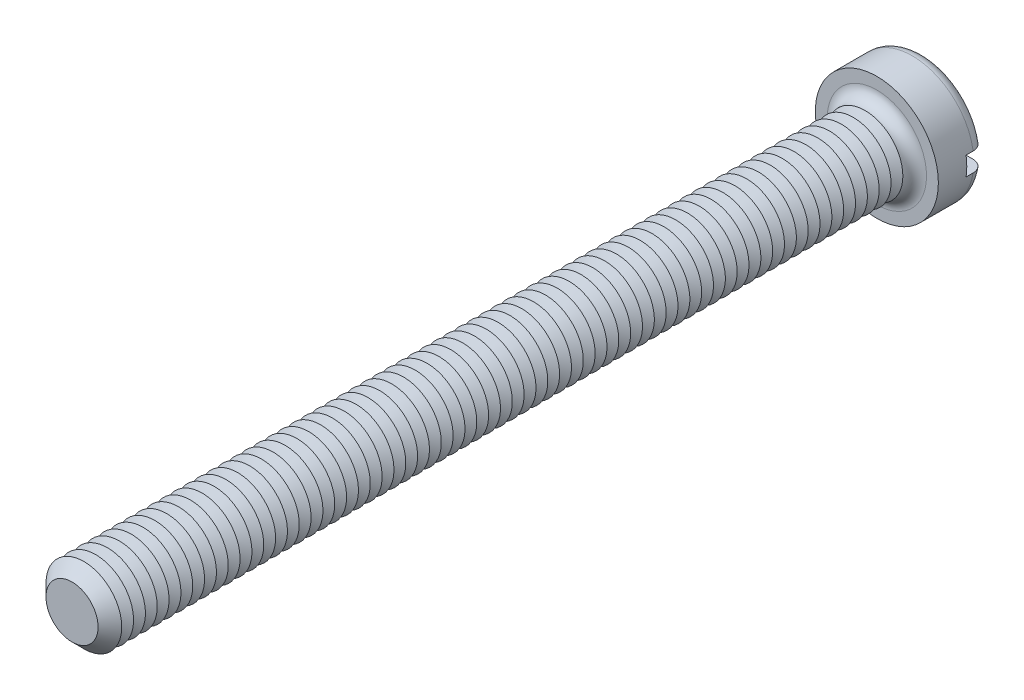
ISO-10303-21;
HEADER;
FILE_DESCRIPTION(('STEP AP214'),'2;1');
FILE_NAME('part.step','',(''),(''),'','','');
FILE_SCHEMA(('AUTOMOTIVE_DESIGN { 1 0 10303 214 1 1 1 1 }'));
ENDSEC;
DATA;
#1=APPLICATION_CONTEXT('core data for automotive mechanical design processes');
#2=APPLICATION_PROTOCOL_DEFINITION('international standard','automotive_design',2000,#1);
#3=PRODUCT_CONTEXT('',#1,'mechanical');
#4=PRODUCT('Part','Part','',(#3));
#5=PRODUCT_RELATED_PRODUCT_CATEGORY('part','',(#4));
#6=PRODUCT_DEFINITION_FORMATION('','',#4);
#7=PRODUCT_DEFINITION_CONTEXT('part definition',#1,'design');
#8=PRODUCT_DEFINITION('design','',#6,#7);
#9=PRODUCT_DEFINITION_SHAPE('','',#8);
#10=(LENGTH_UNIT() NAMED_UNIT(*) SI_UNIT(.MILLI.,.METRE.));
#11=(NAMED_UNIT(*) PLANE_ANGLE_UNIT() SI_UNIT($,.RADIAN.));
#12=(NAMED_UNIT(*) SI_UNIT($,.STERADIAN.) SOLID_ANGLE_UNIT());
#13=UNCERTAINTY_MEASURE_WITH_UNIT(LENGTH_MEASURE(1.E-05),#10,'distance_accuracy_value','');
#14=(GEOMETRIC_REPRESENTATION_CONTEXT(3) GLOBAL_UNCERTAINTY_ASSIGNED_CONTEXT((#13)) GLOBAL_UNIT_ASSIGNED_CONTEXT((#10,
#11,#12)) REPRESENTATION_CONTEXT('',''));
#15=CARTESIAN_POINT('',(0.,0.,0.));
#16=DIRECTION('',(0.,0.,1.));
#17=DIRECTION('',(1.,0.,0.));
#18=AXIS2_PLACEMENT_3D('',#15,#16,#17);
#19=CARTESIAN_POINT('',(0.,0.,-5.));
#20=DIRECTION('',(0.,0.,1.));
#21=DIRECTION('',(1.,0.,0.));
#22=AXIS2_PLACEMENT_3D('',#19,#20,#21);
#23=PLANE('',#22);
#24=CARTESIAN_POINT('',(0.,0.,-5.));
#25=DIRECTION('',(0.,0.,1.));
#26=DIRECTION('',(1.,0.,0.));
#27=AXIS2_PLACEMENT_3D('',#24,#25,#26);
#28=CIRCLE('',#27,5.25);
#29=CARTESIAN_POINT('',(-5.15388203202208,1.,-5.));
#30=VERTEX_POINT('',#29);
#31=CARTESIAN_POINT('',(5.15388203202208,1.,-5.));
#32=VERTEX_POINT('',#31);
#33=EDGE_CURVE('E116',#30,#32,#28,.F.);
#34=ORIENTED_EDGE('',*,*,#33,.T.);
#35=DIRECTION('',(1.,0.,0.));
#36=VECTOR('',#35,1.);
#37=CARTESIAN_POINT('',(-6.5,1.,-5.));
#38=LINE('',#37,#36);
#39=EDGE_CURVE('E111',#30,#32,#38,.T.);
#40=ORIENTED_EDGE('',*,*,#39,.F.);
#41=EDGE_LOOP('',(#34,#40));
#42=FACE_BOUND('',#41,.T.);
#43=ADVANCED_FACE('F39',(#42),#23,.F.);
#44=CARTESIAN_POINT('',(0.,0.,-3.75));
#45=DIRECTION('',(0.,0.,1.));
#46=DIRECTION('',(1.,0.,0.));
#47=AXIS2_PLACEMENT_3D('',#44,#45,#46);
#48=TOROIDAL_SURFACE('',#47,5.25,1.25);
#49=CARTESIAN_POINT('',(-6.04655789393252,1.,-4.63904490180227));
#50=CARTESIAN_POINT('',(-5.99546860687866,1.,-4.68885774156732));
#51=CARTESIAN_POINT('',(-5.94008472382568,1.,-4.73434760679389));
#52=CARTESIAN_POINT('',(-5.8223927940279,1.,-4.81538052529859));
#53=CARTESIAN_POINT('',(-5.7600753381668,1.,-4.85090982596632));
#54=CARTESIAN_POINT('',(-5.63044351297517,1.,-4.91100606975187));
#55=CARTESIAN_POINT('',(-5.56313479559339,1.,-4.93558519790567));
#56=CARTESIAN_POINT('',(-5.42539577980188,1.,-4.97322457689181));
#57=CARTESIAN_POINT('',(-5.35496625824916,1.,-4.98628767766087));
#58=CARTESIAN_POINT('',(-5.21212635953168,1.,-5.00070478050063));
#59=CARTESIAN_POINT('',(-5.13970265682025,1.,-5.00192674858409));
#60=CARTESIAN_POINT('',(-4.99565121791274,1.,-4.99234085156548));
#61=CARTESIAN_POINT('',(-4.92402357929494,1.,-4.98153152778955));
#62=CARTESIAN_POINT('',(-4.78274786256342,1.,-4.94801424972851));
#63=CARTESIAN_POINT('',(-4.71313137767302,1.,-4.92517296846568));
#64=CARTESIAN_POINT('',(-4.57871041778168,1.,-4.86813760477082));
#65=CARTESIAN_POINT('',(-4.51390612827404,1.,-4.83394308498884));
#66=CARTESIAN_POINT('',(-4.39095493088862,1.,-4.75508341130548));
#67=CARTESIAN_POINT('',(-4.33281197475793,1.,-4.7104120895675));
#68=CARTESIAN_POINT('',(-4.22499800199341,1.,-4.61179869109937));
#69=CARTESIAN_POINT('',(-4.17532640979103,1.,-4.55785724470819));
#70=CARTESIAN_POINT('',(-4.08677450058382,1.,-4.4431082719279));
#71=CARTESIAN_POINT('',(-4.0477350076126,1.,-4.38242369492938));
#72=CARTESIAN_POINT('',(-3.98074296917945,1.,-4.25521412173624));
#73=CARTESIAN_POINT('',(-3.95278836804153,1.,-4.18869021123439));
#74=CARTESIAN_POINT('',(-3.90959497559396,1.,-4.0537026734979));
#75=CARTESIAN_POINT('',(-3.89401985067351,1.,-3.98534663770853));
#76=CARTESIAN_POINT('',(-3.8748586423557,1.,-3.84697740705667));
#77=CARTESIAN_POINT('',(-3.87127067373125,1.,-3.7769644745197));
#78=CARTESIAN_POINT('',(-3.8761573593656,1.,-3.63892215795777));
#79=CARTESIAN_POINT('',(-3.88436651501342,1.,-3.57088319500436));
#80=CARTESIAN_POINT('',(-3.91207743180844,1.,-3.43714958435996));
#81=CARTESIAN_POINT('',(-3.93157911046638,1.,-3.37145491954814));
#82=CARTESIAN_POINT('',(-3.98125045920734,1.,-3.24411474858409));
#83=CARTESIAN_POINT('',(-4.01143761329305,1.,-3.18247607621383));
#84=CARTESIAN_POINT('',(-4.08150210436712,1.,-3.064981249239));
#85=CARTESIAN_POINT('',(-4.12138048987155,1.,-3.0091257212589));
#86=CARTESIAN_POINT('',(-4.2106718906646,1.,-2.90336353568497));
#87=CARTESIAN_POINT('',(-4.26028693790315,1.,-2.85362751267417));
#88=CARTESIAN_POINT('',(-4.36696587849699,1.,-2.76291710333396));
#89=CARTESIAN_POINT('',(-4.42403082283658,1.,-2.72194395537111));
#90=CARTESIAN_POINT('',(-4.54567957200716,1.,-2.64877280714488));
#91=CARTESIAN_POINT('',(-4.61042643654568,1.,-2.61684571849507));
#92=CARTESIAN_POINT('',(-4.74430563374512,1.,-2.56412359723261));
#93=CARTESIAN_POINT('',(-4.81343838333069,1.,-2.54332962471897));
#94=CARTESIAN_POINT('',(-4.95527237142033,1.,-2.51320471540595));
#95=CARTESIAN_POINT('',(-5.0280120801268,1.,-2.50405449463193));
#96=CARTESIAN_POINT('',(-5.17399775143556,1.,-2.49810126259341));
#97=CARTESIAN_POINT('',(-5.24724372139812,1.,-2.50129843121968));
#98=CARTESIAN_POINT('',(-5.3921014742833,1.,-2.52000776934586));
#99=CARTESIAN_POINT('',(-5.4637142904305,1.,-2.53551191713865));
#100=CARTESIAN_POINT('',(-5.60326680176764,1.,-2.57846304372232));
#101=CARTESIAN_POINT('',(-5.67120668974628,1.,-2.60590939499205));
#102=CARTESIAN_POINT('',(-5.80064060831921,1.,-2.67164926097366));
#103=CARTESIAN_POINT('',(-5.862199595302,1.,-2.7098148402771));
#104=CARTESIAN_POINT('',(-5.9779079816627,1.,-2.79608690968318));
#105=CARTESIAN_POINT('',(-6.03205795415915,1.,-2.84419263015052));
#106=CARTESIAN_POINT('',(-6.13055119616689,1.,-2.94820522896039));
#107=CARTESIAN_POINT('',(-6.17502887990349,1.,-3.00398483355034));
#108=CARTESIAN_POINT('',(-6.25384180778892,1.,-3.12230113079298));
#109=CARTESIAN_POINT('',(-6.28817779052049,1.,-3.18483733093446));
#110=CARTESIAN_POINT('',(-6.34527986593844,1.,-3.31401726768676));
#111=CARTESIAN_POINT('',(-6.36818984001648,1.,-3.38059742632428));
#112=CARTESIAN_POINT('',(-6.40240470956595,1.,-3.5166725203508));
#113=CARTESIAN_POINT('',(-6.41371067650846,1.,-3.58616718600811));
#114=CARTESIAN_POINT('',(-6.42433240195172,1.,-3.72550026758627));
#115=CARTESIAN_POINT('',(-6.4237441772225,1.,-3.79533138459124));
#116=CARTESIAN_POINT('',(-6.41082814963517,1.,-3.93391789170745));
#117=CARTESIAN_POINT('',(-6.39849757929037,1.,-4.00267302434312));
#118=CARTESIAN_POINT('',(-6.36249191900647,1.,-4.13704597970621));
#119=CARTESIAN_POINT('',(-6.33883072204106,1.,-4.20266753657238));
#120=CARTESIAN_POINT('',(-6.28088769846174,1.,-4.32897165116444));
#121=CARTESIAN_POINT('',(-6.24661890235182,1.,-4.38966015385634));
#122=CARTESIAN_POINT('',(-6.18404039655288,1.,-4.48163773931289));
#123=CARTESIAN_POINT('',(-6.15876600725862,1.,-4.51503333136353));
#124=CARTESIAN_POINT('',(-6.10500607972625,1.,-4.5791298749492));
#125=CARTESIAN_POINT('',(-6.07652056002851,1.,-4.60983084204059));
#126=CARTESIAN_POINT('',(-6.04655789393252,1.,-4.63904490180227));
#127=B_SPLINE_CURVE_WITH_KNOTS('',3,(#49,#50,#51,#52,#53,#54,#55,#56,#57,#58,#59,#60,#61,#62,
#63,#64,#65,#66,#67,#68,#69,#70,#71,#72,#73,#74,#75,#76,#77,#78,#79,#80,#81,#82,#83,#84,#85,#86,
#87,#88,#89,#90,#91,#92,#93,#94,#95,#96,#97,#98,#99,#100,#101,#102,#103,#104,#105,#106,#107,
#108,#109,#110,#111,#112,#113,#114,#115,#116,#117,#118,#119,#120,#121,#122,#123,#124,#125,#126),
.UNSPECIFIED.,.T.,.F.,(4,2,2,2,2,2,2,2,2,2,2,2,2,2,2,2,2,2,2,2,2,2,2,2,2,2,2,2,2,2,2,2,2,2,2,2,
2,2,4),(0.,0.213907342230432,0.428108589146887,0.642070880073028,0.855980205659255,
1.07227200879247,1.28859003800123,1.50735715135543,1.72613269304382,1.94503735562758,
2.16392713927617,2.37933295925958,2.59469881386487,2.80399176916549,3.01325180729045,
3.2178754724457,3.42249764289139,3.62745618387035,3.83243690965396,4.04223444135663,
4.25206160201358,4.46763253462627,4.68322399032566,4.90212226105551,5.12102372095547,
5.33978261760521,5.55853002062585,5.77477015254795,5.99099354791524,6.20398686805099,
6.41696467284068,6.62718821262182,6.83739233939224,7.0459002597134,7.25445733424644,
7.46275934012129,7.67080647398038,7.79625882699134,7.92171045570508),.UNSPECIFIED.);
#128=CARTESIAN_POINT('',(-6.42261628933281,1.,-3.74999999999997));
#129=VERTEX_POINT('',#128);
#130=EDGE_CURVE('E707',#129,#30,#127,.T.);
#131=ORIENTED_EDGE('',*,*,#130,.F.);
#132=CARTESIAN_POINT('',(0.,0.,-3.75));
#133=DIRECTION('',(0.,0.,1.));
#134=DIRECTION('',(1.,0.,0.));
#135=AXIS2_PLACEMENT_3D('',#132,#133,#134);
#136=CIRCLE('',#135,6.5);
#137=CARTESIAN_POINT('',(6.42261628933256,1.,-3.75));
#138=VERTEX_POINT('',#137);
#139=EDGE_CURVE('E125',#138,#129,#136,.T.);
#140=ORIENTED_EDGE('',*,*,#139,.F.);
#141=CARTESIAN_POINT('',(4.06944999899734,1.,-4.4133199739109));
#142=CARTESIAN_POINT('',(4.10828271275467,1.,-4.47354709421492));
#143=CARTESIAN_POINT('',(4.15233880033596,1.,-4.53047894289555));
#144=CARTESIAN_POINT('',(4.24946916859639,1.,-4.63614530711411));
#145=CARTESIAN_POINT('',(4.3025574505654,1.,-4.68486685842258));
#146=CARTESIAN_POINT('',(4.41603250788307,1.,-4.77271114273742));
#147=CARTESIAN_POINT('',(4.47640839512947,1.,-4.8118479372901));
#148=CARTESIAN_POINT('',(4.60277035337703,1.,-4.87959878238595));
#149=CARTESIAN_POINT('',(4.66875480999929,1.,-4.90821584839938));
#150=CARTESIAN_POINT('',(4.80558589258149,1.,-4.95456537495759));
#151=CARTESIAN_POINT('',(4.87649196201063,1.,-4.97212253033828));
#152=CARTESIAN_POINT('',(5.02024710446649,1.,-4.99514979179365));
#153=CARTESIAN_POINT('',(5.09309636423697,1.,-5.00061873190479));
#154=CARTESIAN_POINT('',(5.23902872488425,1.,-4.99926689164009));
#155=CARTESIAN_POINT('',(5.31211131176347,1.,-4.99238812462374));
#156=CARTESIAN_POINT('',(5.45605806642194,1.,-4.96635140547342));
#157=CARTESIAN_POINT('',(5.52692231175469,1.,-4.94719388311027));
#158=CARTESIAN_POINT('',(5.66376170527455,1.,-4.89728421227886));
#159=CARTESIAN_POINT('',(5.72977335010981,1.,-4.86663219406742));
#160=CARTESIAN_POINT('',(5.85560715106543,1.,-4.79452334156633));
#161=CARTESIAN_POINT('',(5.91542977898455,1.,-4.7530673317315));
#162=CARTESIAN_POINT('',(6.02626022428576,1.,-4.66116821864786));
#163=CARTESIAN_POINT('',(6.07738307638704,1.,-4.6108638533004));
#164=CARTESIAN_POINT('',(6.17030947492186,1.,-4.50227823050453));
#165=CARTESIAN_POINT('',(6.2121137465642,1.,-4.44399759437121));
#166=CARTESIAN_POINT('',(6.28460268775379,1.,-4.32200305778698));
#167=CARTESIAN_POINT('',(6.31543589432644,1.,-4.2583773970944));
#168=CARTESIAN_POINT('',(6.36586009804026,1.,-4.12681721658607));
#169=CARTESIAN_POINT('',(6.38545178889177,1.,-4.0588829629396));
#170=CARTESIAN_POINT('',(6.41265760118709,1.,-3.92136007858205));
#171=CARTESIAN_POINT('',(6.42038873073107,1.,-3.85179457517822));
#172=CARTESIAN_POINT('',(6.42401070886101,1.,-3.7123569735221));
#173=CARTESIAN_POINT('',(6.41990193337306,1.,-3.64248488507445));
#174=CARTESIAN_POINT('',(6.40000894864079,1.,-3.50470871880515));
#175=CARTESIAN_POINT('',(6.38427119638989,1.,-3.43679792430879));
#176=CARTESIAN_POINT('',(6.34164491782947,1.,-3.30457296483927));
#177=CARTESIAN_POINT('',(6.31475638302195,1.,-3.24025880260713));
#178=CARTESIAN_POINT('',(6.2505455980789,1.,-3.11686791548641));
#179=CARTESIAN_POINT('',(6.21319759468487,1.,-3.05780459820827));
#180=CARTESIAN_POINT('',(6.12919411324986,1.,-2.94671919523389));
#181=CARTESIAN_POINT('',(6.08253833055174,1.,-2.89469734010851));
#182=CARTESIAN_POINT('',(5.98083387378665,1.,-2.79868150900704));
#183=CARTESIAN_POINT('',(5.92571704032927,1.,-2.75475975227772));
#184=CARTESIAN_POINT('',(5.80897194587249,1.,-2.67665277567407));
#185=CARTESIAN_POINT('',(5.74734329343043,1.,-2.64246814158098));
#186=CARTESIAN_POINT('',(5.6184644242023,1.,-2.58431810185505));
#187=CARTESIAN_POINT('',(5.55115102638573,1.,-2.56049275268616));
#188=CARTESIAN_POINT('',(5.41351272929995,1.,-2.52429868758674));
#189=CARTESIAN_POINT('',(5.34318759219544,1.,-2.51193087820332));
#190=CARTESIAN_POINT('',(5.20041507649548,1.,-2.49882112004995));
#191=CARTESIAN_POINT('',(5.12795169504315,1.,-2.49825332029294));
#192=CARTESIAN_POINT('',(4.98393373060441,1.,-2.50914771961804));
#193=CARTESIAN_POINT('',(4.91237921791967,1.,-2.52061084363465));
#194=CARTESIAN_POINT('',(4.77137358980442,1.,-2.55542281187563));
#195=CARTESIAN_POINT('',(4.70195472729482,1.,-2.57890245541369));
#196=CARTESIAN_POINT('',(4.56803538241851,1.,-2.63717701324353));
#197=CARTESIAN_POINT('',(4.50353509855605,1.,-2.67197238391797));
#198=CARTESIAN_POINT('',(4.38131858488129,1.,-2.7519648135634));
#199=CARTESIAN_POINT('',(4.32360365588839,1.,-2.79716386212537));
#200=CARTESIAN_POINT('',(4.21673400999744,1.,-2.89675634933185));
#201=CARTESIAN_POINT('',(4.16757871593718,1.,-2.95114916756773));
#202=CARTESIAN_POINT('',(4.08014713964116,1.,-3.06667703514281));
#203=CARTESIAN_POINT('',(4.04170608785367,1.,-3.12768727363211));
#204=CARTESIAN_POINT('',(3.97596192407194,1.,-3.25543782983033));
#205=CARTESIAN_POINT('',(3.94865624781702,1.,-3.32217682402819));
#206=CARTESIAN_POINT('',(3.9067737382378,1.,-3.45745603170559));
#207=CARTESIAN_POINT('',(3.89185707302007,1.,-3.52589108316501));
#208=CARTESIAN_POINT('',(3.87400755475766,1.,-3.66432360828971));
#209=CARTESIAN_POINT('',(3.87107601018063,1.,-3.73432125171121));
#210=CARTESIAN_POINT('',(3.8772387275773,1.,-3.87228267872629));
#211=CARTESIAN_POINT('',(3.88607933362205,1.,-3.94025811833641));
#212=CARTESIAN_POINT('',(3.91502769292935,1.,-4.07370133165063));
#213=CARTESIAN_POINT('',(3.93512131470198,1.,-4.1391721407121));
#214=CARTESIAN_POINT('',(3.9752037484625,1.,-4.23926719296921));
#215=CARTESIAN_POINT('',(3.99171171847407,1.,-4.27532618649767));
#216=CARTESIAN_POINT('',(4.02809737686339,1.,-4.34569933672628));
#217=CARTESIAN_POINT('',(4.04797497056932,1.,-4.3800135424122));
#218=CARTESIAN_POINT('',(4.06944999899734,1.,-4.4133199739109));
#219=B_SPLINE_CURVE_WITH_KNOTS('',3,(#141,#142,#143,#144,#145,#146,#147,#148,#149,#150,#151,
#152,#153,#154,#155,#156,#157,#158,#159,#160,#161,#162,#163,#164,#165,#166,#167,#168,#169,#170,
#171,#172,#173,#174,#175,#176,#177,#178,#179,#180,#181,#182,#183,#184,#185,#186,#187,#188,#189,
#190,#191,#192,#193,#194,#195,#196,#197,#198,#199,#200,#201,#202,#203,#204,#205,#206,#207,#208,
#209,#210,#211,#212,#213,#214,#215,#216,#217,#218),.UNSPECIFIED.,.T.,.F.,(4,2,2,2,2,2,2,2,2,2,2,
2,2,2,2,2,2,2,2,2,2,2,2,2,2,2,2,2,2,2,2,2,2,2,2,2,2,2,4),(0.,0.214833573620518,
0.430003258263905,0.644855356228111,0.859645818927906,1.0777603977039,1.29589601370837,
1.51505870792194,1.73421373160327,1.95150241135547,2.16877451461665,2.38290237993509,
2.59701357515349,2.8081044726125,3.01918234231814,3.22816416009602,3.43713934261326,
3.64528416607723,3.85342914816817,4.06209119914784,4.27076008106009,4.48120788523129,
4.69166834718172,4.90489186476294,5.11813225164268,5.33451752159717,5.55091942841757,
5.76972860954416,5.98854661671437,6.20740650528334,6.42625163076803,6.64151774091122,
6.85673425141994,7.0658317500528,7.27495207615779,7.47963858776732,7.68406862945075,
7.80287790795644,7.92168384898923),.UNSPECIFIED.);
#220=EDGE_CURVE('E709',#32,#138,#219,.T.);
#221=ORIENTED_EDGE('',*,*,#220,.F.);
#222=ORIENTED_EDGE('',*,*,#33,.F.);
#223=EDGE_LOOP('',(#131,#140,#221,#222));
#224=FACE_BOUND('',#223,.T.);
#225=ADVANCED_FACE('F691',(#224),#48,.T.);
#226=CARTESIAN_POINT('',(0.,0.,-5.));
#227=DIRECTION('',(0.,0.,1.));
#228=DIRECTION('',(1.,0.,0.));
#229=AXIS2_PLACEMENT_3D('',#226,#227,#228);
#230=CYLINDRICAL_SURFACE('',#229,6.5);
#231=DIRECTION('',(0.,0.,1.));
#232=VECTOR('',#231,1.);
#233=CARTESIAN_POINT('',(6.42261628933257,1.,-5.));
#234=LINE('',#233,#232);
#235=CARTESIAN_POINT('',(6.42261628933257,1.,-3.));
#236=VERTEX_POINT('',#235);
#237=EDGE_CURVE('E724',#138,#236,#234,.T.);
#238=ORIENTED_EDGE('',*,*,#237,.F.);
#239=ORIENTED_EDGE('',*,*,#139,.T.);
#240=DIRECTION('',(0.,0.,1.));
#241=VECTOR('',#240,1.);
#242=CARTESIAN_POINT('',(-6.42261628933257,1.,-5.));
#243=LINE('',#242,#241);
#244=CARTESIAN_POINT('',(-6.42261628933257,1.,-3.));
#245=VERTEX_POINT('',#244);
#246=EDGE_CURVE('E63',#245,#129,#243,.F.);
#247=ORIENTED_EDGE('',*,*,#246,.F.);
#248=CARTESIAN_POINT('',(0.,0.,-3.));
#249=DIRECTION('',(0.,0.,-1.));
#250=DIRECTION('',(-1.,0.,0.));
#251=AXIS2_PLACEMENT_3D('',#248,#249,#250);
#252=CIRCLE('',#251,6.5);
#253=CARTESIAN_POINT('',(-6.42261628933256,-0.999999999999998,-3.));
#254=VERTEX_POINT('',#253);
#255=EDGE_CURVE('E43',#245,#254,#252,.F.);
#256=ORIENTED_EDGE('',*,*,#255,.T.);
#257=DIRECTION('',(0.,0.,1.));
#258=VECTOR('',#257,1.);
#259=CARTESIAN_POINT('',(-6.42261628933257,-0.999999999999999,-5.));
#260=LINE('',#259,#258);
#261=CARTESIAN_POINT('',(-6.42261628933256,-0.999999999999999,-3.75));
#262=VERTEX_POINT('',#261);
#263=EDGE_CURVE('E721',#262,#254,#260,.T.);
#264=ORIENTED_EDGE('',*,*,#263,.F.);
#265=CARTESIAN_POINT('',(6.42261628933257,-1.,-3.75));
#266=VERTEX_POINT('',#265);
#267=EDGE_CURVE('E127',#262,#266,#136,.T.);
#268=ORIENTED_EDGE('',*,*,#267,.T.);
#269=DIRECTION('',(0.,0.,1.));
#270=VECTOR('',#269,1.);
#271=CARTESIAN_POINT('',(6.42261628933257,-1.,-5.));
#272=LINE('',#271,#270);
#273=CARTESIAN_POINT('',(6.42261628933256,-1.,-3.));
#274=VERTEX_POINT('',#273);
#275=EDGE_CURVE('E55',#274,#266,#272,.F.);
#276=ORIENTED_EDGE('',*,*,#275,.F.);
#277=EDGE_CURVE('E11',#274,#236,#252,.F.);
#278=ORIENTED_EDGE('',*,*,#277,.T.);
#279=EDGE_LOOP('',(#238,#239,#247,#256,#264,#268,#276,#278));
#280=FACE_BOUND('',#279,.T.);
#281=CARTESIAN_POINT('',(0.,0.,0.));
#282=DIRECTION('',(0.,0.,1.));
#283=DIRECTION('',(1.,0.,0.));
#284=AXIS2_PLACEMENT_3D('',#281,#282,#283);
#285=CIRCLE('',#284,6.5);
#286=CARTESIAN_POINT('',(6.5,0.,0.));
#287=VERTEX_POINT('',#286);
#288=EDGE_CURVE('E727',#287,#287,#285,.T.);
#289=ORIENTED_EDGE('',*,*,#288,.F.);
#290=EDGE_LOOP('',(#289));
#291=FACE_BOUND('',#290,.T.);
#292=ADVANCED_FACE('F687',(#280,#291),#230,.T.);
#293=CARTESIAN_POINT('',(5.15388203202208,-1.,-5.));
#294=VERTEX_POINT('',#293);
#295=CARTESIAN_POINT('',(-5.15388203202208,-0.999999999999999,-5.));
#296=VERTEX_POINT('',#295);
#297=EDGE_CURVE('E109',#294,#296,#28,.F.);
#298=ORIENTED_EDGE('',*,*,#297,.T.);
#299=DIRECTION('',(-1.,0.,0.));
#300=VECTOR('',#299,1.);
#301=CARTESIAN_POINT('',(-6.5,-0.999999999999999,-5.));
#302=LINE('',#301,#300);
#303=EDGE_CURVE('E96',#294,#296,#302,.T.);
#304=ORIENTED_EDGE('',*,*,#303,.F.);
#305=EDGE_LOOP('',(#298,#304));
#306=FACE_BOUND('',#305,.T.);
#307=ADVANCED_FACE('F108',(#306),#23,.F.);
#308=CARTESIAN_POINT('',(0.,0.,0.));
#309=DIRECTION('',(0.,0.,1.));
#310=DIRECTION('',(1.,0.,0.));
#311=AXIS2_PLACEMENT_3D('',#308,#309,#310);
#312=PLANE('',#311);
#313=CARTESIAN_POINT('',(0.,0.,0.));
#314=DIRECTION('',(0.,0.,1.));
#315=DIRECTION('',(1.,0.,0.));
#316=AXIS2_PLACEMENT_3D('',#313,#314,#315);
#317=CIRCLE('',#316,5.25);
#318=CARTESIAN_POINT('',(5.25,0.,0.));
#319=VERTEX_POINT('',#318);
#320=EDGE_CURVE('E115',#319,#319,#317,.F.);
#321=ORIENTED_EDGE('',*,*,#320,.T.);
#322=EDGE_LOOP('',(#321));
#323=FACE_BOUND('',#322,.T.);
#324=ORIENTED_EDGE('',*,*,#288,.T.);
#325=EDGE_LOOP('',(#324));
#326=FACE_BOUND('',#325,.T.);
#327=ADVANCED_FACE('F686',(#323,#326),#312,.T.);
#328=CARTESIAN_POINT('',(-6.04655789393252,-0.999999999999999,-4.63904490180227));
#329=CARTESIAN_POINT('',(-6.0966604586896,-0.999999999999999,-4.59018532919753));
#330=CARTESIAN_POINT('',(-6.14270501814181,-0.999999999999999,-4.53709744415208));
#331=CARTESIAN_POINT('',(-6.22528519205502,-0.999999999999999,-4.42391631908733));
#332=CARTESIAN_POINT('',(-6.26181074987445,-0.999999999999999,-4.36381576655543));
#333=CARTESIAN_POINT('',(-6.32422109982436,-0.999999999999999,-4.23831836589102));
#334=CARTESIAN_POINT('',(-6.35010658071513,-0.999999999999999,-4.17292186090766));
#335=CARTESIAN_POINT('',(-6.39044668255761,-0.999999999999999,-4.03870925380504));
#336=CARTESIAN_POINT('',(-6.40490396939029,-0.999999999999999,-3.96989395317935));
#337=CARTESIAN_POINT('',(-6.42190814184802,-0.999999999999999,-3.83122595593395));
#338=CARTESIAN_POINT('',(-6.4245257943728,-0.999999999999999,-3.76138193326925));
#339=CARTESIAN_POINT('',(-6.41796432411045,-0.999999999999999,-3.62224935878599));
#340=CARTESIAN_POINT('',(-6.40878509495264,-0.999999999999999,-3.55296081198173));
#341=CARTESIAN_POINT('',(-6.37894560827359,-0.999999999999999,-3.41709241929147));
#342=CARTESIAN_POINT('',(-6.35831520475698,-0.999999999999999,-3.35050601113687));
#343=CARTESIAN_POINT('',(-6.30620980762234,-0.999999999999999,-3.22172312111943));
#344=CARTESIAN_POINT('',(-6.2747347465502,-0.999999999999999,-3.15952666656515));
#345=CARTESIAN_POINT('',(-6.20172710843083,-0.999999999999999,-3.04101762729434));
#346=CARTESIAN_POINT('',(-6.16015622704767,-0.999999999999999,-2.98472864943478));
#347=CARTESIAN_POINT('',(-6.06823774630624,-0.999999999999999,-2.87984578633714));
#348=CARTESIAN_POINT('',(-6.01788981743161,-0.999999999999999,-2.83125219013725));
#349=CARTESIAN_POINT('',(-5.90933830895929,-0.999999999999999,-2.74262118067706));
#350=CARTESIAN_POINT('',(-5.85106338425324,-0.999999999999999,-2.70267117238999));
#351=CARTESIAN_POINT('',(-5.72870702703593,-0.999999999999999,-2.63296796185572));
#352=CARTESIAN_POINT('',(-5.66462521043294,-0.999999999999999,-2.6032154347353));
#353=CARTESIAN_POINT('',(-5.53153273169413,-0.999999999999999,-2.55430842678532));
#354=CARTESIAN_POINT('',(-5.46246626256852,-0.999999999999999,-2.53530583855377));
#355=CARTESIAN_POINT('',(-5.32214267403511,-0.999999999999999,-2.5089831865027));
#356=CARTESIAN_POINT('',(-5.25088537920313,-0.999999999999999,-2.50166406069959));
#357=CARTESIAN_POINT('',(-5.10710123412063,-0.999999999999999,-2.49882202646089));
#358=CARTESIAN_POINT('',(-5.03457095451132,-0.999999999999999,-2.50347166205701));
#359=CARTESIAN_POINT('',(-4.8912897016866,-0.999999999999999,-2.52476029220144));
#360=CARTESIAN_POINT('',(-4.82053886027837,-0.999999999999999,-2.54140017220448));
#361=CARTESIAN_POINT('',(-4.68213257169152,-0.999999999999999,-2.58641614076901));
#362=CARTESIAN_POINT('',(-4.61451256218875,-0.999999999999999,-2.61490131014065));
#363=CARTESIAN_POINT('',(-4.48502801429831,-0.999999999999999,-2.68285095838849));
#364=CARTESIAN_POINT('',(-4.42316359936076,-0.999999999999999,-2.72231567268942));
#365=CARTESIAN_POINT('',(-4.30720694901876,-0.999999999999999,-2.81103994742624));
#366=CARTESIAN_POINT('',(-4.25309118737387,-0.999999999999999,-2.86026872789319));
#367=CARTESIAN_POINT('',(-4.15409408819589,-0.999999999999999,-2.9672764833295));
#368=CARTESIAN_POINT('',(-4.10921182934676,-0.999999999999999,-3.02505460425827));
#369=CARTESIAN_POINT('',(-4.03096584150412,-0.999999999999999,-3.14632492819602));
#370=CARTESIAN_POINT('',(-3.99739097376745,-0.999999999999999,-3.2096807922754));
#371=CARTESIAN_POINT('',(-3.94171839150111,-0.999999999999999,-3.34124912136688));
#372=CARTESIAN_POINT('',(-3.91961840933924,-0.999999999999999,-3.40946062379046));
#373=CARTESIAN_POINT('',(-3.88816636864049,-0.999999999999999,-3.54669256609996));
#374=CARTESIAN_POINT('',(-3.87846562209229,-0.999999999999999,-3.61563318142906));
#375=CARTESIAN_POINT('',(-3.87100568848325,-0.999999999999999,-3.75415397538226));
#376=CARTESIAN_POINT('',(-3.87324501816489,-0.999999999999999,-3.82373407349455));
#377=CARTESIAN_POINT('',(-3.88943589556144,-0.999999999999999,-3.96027701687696));
#378=CARTESIAN_POINT('',(-3.90318225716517,-0.999999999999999,-4.0272643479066));
#379=CARTESIAN_POINT('',(-3.94163954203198,-0.999999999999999,-4.1580093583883));
#380=CARTESIAN_POINT('',(-3.96635075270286,-0.999999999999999,-4.22176695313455));
#381=CARTESIAN_POINT('',(-4.026160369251,-0.999999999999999,-4.34483320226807));
#382=CARTESIAN_POINT('',(-4.06134035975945,-0.999999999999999,-4.40410214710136));
#383=CARTESIAN_POINT('',(-4.14090865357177,-0.999999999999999,-4.51609417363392));
#384=CARTESIAN_POINT('',(-4.18529811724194,-0.999999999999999,-4.56881642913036));
#385=CARTESIAN_POINT('',(-4.2832649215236,-0.999999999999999,-4.66770177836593));
#386=CARTESIAN_POINT('',(-4.33705327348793,-0.999999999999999,-4.71365579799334));
#387=CARTESIAN_POINT('',(-4.45141776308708,-0.999999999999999,-4.79615385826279));
#388=CARTESIAN_POINT('',(-4.51199483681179,-0.999999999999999,-4.83269659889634));
#389=CARTESIAN_POINT('',(-4.63989216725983,-0.999999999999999,-4.89626962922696));
#390=CARTESIAN_POINT('',(-4.70734508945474,-0.999999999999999,-4.92303326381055));
#391=CARTESIAN_POINT('',(-4.84575497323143,-0.999999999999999,-4.96500199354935));
#392=CARTESIAN_POINT('',(-4.91671207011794,-0.999999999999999,-4.98020664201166));
#393=CARTESIAN_POINT('',(-5.06097761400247,-0.999999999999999,-4.9987306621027));
#394=CARTESIAN_POINT('',(-5.13430353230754,-0.999999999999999,-5.00191441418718));
#395=CARTESIAN_POINT('',(-5.28046546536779,-0.999999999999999,-4.99587686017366));
#396=CARTESIAN_POINT('',(-5.35330135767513,-0.999999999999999,-4.98665256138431));
#397=CARTESIAN_POINT('',(-5.49610354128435,-0.999999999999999,-4.95604184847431));
#398=CARTESIAN_POINT('',(-5.56607890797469,-0.999999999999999,-4.93469772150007));
#399=CARTESIAN_POINT('',(-5.70131538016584,-0.999999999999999,-4.88041956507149));
#400=CARTESIAN_POINT('',(-5.76658233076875,-0.999999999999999,-4.84750021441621));
#401=CARTESIAN_POINT('',(-5.86782577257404,-0.999999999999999,-4.78498748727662));
#402=CARTESIAN_POINT('',(-5.90579749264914,-0.999999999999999,-4.75856648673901));
#403=CARTESIAN_POINT('',(-5.97862186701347,-0.999999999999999,-4.70172646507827));
#404=CARTESIAN_POINT('',(-6.0134745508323,-0.999999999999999,-4.6713074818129));
#405=CARTESIAN_POINT('',(-6.04655789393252,-0.999999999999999,-4.63904490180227));
#406=B_SPLINE_CURVE_WITH_KNOTS('',3,(#328,#329,#330,#331,#332,#333,#334,#335,#336,#337,#338,
#339,#340,#341,#342,#343,#344,#345,#346,#347,#348,#349,#350,#351,#352,#353,#354,#355,#356,#357,
#358,#359,#360,#361,#362,#363,#364,#365,#366,#367,#368,#369,#370,#371,#372,#373,#374,#375,#376,
#377,#378,#379,#380,#381,#382,#383,#384,#385,#386,#387,#388,#389,#390,#391,#392,#393,#394,#395,
#396,#397,#398,#399,#400,#401,#402,#403,#404,#405),.UNSPECIFIED.,.T.,.F.,(4,2,2,2,2,2,2,2,2,2,2,
2,2,2,2,2,2,2,2,2,2,2,2,2,2,2,2,2,2,2,2,2,2,2,2,2,2,2,4),(0.,0.209780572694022,
0.419781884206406,0.629769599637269,0.839708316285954,1.04839053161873,1.2570746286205,
1.46521720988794,1.67336108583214,1.88230736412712,2.09126148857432,2.30223890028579,
2.51323027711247,2.72713284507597,2.94105258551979,3.15807345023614,3.37511034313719,
3.59419176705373,3.81327788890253,4.03168404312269,4.25006839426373,4.46411376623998,
4.67811682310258,4.88595885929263,5.09377507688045,5.29796268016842,5.50215563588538,
5.70798353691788,5.91383738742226,6.12510741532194,6.33640661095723,6.55309998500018,
6.76980173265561,6.98894112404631,7.20813337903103,7.42656551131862,7.64472163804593,
7.78324365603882,7.92176436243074),.UNSPECIFIED.);
#407=EDGE_CURVE('E103',#296,#262,#406,.T.);
#408=ORIENTED_EDGE('',*,*,#407,.F.);
#409=ORIENTED_EDGE('',*,*,#297,.F.);
#410=CARTESIAN_POINT('',(4.06944999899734,-1.,-4.4133199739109));
#411=CARTESIAN_POINT('',(4.03213207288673,-1.,-4.3554312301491));
#412=CARTESIAN_POINT('',(3.9995849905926,-1.,-4.29441722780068));
#413=CARTESIAN_POINT('',(3.94511822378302,-1.,-4.16776604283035));
#414=CARTESIAN_POINT('',(3.92320762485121,-1.,-4.10212496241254));
#415=CARTESIAN_POINT('',(3.89078811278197,-1.,-3.96804412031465));
#416=CARTESIAN_POINT('',(3.88028409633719,-1.,-3.89960316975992));
#417=CARTESIAN_POINT('',(3.87107895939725,-1.,-3.76194650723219));
#418=CARTESIAN_POINT('',(3.87237511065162,-1.,-3.69273097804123));
#419=CARTESIAN_POINT('',(3.88662927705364,-1.,-3.55634460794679));
#420=CARTESIAN_POINT('',(3.89944923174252,-1.,-3.48915926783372));
#421=CARTESIAN_POINT('',(3.93611188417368,-1.,-3.35786953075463));
#422=CARTESIAN_POINT('',(3.95995518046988,-1.,-3.29376530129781));
#423=CARTESIAN_POINT('',(4.0180748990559,-1.,-3.16993562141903));
#424=CARTESIAN_POINT('',(4.05242297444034,-1.,-3.11024385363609));
#425=CARTESIAN_POINT('',(4.13041121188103,-1.,-2.9972793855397));
#426=CARTESIAN_POINT('',(4.17405248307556,-1.,-2.94400745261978));
#427=CARTESIAN_POINT('',(4.27058636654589,-1.,-2.8439150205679));
#428=CARTESIAN_POINT('',(4.32368948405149,-1.,-2.79729757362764));
#429=CARTESIAN_POINT('',(4.43679856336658,-1.,-2.71336600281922));
#430=CARTESIAN_POINT('',(4.49680546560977,-1.,-2.67605314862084));
#431=CARTESIAN_POINT('',(4.62370121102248,-1.,-2.61081752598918));
#432=CARTESIAN_POINT('',(4.69072799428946,-1.,-2.58316284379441));
#433=CARTESIAN_POINT('',(4.82843981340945,-1.,-2.5393441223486));
#434=CARTESIAN_POINT('',(4.899125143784,-1.,-2.52318100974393));
#435=CARTESIAN_POINT('',(5.04306377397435,-1.,-2.50267755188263));
#436=CARTESIAN_POINT('',(5.11633773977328,-1.,-2.49848181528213));
#437=CARTESIAN_POINT('',(5.26254809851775,-1.,-2.50249357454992));
#438=CARTESIAN_POINT('',(5.33548449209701,-1.,-2.51070104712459));
#439=CARTESIAN_POINT('',(5.4786703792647,-1.,-2.53930888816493));
#440=CARTESIAN_POINT('',(5.54892819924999,-1.,-2.5596675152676));
#441=CARTESIAN_POINT('',(5.68495799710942,-1.,-2.61204238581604));
#442=CARTESIAN_POINT('',(5.75073024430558,-1.,-2.64405792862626));
#443=CARTESIAN_POINT('',(5.8750178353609,-1.,-2.7184150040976));
#444=CARTESIAN_POINT('',(5.93361487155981,-1.,-2.76061995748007));
#445=CARTESIAN_POINT('',(6.04275377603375,-1.,-2.85440601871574));
#446=CARTESIAN_POINT('',(6.09329629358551,-1.,-2.90598637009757));
#447=CARTESIAN_POINT('',(6.18409572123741,-1.,-3.01622977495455));
#448=CARTESIAN_POINT('',(6.2244945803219,-1.,-3.07477592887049));
#449=CARTESIAN_POINT('',(6.29474798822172,-1.,-3.19788594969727));
#450=CARTESIAN_POINT('',(6.3246032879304,-1.,-3.26244938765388));
#451=CARTESIAN_POINT('',(6.37256001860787,-1.,-3.39491634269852));
#452=CARTESIAN_POINT('',(6.39079949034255,-1.,-3.46276990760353));
#453=CARTESIAN_POINT('',(6.41554133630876,-1.,-3.60058363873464));
#454=CARTESIAN_POINT('',(6.42204424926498,-1.,-3.67054370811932));
#455=CARTESIAN_POINT('',(6.42311237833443,-1.,-3.81007982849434));
#456=CARTESIAN_POINT('',(6.41775799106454,-1.,-3.879655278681));
#457=CARTESIAN_POINT('',(6.39543799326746,-1.,-4.01691664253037));
#458=CARTESIAN_POINT('',(6.3784725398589,-1.,-4.08460258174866));
#459=CARTESIAN_POINT('',(6.33344768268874,-1.,-4.21614537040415));
#460=CARTESIAN_POINT('',(6.30539273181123,-1.,-4.28000374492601));
#461=CARTESIAN_POINT('',(6.23902076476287,-1.,-4.40214140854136));
#462=CARTESIAN_POINT('',(6.20070356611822,-1.,-4.46042059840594));
#463=CARTESIAN_POINT('',(6.11467174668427,-1.,-4.5701315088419));
#464=CARTESIAN_POINT('',(6.06690270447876,-1.,-4.62152053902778));
#465=CARTESIAN_POINT('',(5.96350111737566,-1.,-4.715657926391));
#466=CARTESIAN_POINT('',(5.90786817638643,-1.,-4.75840584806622));
#467=CARTESIAN_POINT('',(5.78965380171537,-1.,-4.8345781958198));
#468=CARTESIAN_POINT('',(5.72700078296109,-1.,-4.86789149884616));
#469=CARTESIAN_POINT('',(5.59704977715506,-1.,-4.92369754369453));
#470=CARTESIAN_POINT('',(5.52975144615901,-1.,-4.94618948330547));
#471=CARTESIAN_POINT('',(5.39137621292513,-1.,-4.98006173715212));
#472=CARTESIAN_POINT('',(5.32025859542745,-1.,-4.99127571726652));
#473=CARTESIAN_POINT('',(5.17715081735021,-1.,-5.00177798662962));
#474=CARTESIAN_POINT('',(5.10516061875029,-1.,-5.00106575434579));
#475=CARTESIAN_POINT('',(4.96131924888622,-1.,-4.98769775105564));
#476=CARTESIAN_POINT('',(4.88948297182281,-1.,-4.97488146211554));
#477=CARTESIAN_POINT('',(4.74893184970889,-1.,-4.93744335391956));
#478=CARTESIAN_POINT('',(4.68021795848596,-1.,-4.91281795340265));
#479=CARTESIAN_POINT('',(4.54744428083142,-1.,-4.8522329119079));
#480=CARTESIAN_POINT('',(4.48341761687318,-1.,-4.81620070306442));
#481=CARTESIAN_POINT('',(4.36244497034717,-1.,-4.73383277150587));
#482=CARTESIAN_POINT('',(4.30549069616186,-1.,-4.68750929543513));
#483=CARTESIAN_POINT('',(4.21823158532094,-1.,-4.60311228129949));
#484=CARTESIAN_POINT('',(4.18544074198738,-1.,-4.56757118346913));
#485=CARTESIAN_POINT('',(4.12413461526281,-1.,-4.49297229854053));
#486=CARTESIAN_POINT('',(4.09561926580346,-1.,-4.45391456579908));
#487=CARTESIAN_POINT('',(4.06944999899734,-1.,-4.4133199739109));
#488=B_SPLINE_CURVE_WITH_KNOTS('',3,(#410,#411,#412,#413,#414,#415,#416,#417,#418,#419,#420,
#421,#422,#423,#424,#425,#426,#427,#428,#429,#430,#431,#432,#433,#434,#435,#436,#437,#438,#439,
#440,#441,#442,#443,#444,#445,#446,#447,#448,#449,#450,#451,#452,#453,#454,#455,#456,#457,#458,
#459,#460,#461,#462,#463,#464,#465,#466,#467,#468,#469,#470,#471,#472,#473,#474,#475,#476,#477,
#478,#479,#480,#481,#482,#483,#484,#485,#486,#487),.UNSPECIFIED.,.T.,.F.,(4,2,2,2,2,2,2,2,2,2,2,
2,2,2,2,2,2,2,2,2,2,2,2,2,2,2,2,2,2,2,2,2,2,2,2,2,2,2,4),(0.,0.206453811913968,0.4130836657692,
0.619802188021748,0.826472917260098,1.03070015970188,1.23493849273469,1.44060223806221,
1.64629054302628,1.85731119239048,2.06836062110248,2.28487349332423,2.5014038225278,
2.72053974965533,2.9396752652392,3.15806230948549,3.37643622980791,3.59203140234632,
3.80760918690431,4.01997696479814,4.23232961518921,4.44210913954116,4.65187903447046,
4.86023097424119,5.06858009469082,5.27684563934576,5.48511488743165,5.69462015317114,
5.90413597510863,6.11602561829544,6.32793096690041,6.54291770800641,6.75791385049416,
6.97580180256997,7.19375587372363,7.41312537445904,7.63223520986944,7.77701357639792,
7.92178970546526),.UNSPECIFIED.);
#489=EDGE_CURVE('E92',#266,#294,#488,.T.);
#490=ORIENTED_EDGE('',*,*,#489,.F.);
#491=ORIENTED_EDGE('',*,*,#267,.F.);
#492=EDGE_LOOP('',(#408,#409,#490,#491));
#493=FACE_BOUND('',#492,.T.);
#494=ADVANCED_FACE('F113',(#493),#48,.T.);
#495=CARTESIAN_POINT('',(0.,0.,1.25));
#496=DIRECTION('',(0.,0.,1.));
#497=DIRECTION('',(1.,0.,0.));
#498=AXIS2_PLACEMENT_3D('',#495,#496,#497);
#499=TOROIDAL_SURFACE('',#498,5.25,1.25);
#500=ORIENTED_EDGE('',*,*,#320,.F.);
#501=EDGE_LOOP('',(#500));
#502=FACE_BOUND('',#501,.T.);
#503=CARTESIAN_POINT('',(0.,0.,1.25));
#504=DIRECTION('',(0.,0.,-1.));
#505=DIRECTION('',(-1.,0.,0.));
#506=AXIS2_PLACEMENT_3D('',#503,#504,#505);
#507=CIRCLE('',#506,4.);
#508=CARTESIAN_POINT('',(-4.,0.,1.25));
#509=VERTEX_POINT('',#508);
#510=EDGE_CURVE('E732',#509,#509,#507,.T.);
#511=ORIENTED_EDGE('',*,*,#510,.T.);
#512=EDGE_LOOP('',(#511));
#513=FACE_BOUND('',#512,.T.);
#514=ADVANCED_FACE('F679',(#502,#513),#499,.F.);
#515=CARTESIAN_POINT('',(0.,0.,1.875));
#516=DIRECTION('',(0.,0.,-1.));
#517=DIRECTION('',(-1.,0.,0.));
#518=AXIS2_PLACEMENT_3D('',#515,#516,#517);
#519=CONICAL_SURFACE('',#518,2.91746824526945,1.0471975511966);
#520=ORIENTED_EDGE('',*,*,#510,.F.);
#521=EDGE_LOOP('',(#520));
#522=FACE_BOUND('',#521,.T.);
#523=CARTESIAN_POINT('',(0.,0.,1.875));
#524=DIRECTION('',(0.,0.,-1.));
#525=DIRECTION('',(-1.,0.,0.));
#526=AXIS2_PLACEMENT_3D('',#523,#524,#525);
#527=CIRCLE('',#526,2.91746824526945);
#528=CARTESIAN_POINT('',(-2.91746824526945,0.,1.875));
#529=VERTEX_POINT('',#528);
#530=EDGE_CURVE('E739',#529,#529,#527,.T.);
#531=ORIENTED_EDGE('',*,*,#530,.T.);
#532=EDGE_LOOP('',(#531));
#533=FACE_BOUND('',#532,.T.);
#534=ADVANCED_FACE('F675',(#522,#533),#519,.T.);
#535=CARTESIAN_POINT('',(0.,0.,2.5));
#536=DIRECTION('',(0.,0.,1.));
#537=DIRECTION('',(1.,0.,0.));
#538=AXIS2_PLACEMENT_3D('',#535,#536,#537);
#539=CONICAL_SURFACE('',#538,4.,1.0471975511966);
#540=ORIENTED_EDGE('',*,*,#530,.F.);
#541=EDGE_LOOP('',(#540));
#542=FACE_BOUND('',#541,.T.);
#543=CARTESIAN_POINT('',(0.,0.,2.5));
#544=DIRECTION('',(0.,0.,-1.));
#545=DIRECTION('',(-1.,0.,0.));
#546=AXIS2_PLACEMENT_3D('',#543,#544,#545);
#547=CIRCLE('',#546,4.);
#548=CARTESIAN_POINT('',(-4.,0.,2.5));
#549=VERTEX_POINT('',#548);
#550=EDGE_CURVE('E745',#549,#549,#547,.T.);
#551=ORIENTED_EDGE('',*,*,#550,.T.);
#552=EDGE_LOOP('',(#551));
#553=FACE_BOUND('',#552,.T.);
#554=ADVANCED_FACE('F671',(#542,#553),#539,.T.);
#555=CARTESIAN_POINT('',(0.,0.,3.125));
#556=DIRECTION('',(0.,0.,-1.));
#557=DIRECTION('',(-1.,0.,0.));
#558=AXIS2_PLACEMENT_3D('',#555,#556,#557);
#559=CONICAL_SURFACE('',#558,2.91746824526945,1.0471975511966);
#560=ORIENTED_EDGE('',*,*,#550,.F.);
#561=EDGE_LOOP('',(#560));
#562=FACE_BOUND('',#561,.T.);
#563=CARTESIAN_POINT('',(0.,0.,3.125));
#564=DIRECTION('',(0.,0.,-1.));
#565=DIRECTION('',(-1.,0.,0.));
#566=AXIS2_PLACEMENT_3D('',#563,#564,#565);
#567=CIRCLE('',#566,2.91746824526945);
#568=CARTESIAN_POINT('',(-2.91746824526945,0.,3.125));
#569=VERTEX_POINT('',#568);
#570=EDGE_CURVE('E749',#569,#569,#567,.T.);
#571=ORIENTED_EDGE('',*,*,#570,.T.);
#572=EDGE_LOOP('',(#571));
#573=FACE_BOUND('',#572,.T.);
#574=ADVANCED_FACE('F667',(#562,#573),#559,.T.);
#575=CARTESIAN_POINT('',(0.,0.,3.75));
#576=DIRECTION('',(0.,0.,1.));
#577=DIRECTION('',(1.,0.,0.));
#578=AXIS2_PLACEMENT_3D('',#575,#576,#577);
#579=CONICAL_SURFACE('',#578,4.,1.0471975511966);
#580=ORIENTED_EDGE('',*,*,#570,.F.);
#581=EDGE_LOOP('',(#580));
#582=FACE_BOUND('',#581,.T.);
#583=CARTESIAN_POINT('',(0.,0.,3.75));
#584=DIRECTION('',(0.,0.,-1.));
#585=DIRECTION('',(-1.,0.,0.));
#586=AXIS2_PLACEMENT_3D('',#583,#584,#585);
#587=CIRCLE('',#586,4.);
#588=CARTESIAN_POINT('',(-4.,0.,3.75));
#589=VERTEX_POINT('',#588);
#590=EDGE_CURVE('E752',#589,#589,#587,.T.);
#591=ORIENTED_EDGE('',*,*,#590,.T.);
#592=EDGE_LOOP('',(#591));
#593=FACE_BOUND('',#592,.T.);
#594=ADVANCED_FACE('F663',(#582,#593),#579,.T.);
#595=CARTESIAN_POINT('',(0.,0.,4.375));
#596=DIRECTION('',(0.,0.,-1.));
#597=DIRECTION('',(-1.,0.,0.));
#598=AXIS2_PLACEMENT_3D('',#595,#596,#597);
#599=CONICAL_SURFACE('',#598,2.91746824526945,1.0471975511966);
#600=ORIENTED_EDGE('',*,*,#590,.F.);
#601=EDGE_LOOP('',(#600));
#602=FACE_BOUND('',#601,.T.);
#603=CARTESIAN_POINT('',(0.,0.,4.375));
#604=DIRECTION('',(0.,0.,-1.));
#605=DIRECTION('',(-1.,0.,0.));
#606=AXIS2_PLACEMENT_3D('',#603,#604,#605);
#607=CIRCLE('',#606,2.91746824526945);
#608=CARTESIAN_POINT('',(-2.91746824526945,0.,4.375));
#609=VERTEX_POINT('',#608);
#610=EDGE_CURVE('E756',#609,#609,#607,.T.);
#611=ORIENTED_EDGE('',*,*,#610,.T.);
#612=EDGE_LOOP('',(#611));
#613=FACE_BOUND('',#612,.T.);
#614=ADVANCED_FACE('F659',(#602,#613),#599,.T.);
#615=CARTESIAN_POINT('',(0.,0.,5.));
#616=DIRECTION('',(0.,0.,1.));
#617=DIRECTION('',(1.,0.,0.));
#618=AXIS2_PLACEMENT_3D('',#615,#616,#617);
#619=CONICAL_SURFACE('',#618,4.,1.0471975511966);
#620=ORIENTED_EDGE('',*,*,#610,.F.);
#621=EDGE_LOOP('',(#620));
#622=FACE_BOUND('',#621,.T.);
#623=CARTESIAN_POINT('',(0.,0.,5.));
#624=DIRECTION('',(0.,0.,-1.));
#625=DIRECTION('',(-1.,0.,0.));
#626=AXIS2_PLACEMENT_3D('',#623,#624,#625);
#627=CIRCLE('',#626,4.);
#628=CARTESIAN_POINT('',(-4.,0.,5.));
#629=VERTEX_POINT('',#628);
#630=EDGE_CURVE('E759',#629,#629,#627,.T.);
#631=ORIENTED_EDGE('',*,*,#630,.T.);
#632=EDGE_LOOP('',(#631));
#633=FACE_BOUND('',#632,.T.);
#634=ADVANCED_FACE('F655',(#622,#633),#619,.T.);
#635=CARTESIAN_POINT('',(0.,0.,5.625));
#636=DIRECTION('',(0.,0.,-1.));
#637=DIRECTION('',(-1.,0.,0.));
#638=AXIS2_PLACEMENT_3D('',#635,#636,#637);
#639=CONICAL_SURFACE('',#638,2.91746824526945,1.0471975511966);
#640=ORIENTED_EDGE('',*,*,#630,.F.);
#641=EDGE_LOOP('',(#640));
#642=FACE_BOUND('',#641,.T.);
#643=CARTESIAN_POINT('',(0.,0.,5.625));
#644=DIRECTION('',(0.,0.,-1.));
#645=DIRECTION('',(-1.,0.,0.));
#646=AXIS2_PLACEMENT_3D('',#643,#644,#645);
#647=CIRCLE('',#646,2.91746824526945);
#648=CARTESIAN_POINT('',(-2.91746824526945,0.,5.625));
#649=VERTEX_POINT('',#648);
#650=EDGE_CURVE('E763',#649,#649,#647,.T.);
#651=ORIENTED_EDGE('',*,*,#650,.T.);
#652=EDGE_LOOP('',(#651));
#653=FACE_BOUND('',#652,.T.);
#654=ADVANCED_FACE('F651',(#642,#653),#639,.T.);
#655=CARTESIAN_POINT('',(0.,0.,6.25));
#656=DIRECTION('',(0.,0.,1.));
#657=DIRECTION('',(1.,0.,0.));
#658=AXIS2_PLACEMENT_3D('',#655,#656,#657);
#659=CONICAL_SURFACE('',#658,4.,1.0471975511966);
#660=ORIENTED_EDGE('',*,*,#650,.F.);
#661=EDGE_LOOP('',(#660));
#662=FACE_BOUND('',#661,.T.);
#663=CARTESIAN_POINT('',(0.,0.,6.25));
#664=DIRECTION('',(0.,0.,-1.));
#665=DIRECTION('',(-1.,0.,0.));
#666=AXIS2_PLACEMENT_3D('',#663,#664,#665);
#667=CIRCLE('',#666,4.);
#668=CARTESIAN_POINT('',(-4.,0.,6.25));
#669=VERTEX_POINT('',#668);
#670=EDGE_CURVE('E766',#669,#669,#667,.T.);
#671=ORIENTED_EDGE('',*,*,#670,.T.);
#672=EDGE_LOOP('',(#671));
#673=FACE_BOUND('',#672,.T.);
#674=ADVANCED_FACE('F647',(#662,#673),#659,.T.);
#675=CARTESIAN_POINT('',(0.,0.,6.875));
#676=DIRECTION('',(0.,0.,-1.));
#677=DIRECTION('',(-1.,0.,0.));
#678=AXIS2_PLACEMENT_3D('',#675,#676,#677);
#679=CONICAL_SURFACE('',#678,2.91746824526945,1.0471975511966);
#680=ORIENTED_EDGE('',*,*,#670,.F.);
#681=EDGE_LOOP('',(#680));
#682=FACE_BOUND('',#681,.T.);
#683=CARTESIAN_POINT('',(0.,0.,6.875));
#684=DIRECTION('',(0.,0.,-1.));
#685=DIRECTION('',(-1.,0.,0.));
#686=AXIS2_PLACEMENT_3D('',#683,#684,#685);
#687=CIRCLE('',#686,2.91746824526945);
#688=CARTESIAN_POINT('',(-2.91746824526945,0.,6.875));
#689=VERTEX_POINT('',#688);
#690=EDGE_CURVE('E770',#689,#689,#687,.T.);
#691=ORIENTED_EDGE('',*,*,#690,.T.);
#692=EDGE_LOOP('',(#691));
#693=FACE_BOUND('',#692,.T.);
#694=ADVANCED_FACE('F643',(#682,#693),#679,.T.);
#695=CARTESIAN_POINT('',(0.,0.,7.5));
#696=DIRECTION('',(0.,0.,1.));
#697=DIRECTION('',(1.,0.,0.));
#698=AXIS2_PLACEMENT_3D('',#695,#696,#697);
#699=CONICAL_SURFACE('',#698,4.,1.0471975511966);
#700=ORIENTED_EDGE('',*,*,#690,.F.);
#701=EDGE_LOOP('',(#700));
#702=FACE_BOUND('',#701,.T.);
#703=CARTESIAN_POINT('',(0.,0.,7.5));
#704=DIRECTION('',(0.,0.,-1.));
#705=DIRECTION('',(-1.,0.,0.));
#706=AXIS2_PLACEMENT_3D('',#703,#704,#705);
#707=CIRCLE('',#706,4.);
#708=CARTESIAN_POINT('',(-4.,0.,7.5));
#709=VERTEX_POINT('',#708);
#710=EDGE_CURVE('E774',#709,#709,#707,.T.);
#711=ORIENTED_EDGE('',*,*,#710,.T.);
#712=EDGE_LOOP('',(#711));
#713=FACE_BOUND('',#712,.T.);
#714=ADVANCED_FACE('F639',(#702,#713),#699,.T.);
#715=CARTESIAN_POINT('',(0.,0.,8.125));
#716=DIRECTION('',(0.,0.,-1.));
#717=DIRECTION('',(-1.,0.,0.));
#718=AXIS2_PLACEMENT_3D('',#715,#716,#717);
#719=CONICAL_SURFACE('',#718,2.91746824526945,1.0471975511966);
#720=ORIENTED_EDGE('',*,*,#710,.F.);
#721=EDGE_LOOP('',(#720));
#722=FACE_BOUND('',#721,.T.);
#723=CARTESIAN_POINT('',(0.,0.,8.125));
#724=DIRECTION('',(0.,0.,-1.));
#725=DIRECTION('',(-1.,0.,0.));
#726=AXIS2_PLACEMENT_3D('',#723,#724,#725);
#727=CIRCLE('',#726,2.91746824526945);
#728=CARTESIAN_POINT('',(-2.91746824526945,0.,8.125));
#729=VERTEX_POINT('',#728);
#730=EDGE_CURVE('E778',#729,#729,#727,.T.);
#731=ORIENTED_EDGE('',*,*,#730,.T.);
#732=EDGE_LOOP('',(#731));
#733=FACE_BOUND('',#732,.T.);
#734=ADVANCED_FACE('F635',(#722,#733),#719,.T.);
#735=CARTESIAN_POINT('',(0.,0.,8.75));
#736=DIRECTION('',(0.,0.,1.));
#737=DIRECTION('',(1.,0.,0.));
#738=AXIS2_PLACEMENT_3D('',#735,#736,#737);
#739=CONICAL_SURFACE('',#738,4.,1.0471975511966);
#740=ORIENTED_EDGE('',*,*,#730,.F.);
#741=EDGE_LOOP('',(#740));
#742=FACE_BOUND('',#741,.T.);
#743=CARTESIAN_POINT('',(0.,0.,8.75));
#744=DIRECTION('',(0.,0.,-1.));
#745=DIRECTION('',(-1.,0.,0.));
#746=AXIS2_PLACEMENT_3D('',#743,#744,#745);
#747=CIRCLE('',#746,4.);
#748=CARTESIAN_POINT('',(-4.,0.,8.75));
#749=VERTEX_POINT('',#748);
#750=EDGE_CURVE('E782',#749,#749,#747,.T.);
#751=ORIENTED_EDGE('',*,*,#750,.T.);
#752=EDGE_LOOP('',(#751));
#753=FACE_BOUND('',#752,.T.);
#754=ADVANCED_FACE('F631',(#742,#753),#739,.T.);
#755=CARTESIAN_POINT('',(0.,0.,9.375));
#756=DIRECTION('',(0.,0.,-1.));
#757=DIRECTION('',(-1.,0.,0.));
#758=AXIS2_PLACEMENT_3D('',#755,#756,#757);
#759=CONICAL_SURFACE('',#758,2.91746824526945,1.0471975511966);
#760=ORIENTED_EDGE('',*,*,#750,.F.);
#761=EDGE_LOOP('',(#760));
#762=FACE_BOUND('',#761,.T.);
#763=CARTESIAN_POINT('',(0.,0.,9.375));
#764=DIRECTION('',(0.,0.,-1.));
#765=DIRECTION('',(-1.,0.,0.));
#766=AXIS2_PLACEMENT_3D('',#763,#764,#765);
#767=CIRCLE('',#766,2.91746824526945);
#768=CARTESIAN_POINT('',(-2.91746824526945,0.,9.375));
#769=VERTEX_POINT('',#768);
#770=EDGE_CURVE('E786',#769,#769,#767,.T.);
#771=ORIENTED_EDGE('',*,*,#770,.T.);
#772=EDGE_LOOP('',(#771));
#773=FACE_BOUND('',#772,.T.);
#774=ADVANCED_FACE('F627',(#762,#773),#759,.T.);
#775=CARTESIAN_POINT('',(0.,0.,10.));
#776=DIRECTION('',(0.,0.,1.));
#777=DIRECTION('',(1.,0.,0.));
#778=AXIS2_PLACEMENT_3D('',#775,#776,#777);
#779=CONICAL_SURFACE('',#778,4.,1.0471975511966);
#780=ORIENTED_EDGE('',*,*,#770,.F.);
#781=EDGE_LOOP('',(#780));
#782=FACE_BOUND('',#781,.T.);
#783=CARTESIAN_POINT('',(0.,0.,10.));
#784=DIRECTION('',(0.,0.,-1.));
#785=DIRECTION('',(-1.,0.,0.));
#786=AXIS2_PLACEMENT_3D('',#783,#784,#785);
#787=CIRCLE('',#786,4.);
#788=CARTESIAN_POINT('',(-4.,0.,10.));
#789=VERTEX_POINT('',#788);
#790=EDGE_CURVE('E790',#789,#789,#787,.T.);
#791=ORIENTED_EDGE('',*,*,#790,.T.);
#792=EDGE_LOOP('',(#791));
#793=FACE_BOUND('',#792,.T.);
#794=ADVANCED_FACE('F623',(#782,#793),#779,.T.);
#795=CARTESIAN_POINT('',(0.,0.,10.625));
#796=DIRECTION('',(0.,0.,-1.));
#797=DIRECTION('',(-1.,0.,0.));
#798=AXIS2_PLACEMENT_3D('',#795,#796,#797);
#799=CONICAL_SURFACE('',#798,2.91746824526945,1.0471975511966);
#800=ORIENTED_EDGE('',*,*,#790,.F.);
#801=EDGE_LOOP('',(#800));
#802=FACE_BOUND('',#801,.T.);
#803=CARTESIAN_POINT('',(0.,0.,10.625));
#804=DIRECTION('',(0.,0.,-1.));
#805=DIRECTION('',(-1.,0.,0.));
#806=AXIS2_PLACEMENT_3D('',#803,#804,#805);
#807=CIRCLE('',#806,2.91746824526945);
#808=CARTESIAN_POINT('',(-2.91746824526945,0.,10.625));
#809=VERTEX_POINT('',#808);
#810=EDGE_CURVE('E794',#809,#809,#807,.T.);
#811=ORIENTED_EDGE('',*,*,#810,.T.);
#812=EDGE_LOOP('',(#811));
#813=FACE_BOUND('',#812,.T.);
#814=ADVANCED_FACE('F619',(#802,#813),#799,.T.);
#815=CARTESIAN_POINT('',(0.,0.,11.25));
#816=DIRECTION('',(0.,0.,1.));
#817=DIRECTION('',(1.,0.,0.));
#818=AXIS2_PLACEMENT_3D('',#815,#816,#817);
#819=CONICAL_SURFACE('',#818,4.,1.0471975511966);
#820=ORIENTED_EDGE('',*,*,#810,.F.);
#821=EDGE_LOOP('',(#820));
#822=FACE_BOUND('',#821,.T.);
#823=CARTESIAN_POINT('',(0.,0.,11.25));
#824=DIRECTION('',(0.,0.,-1.));
#825=DIRECTION('',(-1.,0.,0.));
#826=AXIS2_PLACEMENT_3D('',#823,#824,#825);
#827=CIRCLE('',#826,4.);
#828=CARTESIAN_POINT('',(-4.,0.,11.25));
#829=VERTEX_POINT('',#828);
#830=EDGE_CURVE('E798',#829,#829,#827,.T.);
#831=ORIENTED_EDGE('',*,*,#830,.T.);
#832=EDGE_LOOP('',(#831));
#833=FACE_BOUND('',#832,.T.);
#834=ADVANCED_FACE('F615',(#822,#833),#819,.T.);
#835=CARTESIAN_POINT('',(0.,0.,11.875));
#836=DIRECTION('',(0.,0.,-1.));
#837=DIRECTION('',(-1.,0.,0.));
#838=AXIS2_PLACEMENT_3D('',#835,#836,#837);
#839=CONICAL_SURFACE('',#838,2.91746824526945,1.0471975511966);
#840=ORIENTED_EDGE('',*,*,#830,.F.);
#841=EDGE_LOOP('',(#840));
#842=FACE_BOUND('',#841,.T.);
#843=CARTESIAN_POINT('',(0.,0.,11.875));
#844=DIRECTION('',(0.,0.,-1.));
#845=DIRECTION('',(-1.,0.,0.));
#846=AXIS2_PLACEMENT_3D('',#843,#844,#845);
#847=CIRCLE('',#846,2.91746824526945);
#848=CARTESIAN_POINT('',(-2.91746824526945,0.,11.875));
#849=VERTEX_POINT('',#848);
#850=EDGE_CURVE('E802',#849,#849,#847,.T.);
#851=ORIENTED_EDGE('',*,*,#850,.T.);
#852=EDGE_LOOP('',(#851));
#853=FACE_BOUND('',#852,.T.);
#854=ADVANCED_FACE('F611',(#842,#853),#839,.T.);
#855=CARTESIAN_POINT('',(0.,0.,12.5));
#856=DIRECTION('',(0.,0.,1.));
#857=DIRECTION('',(1.,0.,0.));
#858=AXIS2_PLACEMENT_3D('',#855,#856,#857);
#859=CONICAL_SURFACE('',#858,4.,1.0471975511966);
#860=ORIENTED_EDGE('',*,*,#850,.F.);
#861=EDGE_LOOP('',(#860));
#862=FACE_BOUND('',#861,.T.);
#863=CARTESIAN_POINT('',(0.,0.,12.5));
#864=DIRECTION('',(0.,0.,-1.));
#865=DIRECTION('',(-1.,0.,0.));
#866=AXIS2_PLACEMENT_3D('',#863,#864,#865);
#867=CIRCLE('',#866,4.);
#868=CARTESIAN_POINT('',(-4.,0.,12.5));
#869=VERTEX_POINT('',#868);
#870=EDGE_CURVE('E806',#869,#869,#867,.T.);
#871=ORIENTED_EDGE('',*,*,#870,.T.);
#872=EDGE_LOOP('',(#871));
#873=FACE_BOUND('',#872,.T.);
#874=ADVANCED_FACE('F607',(#862,#873),#859,.T.);
#875=CARTESIAN_POINT('',(0.,0.,13.125));
#876=DIRECTION('',(0.,0.,-1.));
#877=DIRECTION('',(-1.,0.,0.));
#878=AXIS2_PLACEMENT_3D('',#875,#876,#877);
#879=CONICAL_SURFACE('',#878,2.91746824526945,1.0471975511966);
#880=ORIENTED_EDGE('',*,*,#870,.F.);
#881=EDGE_LOOP('',(#880));
#882=FACE_BOUND('',#881,.T.);
#883=CARTESIAN_POINT('',(0.,0.,13.125));
#884=DIRECTION('',(0.,0.,-1.));
#885=DIRECTION('',(-1.,0.,0.));
#886=AXIS2_PLACEMENT_3D('',#883,#884,#885);
#887=CIRCLE('',#886,2.91746824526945);
#888=CARTESIAN_POINT('',(-2.91746824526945,0.,13.125));
#889=VERTEX_POINT('',#888);
#890=EDGE_CURVE('E810',#889,#889,#887,.T.);
#891=ORIENTED_EDGE('',*,*,#890,.T.);
#892=EDGE_LOOP('',(#891));
#893=FACE_BOUND('',#892,.T.);
#894=ADVANCED_FACE('F603',(#882,#893),#879,.T.);
#895=CARTESIAN_POINT('',(0.,0.,13.75));
#896=DIRECTION('',(0.,0.,1.));
#897=DIRECTION('',(1.,0.,0.));
#898=AXIS2_PLACEMENT_3D('',#895,#896,#897);
#899=CONICAL_SURFACE('',#898,4.,1.0471975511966);
#900=ORIENTED_EDGE('',*,*,#890,.F.);
#901=EDGE_LOOP('',(#900));
#902=FACE_BOUND('',#901,.T.);
#903=CARTESIAN_POINT('',(0.,0.,13.75));
#904=DIRECTION('',(0.,0.,-1.));
#905=DIRECTION('',(-1.,0.,0.));
#906=AXIS2_PLACEMENT_3D('',#903,#904,#905);
#907=CIRCLE('',#906,4.);
#908=CARTESIAN_POINT('',(-4.,0.,13.75));
#909=VERTEX_POINT('',#908);
#910=EDGE_CURVE('E814',#909,#909,#907,.T.);
#911=ORIENTED_EDGE('',*,*,#910,.T.);
#912=EDGE_LOOP('',(#911));
#913=FACE_BOUND('',#912,.T.);
#914=ADVANCED_FACE('F599',(#902,#913),#899,.T.);
#915=CARTESIAN_POINT('',(0.,0.,14.375));
#916=DIRECTION('',(0.,0.,-1.));
#917=DIRECTION('',(-1.,0.,0.));
#918=AXIS2_PLACEMENT_3D('',#915,#916,#917);
#919=CONICAL_SURFACE('',#918,2.91746824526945,1.0471975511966);
#920=ORIENTED_EDGE('',*,*,#910,.F.);
#921=EDGE_LOOP('',(#920));
#922=FACE_BOUND('',#921,.T.);
#923=CARTESIAN_POINT('',(0.,0.,14.375));
#924=DIRECTION('',(0.,0.,-1.));
#925=DIRECTION('',(-1.,0.,0.));
#926=AXIS2_PLACEMENT_3D('',#923,#924,#925);
#927=CIRCLE('',#926,2.91746824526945);
#928=CARTESIAN_POINT('',(-2.91746824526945,0.,14.375));
#929=VERTEX_POINT('',#928);
#930=EDGE_CURVE('E818',#929,#929,#927,.T.);
#931=ORIENTED_EDGE('',*,*,#930,.T.);
#932=EDGE_LOOP('',(#931));
#933=FACE_BOUND('',#932,.T.);
#934=ADVANCED_FACE('F595',(#922,#933),#919,.T.);
#935=CARTESIAN_POINT('',(0.,0.,15.));
#936=DIRECTION('',(0.,0.,1.));
#937=DIRECTION('',(1.,0.,0.));
#938=AXIS2_PLACEMENT_3D('',#935,#936,#937);
#939=CONICAL_SURFACE('',#938,4.,1.0471975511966);
#940=ORIENTED_EDGE('',*,*,#930,.F.);
#941=EDGE_LOOP('',(#940));
#942=FACE_BOUND('',#941,.T.);
#943=CARTESIAN_POINT('',(0.,0.,15.));
#944=DIRECTION('',(0.,0.,-1.));
#945=DIRECTION('',(-1.,0.,0.));
#946=AXIS2_PLACEMENT_3D('',#943,#944,#945);
#947=CIRCLE('',#946,4.);
#948=CARTESIAN_POINT('',(-4.,0.,15.));
#949=VERTEX_POINT('',#948);
#950=EDGE_CURVE('E822',#949,#949,#947,.T.);
#951=ORIENTED_EDGE('',*,*,#950,.T.);
#952=EDGE_LOOP('',(#951));
#953=FACE_BOUND('',#952,.T.);
#954=ADVANCED_FACE('F591',(#942,#953),#939,.T.);
#955=CARTESIAN_POINT('',(0.,0.,15.625));
#956=DIRECTION('',(0.,0.,-1.));
#957=DIRECTION('',(-1.,0.,0.));
#958=AXIS2_PLACEMENT_3D('',#955,#956,#957);
#959=CONICAL_SURFACE('',#958,2.91746824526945,1.0471975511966);
#960=ORIENTED_EDGE('',*,*,#950,.F.);
#961=EDGE_LOOP('',(#960));
#962=FACE_BOUND('',#961,.T.);
#963=CARTESIAN_POINT('',(0.,0.,15.625));
#964=DIRECTION('',(0.,0.,-1.));
#965=DIRECTION('',(-1.,0.,0.));
#966=AXIS2_PLACEMENT_3D('',#963,#964,#965);
#967=CIRCLE('',#966,2.91746824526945);
#968=CARTESIAN_POINT('',(-2.91746824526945,0.,15.625));
#969=VERTEX_POINT('',#968);
#970=EDGE_CURVE('E826',#969,#969,#967,.T.);
#971=ORIENTED_EDGE('',*,*,#970,.T.);
#972=EDGE_LOOP('',(#971));
#973=FACE_BOUND('',#972,.T.);
#974=ADVANCED_FACE('F587',(#962,#973),#959,.T.);
#975=CARTESIAN_POINT('',(0.,0.,16.25));
#976=DIRECTION('',(0.,0.,1.));
#977=DIRECTION('',(1.,0.,0.));
#978=AXIS2_PLACEMENT_3D('',#975,#976,#977);
#979=CONICAL_SURFACE('',#978,4.,1.0471975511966);
#980=ORIENTED_EDGE('',*,*,#970,.F.);
#981=EDGE_LOOP('',(#980));
#982=FACE_BOUND('',#981,.T.);
#983=CARTESIAN_POINT('',(0.,0.,16.25));
#984=DIRECTION('',(0.,0.,-1.));
#985=DIRECTION('',(-1.,0.,0.));
#986=AXIS2_PLACEMENT_3D('',#983,#984,#985);
#987=CIRCLE('',#986,4.);
#988=CARTESIAN_POINT('',(-4.,0.,16.25));
#989=VERTEX_POINT('',#988);
#990=EDGE_CURVE('E830',#989,#989,#987,.T.);
#991=ORIENTED_EDGE('',*,*,#990,.T.);
#992=EDGE_LOOP('',(#991));
#993=FACE_BOUND('',#992,.T.);
#994=ADVANCED_FACE('F583',(#982,#993),#979,.T.);
#995=CARTESIAN_POINT('',(0.,0.,16.875));
#996=DIRECTION('',(0.,0.,-1.));
#997=DIRECTION('',(-1.,0.,0.));
#998=AXIS2_PLACEMENT_3D('',#995,#996,#997);
#999=CONICAL_SURFACE('',#998,2.91746824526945,1.0471975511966);
#1000=ORIENTED_EDGE('',*,*,#990,.F.);
#1001=EDGE_LOOP('',(#1000));
#1002=FACE_BOUND('',#1001,.T.);
#1003=CARTESIAN_POINT('',(0.,0.,16.875));
#1004=DIRECTION('',(0.,0.,-1.));
#1005=DIRECTION('',(-1.,0.,0.));
#1006=AXIS2_PLACEMENT_3D('',#1003,#1004,#1005);
#1007=CIRCLE('',#1006,2.91746824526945);
#1008=CARTESIAN_POINT('',(-2.91746824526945,0.,16.875));
#1009=VERTEX_POINT('',#1008);
#1010=EDGE_CURVE('E834',#1009,#1009,#1007,.T.);
#1011=ORIENTED_EDGE('',*,*,#1010,.T.);
#1012=EDGE_LOOP('',(#1011));
#1013=FACE_BOUND('',#1012,.T.);
#1014=ADVANCED_FACE('F579',(#1002,#1013),#999,.T.);
#1015=CARTESIAN_POINT('',(0.,0.,17.5));
#1016=DIRECTION('',(0.,0.,1.));
#1017=DIRECTION('',(1.,0.,0.));
#1018=AXIS2_PLACEMENT_3D('',#1015,#1016,#1017);
#1019=CONICAL_SURFACE('',#1018,4.,1.0471975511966);
#1020=ORIENTED_EDGE('',*,*,#1010,.F.);
#1021=EDGE_LOOP('',(#1020));
#1022=FACE_BOUND('',#1021,.T.);
#1023=CARTESIAN_POINT('',(0.,0.,17.5));
#1024=DIRECTION('',(0.,0.,-1.));
#1025=DIRECTION('',(-1.,0.,0.));
#1026=AXIS2_PLACEMENT_3D('',#1023,#1024,#1025);
#1027=CIRCLE('',#1026,4.);
#1028=CARTESIAN_POINT('',(-4.,0.,17.5));
#1029=VERTEX_POINT('',#1028);
#1030=EDGE_CURVE('E838',#1029,#1029,#1027,.T.);
#1031=ORIENTED_EDGE('',*,*,#1030,.T.);
#1032=EDGE_LOOP('',(#1031));
#1033=FACE_BOUND('',#1032,.T.);
#1034=ADVANCED_FACE('F575',(#1022,#1033),#1019,.T.);
#1035=CARTESIAN_POINT('',(0.,0.,18.125));
#1036=DIRECTION('',(0.,0.,-1.));
#1037=DIRECTION('',(-1.,0.,0.));
#1038=AXIS2_PLACEMENT_3D('',#1035,#1036,#1037);
#1039=CONICAL_SURFACE('',#1038,2.91746824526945,1.0471975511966);
#1040=ORIENTED_EDGE('',*,*,#1030,.F.);
#1041=EDGE_LOOP('',(#1040));
#1042=FACE_BOUND('',#1041,.T.);
#1043=CARTESIAN_POINT('',(0.,0.,18.125));
#1044=DIRECTION('',(0.,0.,-1.));
#1045=DIRECTION('',(-1.,0.,0.));
#1046=AXIS2_PLACEMENT_3D('',#1043,#1044,#1045);
#1047=CIRCLE('',#1046,2.91746824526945);
#1048=CARTESIAN_POINT('',(-2.91746824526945,0.,18.125));
#1049=VERTEX_POINT('',#1048);
#1050=EDGE_CURVE('E842',#1049,#1049,#1047,.T.);
#1051=ORIENTED_EDGE('',*,*,#1050,.T.);
#1052=EDGE_LOOP('',(#1051));
#1053=FACE_BOUND('',#1052,.T.);
#1054=ADVANCED_FACE('F571',(#1042,#1053),#1039,.T.);
#1055=CARTESIAN_POINT('',(0.,0.,18.75));
#1056=DIRECTION('',(0.,0.,1.));
#1057=DIRECTION('',(1.,0.,0.));
#1058=AXIS2_PLACEMENT_3D('',#1055,#1056,#1057);
#1059=CONICAL_SURFACE('',#1058,4.,1.0471975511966);
#1060=ORIENTED_EDGE('',*,*,#1050,.F.);
#1061=EDGE_LOOP('',(#1060));
#1062=FACE_BOUND('',#1061,.T.);
#1063=CARTESIAN_POINT('',(0.,0.,18.75));
#1064=DIRECTION('',(0.,0.,-1.));
#1065=DIRECTION('',(-1.,0.,0.));
#1066=AXIS2_PLACEMENT_3D('',#1063,#1064,#1065);
#1067=CIRCLE('',#1066,4.);
#1068=CARTESIAN_POINT('',(-4.,0.,18.75));
#1069=VERTEX_POINT('',#1068);
#1070=EDGE_CURVE('E846',#1069,#1069,#1067,.T.);
#1071=ORIENTED_EDGE('',*,*,#1070,.T.);
#1072=EDGE_LOOP('',(#1071));
#1073=FACE_BOUND('',#1072,.T.);
#1074=ADVANCED_FACE('F567',(#1062,#1073),#1059,.T.);
#1075=CARTESIAN_POINT('',(0.,0.,19.375));
#1076=DIRECTION('',(0.,0.,-1.));
#1077=DIRECTION('',(-1.,0.,0.));
#1078=AXIS2_PLACEMENT_3D('',#1075,#1076,#1077);
#1079=CONICAL_SURFACE('',#1078,2.91746824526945,1.0471975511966);
#1080=ORIENTED_EDGE('',*,*,#1070,.F.);
#1081=EDGE_LOOP('',(#1080));
#1082=FACE_BOUND('',#1081,.T.);
#1083=CARTESIAN_POINT('',(0.,0.,19.375));
#1084=DIRECTION('',(0.,0.,-1.));
#1085=DIRECTION('',(-1.,0.,0.));
#1086=AXIS2_PLACEMENT_3D('',#1083,#1084,#1085);
#1087=CIRCLE('',#1086,2.91746824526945);
#1088=CARTESIAN_POINT('',(-2.91746824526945,0.,19.375));
#1089=VERTEX_POINT('',#1088);
#1090=EDGE_CURVE('E850',#1089,#1089,#1087,.T.);
#1091=ORIENTED_EDGE('',*,*,#1090,.T.);
#1092=EDGE_LOOP('',(#1091));
#1093=FACE_BOUND('',#1092,.T.);
#1094=ADVANCED_FACE('F563',(#1082,#1093),#1079,.T.);
#1095=CARTESIAN_POINT('',(0.,0.,20.));
#1096=DIRECTION('',(0.,0.,1.));
#1097=DIRECTION('',(1.,0.,0.));
#1098=AXIS2_PLACEMENT_3D('',#1095,#1096,#1097);
#1099=CONICAL_SURFACE('',#1098,4.,1.0471975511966);
#1100=ORIENTED_EDGE('',*,*,#1090,.F.);
#1101=EDGE_LOOP('',(#1100));
#1102=FACE_BOUND('',#1101,.T.);
#1103=CARTESIAN_POINT('',(0.,0.,20.));
#1104=DIRECTION('',(0.,0.,-1.));
#1105=DIRECTION('',(-1.,0.,0.));
#1106=AXIS2_PLACEMENT_3D('',#1103,#1104,#1105);
#1107=CIRCLE('',#1106,4.);
#1108=CARTESIAN_POINT('',(-4.,0.,20.));
#1109=VERTEX_POINT('',#1108);
#1110=EDGE_CURVE('E854',#1109,#1109,#1107,.T.);
#1111=ORIENTED_EDGE('',*,*,#1110,.T.);
#1112=EDGE_LOOP('',(#1111));
#1113=FACE_BOUND('',#1112,.T.);
#1114=ADVANCED_FACE('F559',(#1102,#1113),#1099,.T.);
#1115=CARTESIAN_POINT('',(0.,0.,20.625));
#1116=DIRECTION('',(0.,0.,-1.));
#1117=DIRECTION('',(-1.,0.,0.));
#1118=AXIS2_PLACEMENT_3D('',#1115,#1116,#1117);
#1119=CONICAL_SURFACE('',#1118,2.91746824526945,1.0471975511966);
#1120=ORIENTED_EDGE('',*,*,#1110,.F.);
#1121=EDGE_LOOP('',(#1120));
#1122=FACE_BOUND('',#1121,.T.);
#1123=CARTESIAN_POINT('',(0.,0.,20.625));
#1124=DIRECTION('',(0.,0.,-1.));
#1125=DIRECTION('',(-1.,0.,0.));
#1126=AXIS2_PLACEMENT_3D('',#1123,#1124,#1125);
#1127=CIRCLE('',#1126,2.91746824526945);
#1128=CARTESIAN_POINT('',(-2.91746824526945,0.,20.625));
#1129=VERTEX_POINT('',#1128);
#1130=EDGE_CURVE('E857',#1129,#1129,#1127,.T.);
#1131=ORIENTED_EDGE('',*,*,#1130,.T.);
#1132=EDGE_LOOP('',(#1131));
#1133=FACE_BOUND('',#1132,.T.);
#1134=ADVANCED_FACE('F555',(#1122,#1133),#1119,.T.);
#1135=CARTESIAN_POINT('',(0.,0.,21.25));
#1136=DIRECTION('',(0.,0.,1.));
#1137=DIRECTION('',(1.,0.,0.));
#1138=AXIS2_PLACEMENT_3D('',#1135,#1136,#1137);
#1139=CONICAL_SURFACE('',#1138,4.,1.0471975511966);
#1140=ORIENTED_EDGE('',*,*,#1130,.F.);
#1141=EDGE_LOOP('',(#1140));
#1142=FACE_BOUND('',#1141,.T.);
#1143=CARTESIAN_POINT('',(0.,0.,21.25));
#1144=DIRECTION('',(0.,0.,-1.));
#1145=DIRECTION('',(-1.,0.,0.));
#1146=AXIS2_PLACEMENT_3D('',#1143,#1144,#1145);
#1147=CIRCLE('',#1146,4.);
#1148=CARTESIAN_POINT('',(-4.,0.,21.25));
#1149=VERTEX_POINT('',#1148);
#1150=EDGE_CURVE('E861',#1149,#1149,#1147,.T.);
#1151=ORIENTED_EDGE('',*,*,#1150,.T.);
#1152=EDGE_LOOP('',(#1151));
#1153=FACE_BOUND('',#1152,.T.);
#1154=ADVANCED_FACE('F551',(#1142,#1153),#1139,.T.);
#1155=CARTESIAN_POINT('',(0.,0.,21.875));
#1156=DIRECTION('',(0.,0.,-1.));
#1157=DIRECTION('',(-1.,0.,0.));
#1158=AXIS2_PLACEMENT_3D('',#1155,#1156,#1157);
#1159=CONICAL_SURFACE('',#1158,2.91746824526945,1.0471975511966);
#1160=ORIENTED_EDGE('',*,*,#1150,.F.);
#1161=EDGE_LOOP('',(#1160));
#1162=FACE_BOUND('',#1161,.T.);
#1163=CARTESIAN_POINT('',(0.,0.,21.875));
#1164=DIRECTION('',(0.,0.,-1.));
#1165=DIRECTION('',(-1.,0.,0.));
#1166=AXIS2_PLACEMENT_3D('',#1163,#1164,#1165);
#1167=CIRCLE('',#1166,2.91746824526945);
#1168=CARTESIAN_POINT('',(-2.91746824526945,0.,21.875));
#1169=VERTEX_POINT('',#1168);
#1170=EDGE_CURVE('E865',#1169,#1169,#1167,.T.);
#1171=ORIENTED_EDGE('',*,*,#1170,.T.);
#1172=EDGE_LOOP('',(#1171));
#1173=FACE_BOUND('',#1172,.T.);
#1174=ADVANCED_FACE('F547',(#1162,#1173),#1159,.T.);
#1175=CARTESIAN_POINT('',(0.,0.,22.5));
#1176=DIRECTION('',(0.,0.,1.));
#1177=DIRECTION('',(1.,0.,0.));
#1178=AXIS2_PLACEMENT_3D('',#1175,#1176,#1177);
#1179=CONICAL_SURFACE('',#1178,4.,1.0471975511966);
#1180=ORIENTED_EDGE('',*,*,#1170,.F.);
#1181=EDGE_LOOP('',(#1180));
#1182=FACE_BOUND('',#1181,.T.);
#1183=CARTESIAN_POINT('',(0.,0.,22.5));
#1184=DIRECTION('',(0.,0.,-1.));
#1185=DIRECTION('',(-1.,0.,0.));
#1186=AXIS2_PLACEMENT_3D('',#1183,#1184,#1185);
#1187=CIRCLE('',#1186,4.);
#1188=CARTESIAN_POINT('',(-4.,0.,22.5));
#1189=VERTEX_POINT('',#1188);
#1190=EDGE_CURVE('E869',#1189,#1189,#1187,.T.);
#1191=ORIENTED_EDGE('',*,*,#1190,.T.);
#1192=EDGE_LOOP('',(#1191));
#1193=FACE_BOUND('',#1192,.T.);
#1194=ADVANCED_FACE('F543',(#1182,#1193),#1179,.T.);
#1195=CARTESIAN_POINT('',(0.,0.,23.125));
#1196=DIRECTION('',(0.,0.,-1.));
#1197=DIRECTION('',(-1.,0.,0.));
#1198=AXIS2_PLACEMENT_3D('',#1195,#1196,#1197);
#1199=CONICAL_SURFACE('',#1198,2.91746824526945,1.0471975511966);
#1200=ORIENTED_EDGE('',*,*,#1190,.F.);
#1201=EDGE_LOOP('',(#1200));
#1202=FACE_BOUND('',#1201,.T.);
#1203=CARTESIAN_POINT('',(0.,0.,23.125));
#1204=DIRECTION('',(0.,0.,-1.));
#1205=DIRECTION('',(-1.,0.,0.));
#1206=AXIS2_PLACEMENT_3D('',#1203,#1204,#1205);
#1207=CIRCLE('',#1206,2.91746824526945);
#1208=CARTESIAN_POINT('',(-2.91746824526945,0.,23.125));
#1209=VERTEX_POINT('',#1208);
#1210=EDGE_CURVE('E873',#1209,#1209,#1207,.T.);
#1211=ORIENTED_EDGE('',*,*,#1210,.T.);
#1212=EDGE_LOOP('',(#1211));
#1213=FACE_BOUND('',#1212,.T.);
#1214=ADVANCED_FACE('F539',(#1202,#1213),#1199,.T.);
#1215=CARTESIAN_POINT('',(0.,0.,23.75));
#1216=DIRECTION('',(0.,0.,1.));
#1217=DIRECTION('',(1.,0.,0.));
#1218=AXIS2_PLACEMENT_3D('',#1215,#1216,#1217);
#1219=CONICAL_SURFACE('',#1218,4.,1.0471975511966);
#1220=ORIENTED_EDGE('',*,*,#1210,.F.);
#1221=EDGE_LOOP('',(#1220));
#1222=FACE_BOUND('',#1221,.T.);
#1223=CARTESIAN_POINT('',(0.,0.,23.75));
#1224=DIRECTION('',(0.,0.,-1.));
#1225=DIRECTION('',(-1.,0.,0.));
#1226=AXIS2_PLACEMENT_3D('',#1223,#1224,#1225);
#1227=CIRCLE('',#1226,4.);
#1228=CARTESIAN_POINT('',(-4.,0.,23.75));
#1229=VERTEX_POINT('',#1228);
#1230=EDGE_CURVE('E877',#1229,#1229,#1227,.T.);
#1231=ORIENTED_EDGE('',*,*,#1230,.T.);
#1232=EDGE_LOOP('',(#1231));
#1233=FACE_BOUND('',#1232,.T.);
#1234=ADVANCED_FACE('F535',(#1222,#1233),#1219,.T.);
#1235=CARTESIAN_POINT('',(0.,0.,24.375));
#1236=DIRECTION('',(0.,0.,-1.));
#1237=DIRECTION('',(-1.,0.,0.));
#1238=AXIS2_PLACEMENT_3D('',#1235,#1236,#1237);
#1239=CONICAL_SURFACE('',#1238,2.91746824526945,1.0471975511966);
#1240=ORIENTED_EDGE('',*,*,#1230,.F.);
#1241=EDGE_LOOP('',(#1240));
#1242=FACE_BOUND('',#1241,.T.);
#1243=CARTESIAN_POINT('',(0.,0.,24.375));
#1244=DIRECTION('',(0.,0.,-1.));
#1245=DIRECTION('',(-1.,0.,0.));
#1246=AXIS2_PLACEMENT_3D('',#1243,#1244,#1245);
#1247=CIRCLE('',#1246,2.91746824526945);
#1248=CARTESIAN_POINT('',(-2.91746824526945,0.,24.375));
#1249=VERTEX_POINT('',#1248);
#1250=EDGE_CURVE('E881',#1249,#1249,#1247,.T.);
#1251=ORIENTED_EDGE('',*,*,#1250,.T.);
#1252=EDGE_LOOP('',(#1251));
#1253=FACE_BOUND('',#1252,.T.);
#1254=ADVANCED_FACE('F531',(#1242,#1253),#1239,.T.);
#1255=CARTESIAN_POINT('',(0.,0.,25.));
#1256=DIRECTION('',(0.,0.,1.));
#1257=DIRECTION('',(1.,0.,0.));
#1258=AXIS2_PLACEMENT_3D('',#1255,#1256,#1257);
#1259=CONICAL_SURFACE('',#1258,4.,1.0471975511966);
#1260=ORIENTED_EDGE('',*,*,#1250,.F.);
#1261=EDGE_LOOP('',(#1260));
#1262=FACE_BOUND('',#1261,.T.);
#1263=CARTESIAN_POINT('',(0.,0.,25.));
#1264=DIRECTION('',(0.,0.,-1.));
#1265=DIRECTION('',(-1.,0.,0.));
#1266=AXIS2_PLACEMENT_3D('',#1263,#1264,#1265);
#1267=CIRCLE('',#1266,4.);
#1268=CARTESIAN_POINT('',(-4.,0.,25.));
#1269=VERTEX_POINT('',#1268);
#1270=EDGE_CURVE('E885',#1269,#1269,#1267,.T.);
#1271=ORIENTED_EDGE('',*,*,#1270,.T.);
#1272=EDGE_LOOP('',(#1271));
#1273=FACE_BOUND('',#1272,.T.);
#1274=ADVANCED_FACE('F527',(#1262,#1273),#1259,.T.);
#1275=CARTESIAN_POINT('',(0.,0.,25.625));
#1276=DIRECTION('',(0.,0.,-1.));
#1277=DIRECTION('',(-1.,0.,0.));
#1278=AXIS2_PLACEMENT_3D('',#1275,#1276,#1277);
#1279=CONICAL_SURFACE('',#1278,2.91746824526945,1.0471975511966);
#1280=ORIENTED_EDGE('',*,*,#1270,.F.);
#1281=EDGE_LOOP('',(#1280));
#1282=FACE_BOUND('',#1281,.T.);
#1283=CARTESIAN_POINT('',(0.,0.,25.625));
#1284=DIRECTION('',(0.,0.,-1.));
#1285=DIRECTION('',(-1.,0.,0.));
#1286=AXIS2_PLACEMENT_3D('',#1283,#1284,#1285);
#1287=CIRCLE('',#1286,2.91746824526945);
#1288=CARTESIAN_POINT('',(-2.91746824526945,0.,25.625));
#1289=VERTEX_POINT('',#1288);
#1290=EDGE_CURVE('E889',#1289,#1289,#1287,.T.);
#1291=ORIENTED_EDGE('',*,*,#1290,.T.);
#1292=EDGE_LOOP('',(#1291));
#1293=FACE_BOUND('',#1292,.T.);
#1294=ADVANCED_FACE('F523',(#1282,#1293),#1279,.T.);
#1295=CARTESIAN_POINT('',(0.,0.,26.25));
#1296=DIRECTION('',(0.,0.,1.));
#1297=DIRECTION('',(1.,0.,0.));
#1298=AXIS2_PLACEMENT_3D('',#1295,#1296,#1297);
#1299=CONICAL_SURFACE('',#1298,4.,1.0471975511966);
#1300=ORIENTED_EDGE('',*,*,#1290,.F.);
#1301=EDGE_LOOP('',(#1300));
#1302=FACE_BOUND('',#1301,.T.);
#1303=CARTESIAN_POINT('',(0.,0.,26.25));
#1304=DIRECTION('',(0.,0.,-1.));
#1305=DIRECTION('',(-1.,0.,0.));
#1306=AXIS2_PLACEMENT_3D('',#1303,#1304,#1305);
#1307=CIRCLE('',#1306,4.);
#1308=CARTESIAN_POINT('',(-4.,0.,26.25));
#1309=VERTEX_POINT('',#1308);
#1310=EDGE_CURVE('E893',#1309,#1309,#1307,.T.);
#1311=ORIENTED_EDGE('',*,*,#1310,.T.);
#1312=EDGE_LOOP('',(#1311));
#1313=FACE_BOUND('',#1312,.T.);
#1314=ADVANCED_FACE('F519',(#1302,#1313),#1299,.T.);
#1315=CARTESIAN_POINT('',(0.,0.,26.875));
#1316=DIRECTION('',(0.,0.,-1.));
#1317=DIRECTION('',(-1.,0.,0.));
#1318=AXIS2_PLACEMENT_3D('',#1315,#1316,#1317);
#1319=CONICAL_SURFACE('',#1318,2.91746824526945,1.0471975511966);
#1320=ORIENTED_EDGE('',*,*,#1310,.F.);
#1321=EDGE_LOOP('',(#1320));
#1322=FACE_BOUND('',#1321,.T.);
#1323=CARTESIAN_POINT('',(0.,0.,26.875));
#1324=DIRECTION('',(0.,0.,-1.));
#1325=DIRECTION('',(-1.,0.,0.));
#1326=AXIS2_PLACEMENT_3D('',#1323,#1324,#1325);
#1327=CIRCLE('',#1326,2.91746824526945);
#1328=CARTESIAN_POINT('',(-2.91746824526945,0.,26.875));
#1329=VERTEX_POINT('',#1328);
#1330=EDGE_CURVE('E897',#1329,#1329,#1327,.T.);
#1331=ORIENTED_EDGE('',*,*,#1330,.T.);
#1332=EDGE_LOOP('',(#1331));
#1333=FACE_BOUND('',#1332,.T.);
#1334=ADVANCED_FACE('F515',(#1322,#1333),#1319,.T.);
#1335=CARTESIAN_POINT('',(0.,0.,27.5));
#1336=DIRECTION('',(0.,0.,1.));
#1337=DIRECTION('',(1.,0.,0.));
#1338=AXIS2_PLACEMENT_3D('',#1335,#1336,#1337);
#1339=CONICAL_SURFACE('',#1338,4.,1.0471975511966);
#1340=ORIENTED_EDGE('',*,*,#1330,.F.);
#1341=EDGE_LOOP('',(#1340));
#1342=FACE_BOUND('',#1341,.T.);
#1343=CARTESIAN_POINT('',(0.,0.,27.5));
#1344=DIRECTION('',(0.,0.,-1.));
#1345=DIRECTION('',(-1.,0.,0.));
#1346=AXIS2_PLACEMENT_3D('',#1343,#1344,#1345);
#1347=CIRCLE('',#1346,4.);
#1348=CARTESIAN_POINT('',(-4.,0.,27.5));
#1349=VERTEX_POINT('',#1348);
#1350=EDGE_CURVE('E901',#1349,#1349,#1347,.T.);
#1351=ORIENTED_EDGE('',*,*,#1350,.T.);
#1352=EDGE_LOOP('',(#1351));
#1353=FACE_BOUND('',#1352,.T.);
#1354=ADVANCED_FACE('F511',(#1342,#1353),#1339,.T.);
#1355=CARTESIAN_POINT('',(0.,0.,28.125));
#1356=DIRECTION('',(0.,0.,-1.));
#1357=DIRECTION('',(-1.,0.,0.));
#1358=AXIS2_PLACEMENT_3D('',#1355,#1356,#1357);
#1359=CONICAL_SURFACE('',#1358,2.91746824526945,1.0471975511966);
#1360=ORIENTED_EDGE('',*,*,#1350,.F.);
#1361=EDGE_LOOP('',(#1360));
#1362=FACE_BOUND('',#1361,.T.);
#1363=CARTESIAN_POINT('',(0.,0.,28.125));
#1364=DIRECTION('',(0.,0.,-1.));
#1365=DIRECTION('',(-1.,0.,0.));
#1366=AXIS2_PLACEMENT_3D('',#1363,#1364,#1365);
#1367=CIRCLE('',#1366,2.91746824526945);
#1368=CARTESIAN_POINT('',(-2.91746824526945,0.,28.125));
#1369=VERTEX_POINT('',#1368);
#1370=EDGE_CURVE('E905',#1369,#1369,#1367,.T.);
#1371=ORIENTED_EDGE('',*,*,#1370,.T.);
#1372=EDGE_LOOP('',(#1371));
#1373=FACE_BOUND('',#1372,.T.);
#1374=ADVANCED_FACE('F507',(#1362,#1373),#1359,.T.);
#1375=CARTESIAN_POINT('',(0.,0.,28.75));
#1376=DIRECTION('',(0.,0.,1.));
#1377=DIRECTION('',(1.,0.,0.));
#1378=AXIS2_PLACEMENT_3D('',#1375,#1376,#1377);
#1379=CONICAL_SURFACE('',#1378,4.,1.0471975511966);
#1380=ORIENTED_EDGE('',*,*,#1370,.F.);
#1381=EDGE_LOOP('',(#1380));
#1382=FACE_BOUND('',#1381,.T.);
#1383=CARTESIAN_POINT('',(0.,0.,28.75));
#1384=DIRECTION('',(0.,0.,-1.));
#1385=DIRECTION('',(-1.,0.,0.));
#1386=AXIS2_PLACEMENT_3D('',#1383,#1384,#1385);
#1387=CIRCLE('',#1386,4.);
#1388=CARTESIAN_POINT('',(-4.,0.,28.75));
#1389=VERTEX_POINT('',#1388);
#1390=EDGE_CURVE('E909',#1389,#1389,#1387,.T.);
#1391=ORIENTED_EDGE('',*,*,#1390,.T.);
#1392=EDGE_LOOP('',(#1391));
#1393=FACE_BOUND('',#1392,.T.);
#1394=ADVANCED_FACE('F503',(#1382,#1393),#1379,.T.);
#1395=CARTESIAN_POINT('',(0.,0.,29.375));
#1396=DIRECTION('',(0.,0.,-1.));
#1397=DIRECTION('',(-1.,0.,0.));
#1398=AXIS2_PLACEMENT_3D('',#1395,#1396,#1397);
#1399=CONICAL_SURFACE('',#1398,2.91746824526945,1.0471975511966);
#1400=ORIENTED_EDGE('',*,*,#1390,.F.);
#1401=EDGE_LOOP('',(#1400));
#1402=FACE_BOUND('',#1401,.T.);
#1403=CARTESIAN_POINT('',(0.,0.,29.375));
#1404=DIRECTION('',(0.,0.,-1.));
#1405=DIRECTION('',(-1.,0.,0.));
#1406=AXIS2_PLACEMENT_3D('',#1403,#1404,#1405);
#1407=CIRCLE('',#1406,2.91746824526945);
#1408=CARTESIAN_POINT('',(-2.91746824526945,0.,29.375));
#1409=VERTEX_POINT('',#1408);
#1410=EDGE_CURVE('E913',#1409,#1409,#1407,.T.);
#1411=ORIENTED_EDGE('',*,*,#1410,.T.);
#1412=EDGE_LOOP('',(#1411));
#1413=FACE_BOUND('',#1412,.T.);
#1414=ADVANCED_FACE('F499',(#1402,#1413),#1399,.T.);
#1415=CARTESIAN_POINT('',(0.,0.,30.));
#1416=DIRECTION('',(0.,0.,1.));
#1417=DIRECTION('',(1.,0.,0.));
#1418=AXIS2_PLACEMENT_3D('',#1415,#1416,#1417);
#1419=CONICAL_SURFACE('',#1418,4.,1.0471975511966);
#1420=ORIENTED_EDGE('',*,*,#1410,.F.);
#1421=EDGE_LOOP('',(#1420));
#1422=FACE_BOUND('',#1421,.T.);
#1423=CARTESIAN_POINT('',(0.,0.,30.));
#1424=DIRECTION('',(0.,0.,-1.));
#1425=DIRECTION('',(-1.,0.,0.));
#1426=AXIS2_PLACEMENT_3D('',#1423,#1424,#1425);
#1427=CIRCLE('',#1426,4.);
#1428=CARTESIAN_POINT('',(-4.,0.,30.));
#1429=VERTEX_POINT('',#1428);
#1430=EDGE_CURVE('E917',#1429,#1429,#1427,.T.);
#1431=ORIENTED_EDGE('',*,*,#1430,.T.);
#1432=EDGE_LOOP('',(#1431));
#1433=FACE_BOUND('',#1432,.T.);
#1434=ADVANCED_FACE('F495',(#1422,#1433),#1419,.T.);
#1435=CARTESIAN_POINT('',(0.,0.,30.625));
#1436=DIRECTION('',(0.,0.,-1.));
#1437=DIRECTION('',(-1.,0.,0.));
#1438=AXIS2_PLACEMENT_3D('',#1435,#1436,#1437);
#1439=CONICAL_SURFACE('',#1438,2.91746824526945,1.0471975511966);
#1440=ORIENTED_EDGE('',*,*,#1430,.F.);
#1441=EDGE_LOOP('',(#1440));
#1442=FACE_BOUND('',#1441,.T.);
#1443=CARTESIAN_POINT('',(0.,0.,30.625));
#1444=DIRECTION('',(0.,0.,-1.));
#1445=DIRECTION('',(-1.,0.,0.));
#1446=AXIS2_PLACEMENT_3D('',#1443,#1444,#1445);
#1447=CIRCLE('',#1446,2.91746824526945);
#1448=CARTESIAN_POINT('',(-2.91746824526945,0.,30.625));
#1449=VERTEX_POINT('',#1448);
#1450=EDGE_CURVE('E921',#1449,#1449,#1447,.T.);
#1451=ORIENTED_EDGE('',*,*,#1450,.T.);
#1452=EDGE_LOOP('',(#1451));
#1453=FACE_BOUND('',#1452,.T.);
#1454=ADVANCED_FACE('F491',(#1442,#1453),#1439,.T.);
#1455=CARTESIAN_POINT('',(0.,0.,31.25));
#1456=DIRECTION('',(0.,0.,1.));
#1457=DIRECTION('',(1.,0.,0.));
#1458=AXIS2_PLACEMENT_3D('',#1455,#1456,#1457);
#1459=CONICAL_SURFACE('',#1458,4.,1.0471975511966);
#1460=ORIENTED_EDGE('',*,*,#1450,.F.);
#1461=EDGE_LOOP('',(#1460));
#1462=FACE_BOUND('',#1461,.T.);
#1463=CARTESIAN_POINT('',(0.,0.,31.25));
#1464=DIRECTION('',(0.,0.,-1.));
#1465=DIRECTION('',(-1.,0.,0.));
#1466=AXIS2_PLACEMENT_3D('',#1463,#1464,#1465);
#1467=CIRCLE('',#1466,4.);
#1468=CARTESIAN_POINT('',(-4.,0.,31.25));
#1469=VERTEX_POINT('',#1468);
#1470=EDGE_CURVE('E925',#1469,#1469,#1467,.T.);
#1471=ORIENTED_EDGE('',*,*,#1470,.T.);
#1472=EDGE_LOOP('',(#1471));
#1473=FACE_BOUND('',#1472,.T.);
#1474=ADVANCED_FACE('F487',(#1462,#1473),#1459,.T.);
#1475=CARTESIAN_POINT('',(0.,0.,31.875));
#1476=DIRECTION('',(0.,0.,-1.));
#1477=DIRECTION('',(-1.,0.,0.));
#1478=AXIS2_PLACEMENT_3D('',#1475,#1476,#1477);
#1479=CONICAL_SURFACE('',#1478,2.91746824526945,1.0471975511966);
#1480=ORIENTED_EDGE('',*,*,#1470,.F.);
#1481=EDGE_LOOP('',(#1480));
#1482=FACE_BOUND('',#1481,.T.);
#1483=CARTESIAN_POINT('',(0.,0.,31.875));
#1484=DIRECTION('',(0.,0.,-1.));
#1485=DIRECTION('',(-1.,0.,0.));
#1486=AXIS2_PLACEMENT_3D('',#1483,#1484,#1485);
#1487=CIRCLE('',#1486,2.91746824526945);
#1488=CARTESIAN_POINT('',(-2.91746824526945,0.,31.875));
#1489=VERTEX_POINT('',#1488);
#1490=EDGE_CURVE('E929',#1489,#1489,#1487,.T.);
#1491=ORIENTED_EDGE('',*,*,#1490,.T.);
#1492=EDGE_LOOP('',(#1491));
#1493=FACE_BOUND('',#1492,.T.);
#1494=ADVANCED_FACE('F483',(#1482,#1493),#1479,.T.);
#1495=CARTESIAN_POINT('',(0.,0.,32.5));
#1496=DIRECTION('',(0.,0.,1.));
#1497=DIRECTION('',(1.,0.,0.));
#1498=AXIS2_PLACEMENT_3D('',#1495,#1496,#1497);
#1499=CONICAL_SURFACE('',#1498,4.,1.0471975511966);
#1500=ORIENTED_EDGE('',*,*,#1490,.F.);
#1501=EDGE_LOOP('',(#1500));
#1502=FACE_BOUND('',#1501,.T.);
#1503=CARTESIAN_POINT('',(0.,0.,32.5));
#1504=DIRECTION('',(0.,0.,-1.));
#1505=DIRECTION('',(-1.,0.,0.));
#1506=AXIS2_PLACEMENT_3D('',#1503,#1504,#1505);
#1507=CIRCLE('',#1506,4.);
#1508=CARTESIAN_POINT('',(-4.,0.,32.5));
#1509=VERTEX_POINT('',#1508);
#1510=EDGE_CURVE('E933',#1509,#1509,#1507,.T.);
#1511=ORIENTED_EDGE('',*,*,#1510,.T.);
#1512=EDGE_LOOP('',(#1511));
#1513=FACE_BOUND('',#1512,.T.);
#1514=ADVANCED_FACE('F479',(#1502,#1513),#1499,.T.);
#1515=CARTESIAN_POINT('',(0.,0.,33.125));
#1516=DIRECTION('',(0.,0.,-1.));
#1517=DIRECTION('',(-1.,0.,0.));
#1518=AXIS2_PLACEMENT_3D('',#1515,#1516,#1517);
#1519=CONICAL_SURFACE('',#1518,2.91746824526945,1.0471975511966);
#1520=ORIENTED_EDGE('',*,*,#1510,.F.);
#1521=EDGE_LOOP('',(#1520));
#1522=FACE_BOUND('',#1521,.T.);
#1523=CARTESIAN_POINT('',(0.,0.,33.125));
#1524=DIRECTION('',(0.,0.,-1.));
#1525=DIRECTION('',(-1.,0.,0.));
#1526=AXIS2_PLACEMENT_3D('',#1523,#1524,#1525);
#1527=CIRCLE('',#1526,2.91746824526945);
#1528=CARTESIAN_POINT('',(-2.91746824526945,0.,33.125));
#1529=VERTEX_POINT('',#1528);
#1530=EDGE_CURVE('E937',#1529,#1529,#1527,.T.);
#1531=ORIENTED_EDGE('',*,*,#1530,.T.);
#1532=EDGE_LOOP('',(#1531));
#1533=FACE_BOUND('',#1532,.T.);
#1534=ADVANCED_FACE('F475',(#1522,#1533),#1519,.T.);
#1535=CARTESIAN_POINT('',(0.,0.,33.75));
#1536=DIRECTION('',(0.,0.,1.));
#1537=DIRECTION('',(1.,0.,0.));
#1538=AXIS2_PLACEMENT_3D('',#1535,#1536,#1537);
#1539=CONICAL_SURFACE('',#1538,4.,1.0471975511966);
#1540=ORIENTED_EDGE('',*,*,#1530,.F.);
#1541=EDGE_LOOP('',(#1540));
#1542=FACE_BOUND('',#1541,.T.);
#1543=CARTESIAN_POINT('',(0.,0.,33.75));
#1544=DIRECTION('',(0.,0.,-1.));
#1545=DIRECTION('',(-1.,0.,0.));
#1546=AXIS2_PLACEMENT_3D('',#1543,#1544,#1545);
#1547=CIRCLE('',#1546,4.);
#1548=CARTESIAN_POINT('',(-4.,0.,33.75));
#1549=VERTEX_POINT('',#1548);
#1550=EDGE_CURVE('E941',#1549,#1549,#1547,.T.);
#1551=ORIENTED_EDGE('',*,*,#1550,.T.);
#1552=EDGE_LOOP('',(#1551));
#1553=FACE_BOUND('',#1552,.T.);
#1554=ADVANCED_FACE('F471',(#1542,#1553),#1539,.T.);
#1555=CARTESIAN_POINT('',(0.,0.,34.375));
#1556=DIRECTION('',(0.,0.,-1.));
#1557=DIRECTION('',(-1.,0.,0.));
#1558=AXIS2_PLACEMENT_3D('',#1555,#1556,#1557);
#1559=CONICAL_SURFACE('',#1558,2.91746824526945,1.0471975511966);
#1560=ORIENTED_EDGE('',*,*,#1550,.F.);
#1561=EDGE_LOOP('',(#1560));
#1562=FACE_BOUND('',#1561,.T.);
#1563=CARTESIAN_POINT('',(0.,0.,34.375));
#1564=DIRECTION('',(0.,0.,-1.));
#1565=DIRECTION('',(-1.,0.,0.));
#1566=AXIS2_PLACEMENT_3D('',#1563,#1564,#1565);
#1567=CIRCLE('',#1566,2.91746824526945);
#1568=CARTESIAN_POINT('',(-2.91746824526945,0.,34.375));
#1569=VERTEX_POINT('',#1568);
#1570=EDGE_CURVE('E945',#1569,#1569,#1567,.T.);
#1571=ORIENTED_EDGE('',*,*,#1570,.T.);
#1572=EDGE_LOOP('',(#1571));
#1573=FACE_BOUND('',#1572,.T.);
#1574=ADVANCED_FACE('F467',(#1562,#1573),#1559,.T.);
#1575=CARTESIAN_POINT('',(0.,0.,35.));
#1576=DIRECTION('',(0.,0.,1.));
#1577=DIRECTION('',(1.,0.,0.));
#1578=AXIS2_PLACEMENT_3D('',#1575,#1576,#1577);
#1579=CONICAL_SURFACE('',#1578,4.,1.0471975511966);
#1580=ORIENTED_EDGE('',*,*,#1570,.F.);
#1581=EDGE_LOOP('',(#1580));
#1582=FACE_BOUND('',#1581,.T.);
#1583=CARTESIAN_POINT('',(0.,0.,35.));
#1584=DIRECTION('',(0.,0.,-1.));
#1585=DIRECTION('',(-1.,0.,0.));
#1586=AXIS2_PLACEMENT_3D('',#1583,#1584,#1585);
#1587=CIRCLE('',#1586,4.);
#1588=CARTESIAN_POINT('',(-4.,0.,35.));
#1589=VERTEX_POINT('',#1588);
#1590=EDGE_CURVE('E949',#1589,#1589,#1587,.T.);
#1591=ORIENTED_EDGE('',*,*,#1590,.T.);
#1592=EDGE_LOOP('',(#1591));
#1593=FACE_BOUND('',#1592,.T.);
#1594=ADVANCED_FACE('F463',(#1582,#1593),#1579,.T.);
#1595=CARTESIAN_POINT('',(0.,0.,35.625));
#1596=DIRECTION('',(0.,0.,-1.));
#1597=DIRECTION('',(-1.,0.,0.));
#1598=AXIS2_PLACEMENT_3D('',#1595,#1596,#1597);
#1599=CONICAL_SURFACE('',#1598,2.91746824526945,1.0471975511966);
#1600=ORIENTED_EDGE('',*,*,#1590,.F.);
#1601=EDGE_LOOP('',(#1600));
#1602=FACE_BOUND('',#1601,.T.);
#1603=CARTESIAN_POINT('',(0.,0.,35.625));
#1604=DIRECTION('',(0.,0.,-1.));
#1605=DIRECTION('',(-1.,0.,0.));
#1606=AXIS2_PLACEMENT_3D('',#1603,#1604,#1605);
#1607=CIRCLE('',#1606,2.91746824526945);
#1608=CARTESIAN_POINT('',(-2.91746824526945,0.,35.625));
#1609=VERTEX_POINT('',#1608);
#1610=EDGE_CURVE('E953',#1609,#1609,#1607,.T.);
#1611=ORIENTED_EDGE('',*,*,#1610,.T.);
#1612=EDGE_LOOP('',(#1611));
#1613=FACE_BOUND('',#1612,.T.);
#1614=ADVANCED_FACE('F459',(#1602,#1613),#1599,.T.);
#1615=CARTESIAN_POINT('',(0.,0.,36.25));
#1616=DIRECTION('',(0.,0.,1.));
#1617=DIRECTION('',(1.,0.,0.));
#1618=AXIS2_PLACEMENT_3D('',#1615,#1616,#1617);
#1619=CONICAL_SURFACE('',#1618,4.,1.0471975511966);
#1620=ORIENTED_EDGE('',*,*,#1610,.F.);
#1621=EDGE_LOOP('',(#1620));
#1622=FACE_BOUND('',#1621,.T.);
#1623=CARTESIAN_POINT('',(0.,0.,36.25));
#1624=DIRECTION('',(0.,0.,-1.));
#1625=DIRECTION('',(-1.,0.,0.));
#1626=AXIS2_PLACEMENT_3D('',#1623,#1624,#1625);
#1627=CIRCLE('',#1626,4.);
#1628=CARTESIAN_POINT('',(-4.,0.,36.25));
#1629=VERTEX_POINT('',#1628);
#1630=EDGE_CURVE('E957',#1629,#1629,#1627,.T.);
#1631=ORIENTED_EDGE('',*,*,#1630,.T.);
#1632=EDGE_LOOP('',(#1631));
#1633=FACE_BOUND('',#1632,.T.);
#1634=ADVANCED_FACE('F455',(#1622,#1633),#1619,.T.);
#1635=CARTESIAN_POINT('',(0.,0.,36.875));
#1636=DIRECTION('',(0.,0.,-1.));
#1637=DIRECTION('',(-1.,0.,0.));
#1638=AXIS2_PLACEMENT_3D('',#1635,#1636,#1637);
#1639=CONICAL_SURFACE('',#1638,2.91746824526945,1.0471975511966);
#1640=ORIENTED_EDGE('',*,*,#1630,.F.);
#1641=EDGE_LOOP('',(#1640));
#1642=FACE_BOUND('',#1641,.T.);
#1643=CARTESIAN_POINT('',(0.,0.,36.875));
#1644=DIRECTION('',(0.,0.,-1.));
#1645=DIRECTION('',(-1.,0.,0.));
#1646=AXIS2_PLACEMENT_3D('',#1643,#1644,#1645);
#1647=CIRCLE('',#1646,2.91746824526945);
#1648=CARTESIAN_POINT('',(-2.91746824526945,0.,36.875));
#1649=VERTEX_POINT('',#1648);
#1650=EDGE_CURVE('E961',#1649,#1649,#1647,.T.);
#1651=ORIENTED_EDGE('',*,*,#1650,.T.);
#1652=EDGE_LOOP('',(#1651));
#1653=FACE_BOUND('',#1652,.T.);
#1654=ADVANCED_FACE('F451',(#1642,#1653),#1639,.T.);
#1655=CARTESIAN_POINT('',(0.,0.,37.5));
#1656=DIRECTION('',(0.,0.,1.));
#1657=DIRECTION('',(1.,0.,0.));
#1658=AXIS2_PLACEMENT_3D('',#1655,#1656,#1657);
#1659=CONICAL_SURFACE('',#1658,4.,1.0471975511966);
#1660=ORIENTED_EDGE('',*,*,#1650,.F.);
#1661=EDGE_LOOP('',(#1660));
#1662=FACE_BOUND('',#1661,.T.);
#1663=CARTESIAN_POINT('',(0.,0.,37.5));
#1664=DIRECTION('',(0.,0.,-1.));
#1665=DIRECTION('',(-1.,0.,0.));
#1666=AXIS2_PLACEMENT_3D('',#1663,#1664,#1665);
#1667=CIRCLE('',#1666,4.);
#1668=CARTESIAN_POINT('',(-4.,0.,37.5));
#1669=VERTEX_POINT('',#1668);
#1670=EDGE_CURVE('E965',#1669,#1669,#1667,.T.);
#1671=ORIENTED_EDGE('',*,*,#1670,.T.);
#1672=EDGE_LOOP('',(#1671));
#1673=FACE_BOUND('',#1672,.T.);
#1674=ADVANCED_FACE('F447',(#1662,#1673),#1659,.T.);
#1675=CARTESIAN_POINT('',(0.,0.,38.125));
#1676=DIRECTION('',(0.,0.,-1.));
#1677=DIRECTION('',(-1.,0.,0.));
#1678=AXIS2_PLACEMENT_3D('',#1675,#1676,#1677);
#1679=CONICAL_SURFACE('',#1678,2.91746824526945,1.0471975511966);
#1680=ORIENTED_EDGE('',*,*,#1670,.F.);
#1681=EDGE_LOOP('',(#1680));
#1682=FACE_BOUND('',#1681,.T.);
#1683=CARTESIAN_POINT('',(0.,0.,38.125));
#1684=DIRECTION('',(0.,0.,-1.));
#1685=DIRECTION('',(-1.,0.,0.));
#1686=AXIS2_PLACEMENT_3D('',#1683,#1684,#1685);
#1687=CIRCLE('',#1686,2.91746824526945);
#1688=CARTESIAN_POINT('',(-2.91746824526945,0.,38.125));
#1689=VERTEX_POINT('',#1688);
#1690=EDGE_CURVE('E969',#1689,#1689,#1687,.T.);
#1691=ORIENTED_EDGE('',*,*,#1690,.T.);
#1692=EDGE_LOOP('',(#1691));
#1693=FACE_BOUND('',#1692,.T.);
#1694=ADVANCED_FACE('F443',(#1682,#1693),#1679,.T.);
#1695=CARTESIAN_POINT('',(0.,0.,38.75));
#1696=DIRECTION('',(0.,0.,1.));
#1697=DIRECTION('',(1.,0.,0.));
#1698=AXIS2_PLACEMENT_3D('',#1695,#1696,#1697);
#1699=CONICAL_SURFACE('',#1698,4.,1.0471975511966);
#1700=ORIENTED_EDGE('',*,*,#1690,.F.);
#1701=EDGE_LOOP('',(#1700));
#1702=FACE_BOUND('',#1701,.T.);
#1703=CARTESIAN_POINT('',(0.,0.,38.75));
#1704=DIRECTION('',(0.,0.,-1.));
#1705=DIRECTION('',(-1.,0.,0.));
#1706=AXIS2_PLACEMENT_3D('',#1703,#1704,#1705);
#1707=CIRCLE('',#1706,4.);
#1708=CARTESIAN_POINT('',(-4.,0.,38.75));
#1709=VERTEX_POINT('',#1708);
#1710=EDGE_CURVE('E973',#1709,#1709,#1707,.T.);
#1711=ORIENTED_EDGE('',*,*,#1710,.T.);
#1712=EDGE_LOOP('',(#1711));
#1713=FACE_BOUND('',#1712,.T.);
#1714=ADVANCED_FACE('F439',(#1702,#1713),#1699,.T.);
#1715=CARTESIAN_POINT('',(0.,0.,39.375));
#1716=DIRECTION('',(0.,0.,-1.));
#1717=DIRECTION('',(-1.,0.,0.));
#1718=AXIS2_PLACEMENT_3D('',#1715,#1716,#1717);
#1719=CONICAL_SURFACE('',#1718,2.91746824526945,1.0471975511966);
#1720=ORIENTED_EDGE('',*,*,#1710,.F.);
#1721=EDGE_LOOP('',(#1720));
#1722=FACE_BOUND('',#1721,.T.);
#1723=CARTESIAN_POINT('',(0.,0.,39.375));
#1724=DIRECTION('',(0.,0.,-1.));
#1725=DIRECTION('',(-1.,0.,0.));
#1726=AXIS2_PLACEMENT_3D('',#1723,#1724,#1725);
#1727=CIRCLE('',#1726,2.91746824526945);
#1728=CARTESIAN_POINT('',(-2.91746824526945,0.,39.375));
#1729=VERTEX_POINT('',#1728);
#1730=EDGE_CURVE('E977',#1729,#1729,#1727,.T.);
#1731=ORIENTED_EDGE('',*,*,#1730,.T.);
#1732=EDGE_LOOP('',(#1731));
#1733=FACE_BOUND('',#1732,.T.);
#1734=ADVANCED_FACE('F435',(#1722,#1733),#1719,.T.);
#1735=CARTESIAN_POINT('',(0.,0.,40.));
#1736=DIRECTION('',(0.,0.,1.));
#1737=DIRECTION('',(1.,0.,0.));
#1738=AXIS2_PLACEMENT_3D('',#1735,#1736,#1737);
#1739=CONICAL_SURFACE('',#1738,4.,1.0471975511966);
#1740=ORIENTED_EDGE('',*,*,#1730,.F.);
#1741=EDGE_LOOP('',(#1740));
#1742=FACE_BOUND('',#1741,.T.);
#1743=CARTESIAN_POINT('',(0.,0.,40.));
#1744=DIRECTION('',(0.,0.,-1.));
#1745=DIRECTION('',(-1.,0.,0.));
#1746=AXIS2_PLACEMENT_3D('',#1743,#1744,#1745);
#1747=CIRCLE('',#1746,4.);
#1748=CARTESIAN_POINT('',(-4.,0.,40.));
#1749=VERTEX_POINT('',#1748);
#1750=EDGE_CURVE('E981',#1749,#1749,#1747,.T.);
#1751=ORIENTED_EDGE('',*,*,#1750,.T.);
#1752=EDGE_LOOP('',(#1751));
#1753=FACE_BOUND('',#1752,.T.);
#1754=ADVANCED_FACE('F431',(#1742,#1753),#1739,.T.);
#1755=CARTESIAN_POINT('',(0.,0.,40.625));
#1756=DIRECTION('',(0.,0.,-1.));
#1757=DIRECTION('',(-1.,0.,0.));
#1758=AXIS2_PLACEMENT_3D('',#1755,#1756,#1757);
#1759=CONICAL_SURFACE('',#1758,2.91746824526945,1.0471975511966);
#1760=ORIENTED_EDGE('',*,*,#1750,.F.);
#1761=EDGE_LOOP('',(#1760));
#1762=FACE_BOUND('',#1761,.T.);
#1763=CARTESIAN_POINT('',(0.,0.,40.625));
#1764=DIRECTION('',(0.,0.,-1.));
#1765=DIRECTION('',(-1.,0.,0.));
#1766=AXIS2_PLACEMENT_3D('',#1763,#1764,#1765);
#1767=CIRCLE('',#1766,2.91746824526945);
#1768=CARTESIAN_POINT('',(-2.91746824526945,0.,40.625));
#1769=VERTEX_POINT('',#1768);
#1770=EDGE_CURVE('E985',#1769,#1769,#1767,.T.);
#1771=ORIENTED_EDGE('',*,*,#1770,.T.);
#1772=EDGE_LOOP('',(#1771));
#1773=FACE_BOUND('',#1772,.T.);
#1774=ADVANCED_FACE('F427',(#1762,#1773),#1759,.T.);
#1775=CARTESIAN_POINT('',(0.,0.,41.25));
#1776=DIRECTION('',(0.,0.,1.));
#1777=DIRECTION('',(1.,0.,0.));
#1778=AXIS2_PLACEMENT_3D('',#1775,#1776,#1777);
#1779=CONICAL_SURFACE('',#1778,4.,1.0471975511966);
#1780=ORIENTED_EDGE('',*,*,#1770,.F.);
#1781=EDGE_LOOP('',(#1780));
#1782=FACE_BOUND('',#1781,.T.);
#1783=CARTESIAN_POINT('',(0.,0.,41.25));
#1784=DIRECTION('',(0.,0.,-1.));
#1785=DIRECTION('',(-1.,0.,0.));
#1786=AXIS2_PLACEMENT_3D('',#1783,#1784,#1785);
#1787=CIRCLE('',#1786,4.);
#1788=CARTESIAN_POINT('',(-4.,0.,41.25));
#1789=VERTEX_POINT('',#1788);
#1790=EDGE_CURVE('E989',#1789,#1789,#1787,.T.);
#1791=ORIENTED_EDGE('',*,*,#1790,.T.);
#1792=EDGE_LOOP('',(#1791));
#1793=FACE_BOUND('',#1792,.T.);
#1794=ADVANCED_FACE('F423',(#1782,#1793),#1779,.T.);
#1795=CARTESIAN_POINT('',(0.,0.,41.875));
#1796=DIRECTION('',(0.,0.,-1.));
#1797=DIRECTION('',(-1.,0.,0.));
#1798=AXIS2_PLACEMENT_3D('',#1795,#1796,#1797);
#1799=CONICAL_SURFACE('',#1798,2.91746824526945,1.0471975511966);
#1800=ORIENTED_EDGE('',*,*,#1790,.F.);
#1801=EDGE_LOOP('',(#1800));
#1802=FACE_BOUND('',#1801,.T.);
#1803=CARTESIAN_POINT('',(0.,0.,41.875));
#1804=DIRECTION('',(0.,0.,-1.));
#1805=DIRECTION('',(-1.,0.,0.));
#1806=AXIS2_PLACEMENT_3D('',#1803,#1804,#1805);
#1807=CIRCLE('',#1806,2.91746824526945);
#1808=CARTESIAN_POINT('',(-2.91746824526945,0.,41.875));
#1809=VERTEX_POINT('',#1808);
#1810=EDGE_CURVE('E993',#1809,#1809,#1807,.T.);
#1811=ORIENTED_EDGE('',*,*,#1810,.T.);
#1812=EDGE_LOOP('',(#1811));
#1813=FACE_BOUND('',#1812,.T.);
#1814=ADVANCED_FACE('F419',(#1802,#1813),#1799,.T.);
#1815=CARTESIAN_POINT('',(0.,0.,42.5));
#1816=DIRECTION('',(0.,0.,1.));
#1817=DIRECTION('',(1.,0.,0.));
#1818=AXIS2_PLACEMENT_3D('',#1815,#1816,#1817);
#1819=CONICAL_SURFACE('',#1818,4.,1.0471975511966);
#1820=ORIENTED_EDGE('',*,*,#1810,.F.);
#1821=EDGE_LOOP('',(#1820));
#1822=FACE_BOUND('',#1821,.T.);
#1823=CARTESIAN_POINT('',(0.,0.,42.5));
#1824=DIRECTION('',(0.,0.,-1.));
#1825=DIRECTION('',(-1.,0.,0.));
#1826=AXIS2_PLACEMENT_3D('',#1823,#1824,#1825);
#1827=CIRCLE('',#1826,4.);
#1828=CARTESIAN_POINT('',(-4.,0.,42.5));
#1829=VERTEX_POINT('',#1828);
#1830=EDGE_CURVE('E997',#1829,#1829,#1827,.T.);
#1831=ORIENTED_EDGE('',*,*,#1830,.T.);
#1832=EDGE_LOOP('',(#1831));
#1833=FACE_BOUND('',#1832,.T.);
#1834=ADVANCED_FACE('F415',(#1822,#1833),#1819,.T.);
#1835=CARTESIAN_POINT('',(0.,0.,43.125));
#1836=DIRECTION('',(0.,0.,-1.));
#1837=DIRECTION('',(-1.,0.,0.));
#1838=AXIS2_PLACEMENT_3D('',#1835,#1836,#1837);
#1839=CONICAL_SURFACE('',#1838,2.91746824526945,1.0471975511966);
#1840=ORIENTED_EDGE('',*,*,#1830,.F.);
#1841=EDGE_LOOP('',(#1840));
#1842=FACE_BOUND('',#1841,.T.);
#1843=CARTESIAN_POINT('',(0.,0.,43.125));
#1844=DIRECTION('',(0.,0.,-1.));
#1845=DIRECTION('',(-1.,0.,0.));
#1846=AXIS2_PLACEMENT_3D('',#1843,#1844,#1845);
#1847=CIRCLE('',#1846,2.91746824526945);
#1848=CARTESIAN_POINT('',(-2.91746824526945,0.,43.125));
#1849=VERTEX_POINT('',#1848);
#1850=EDGE_CURVE('E1001',#1849,#1849,#1847,.T.);
#1851=ORIENTED_EDGE('',*,*,#1850,.T.);
#1852=EDGE_LOOP('',(#1851));
#1853=FACE_BOUND('',#1852,.T.);
#1854=ADVANCED_FACE('F411',(#1842,#1853),#1839,.T.);
#1855=CARTESIAN_POINT('',(0.,0.,43.75));
#1856=DIRECTION('',(0.,0.,1.));
#1857=DIRECTION('',(1.,0.,0.));
#1858=AXIS2_PLACEMENT_3D('',#1855,#1856,#1857);
#1859=CONICAL_SURFACE('',#1858,4.,1.0471975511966);
#1860=ORIENTED_EDGE('',*,*,#1850,.F.);
#1861=EDGE_LOOP('',(#1860));
#1862=FACE_BOUND('',#1861,.T.);
#1863=CARTESIAN_POINT('',(0.,0.,43.75));
#1864=DIRECTION('',(0.,0.,-1.));
#1865=DIRECTION('',(-1.,0.,0.));
#1866=AXIS2_PLACEMENT_3D('',#1863,#1864,#1865);
#1867=CIRCLE('',#1866,4.);
#1868=CARTESIAN_POINT('',(-4.,0.,43.75));
#1869=VERTEX_POINT('',#1868);
#1870=EDGE_CURVE('E1005',#1869,#1869,#1867,.T.);
#1871=ORIENTED_EDGE('',*,*,#1870,.T.);
#1872=EDGE_LOOP('',(#1871));
#1873=FACE_BOUND('',#1872,.T.);
#1874=ADVANCED_FACE('F407',(#1862,#1873),#1859,.T.);
#1875=CARTESIAN_POINT('',(0.,0.,44.375));
#1876=DIRECTION('',(0.,0.,-1.));
#1877=DIRECTION('',(-1.,0.,0.));
#1878=AXIS2_PLACEMENT_3D('',#1875,#1876,#1877);
#1879=CONICAL_SURFACE('',#1878,2.91746824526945,1.0471975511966);
#1880=ORIENTED_EDGE('',*,*,#1870,.F.);
#1881=EDGE_LOOP('',(#1880));
#1882=FACE_BOUND('',#1881,.T.);
#1883=CARTESIAN_POINT('',(0.,0.,44.375));
#1884=DIRECTION('',(0.,0.,-1.));
#1885=DIRECTION('',(-1.,0.,0.));
#1886=AXIS2_PLACEMENT_3D('',#1883,#1884,#1885);
#1887=CIRCLE('',#1886,2.91746824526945);
#1888=CARTESIAN_POINT('',(-2.91746824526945,0.,44.375));
#1889=VERTEX_POINT('',#1888);
#1890=EDGE_CURVE('E1009',#1889,#1889,#1887,.T.);
#1891=ORIENTED_EDGE('',*,*,#1890,.T.);
#1892=EDGE_LOOP('',(#1891));
#1893=FACE_BOUND('',#1892,.T.);
#1894=ADVANCED_FACE('F403',(#1882,#1893),#1879,.T.);
#1895=CARTESIAN_POINT('',(0.,0.,45.));
#1896=DIRECTION('',(0.,0.,1.));
#1897=DIRECTION('',(1.,0.,0.));
#1898=AXIS2_PLACEMENT_3D('',#1895,#1896,#1897);
#1899=CONICAL_SURFACE('',#1898,4.,1.0471975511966);
#1900=ORIENTED_EDGE('',*,*,#1890,.F.);
#1901=EDGE_LOOP('',(#1900));
#1902=FACE_BOUND('',#1901,.T.);
#1903=CARTESIAN_POINT('',(0.,0.,45.));
#1904=DIRECTION('',(0.,0.,-1.));
#1905=DIRECTION('',(-1.,0.,0.));
#1906=AXIS2_PLACEMENT_3D('',#1903,#1904,#1905);
#1907=CIRCLE('',#1906,4.);
#1908=CARTESIAN_POINT('',(-4.,0.,45.));
#1909=VERTEX_POINT('',#1908);
#1910=EDGE_CURVE('E1013',#1909,#1909,#1907,.T.);
#1911=ORIENTED_EDGE('',*,*,#1910,.T.);
#1912=EDGE_LOOP('',(#1911));
#1913=FACE_BOUND('',#1912,.T.);
#1914=ADVANCED_FACE('F399',(#1902,#1913),#1899,.T.);
#1915=CARTESIAN_POINT('',(0.,0.,45.625));
#1916=DIRECTION('',(0.,0.,-1.));
#1917=DIRECTION('',(-1.,0.,0.));
#1918=AXIS2_PLACEMENT_3D('',#1915,#1916,#1917);
#1919=CONICAL_SURFACE('',#1918,2.91746824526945,1.0471975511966);
#1920=ORIENTED_EDGE('',*,*,#1910,.F.);
#1921=EDGE_LOOP('',(#1920));
#1922=FACE_BOUND('',#1921,.T.);
#1923=CARTESIAN_POINT('',(0.,0.,45.625));
#1924=DIRECTION('',(0.,0.,-1.));
#1925=DIRECTION('',(-1.,0.,0.));
#1926=AXIS2_PLACEMENT_3D('',#1923,#1924,#1925);
#1927=CIRCLE('',#1926,2.91746824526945);
#1928=CARTESIAN_POINT('',(-2.91746824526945,0.,45.625));
#1929=VERTEX_POINT('',#1928);
#1930=EDGE_CURVE('E1017',#1929,#1929,#1927,.T.);
#1931=ORIENTED_EDGE('',*,*,#1930,.T.);
#1932=EDGE_LOOP('',(#1931));
#1933=FACE_BOUND('',#1932,.T.);
#1934=ADVANCED_FACE('F395',(#1922,#1933),#1919,.T.);
#1935=CARTESIAN_POINT('',(0.,0.,46.25));
#1936=DIRECTION('',(0.,0.,1.));
#1937=DIRECTION('',(1.,0.,0.));
#1938=AXIS2_PLACEMENT_3D('',#1935,#1936,#1937);
#1939=CONICAL_SURFACE('',#1938,4.,1.0471975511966);
#1940=ORIENTED_EDGE('',*,*,#1930,.F.);
#1941=EDGE_LOOP('',(#1940));
#1942=FACE_BOUND('',#1941,.T.);
#1943=CARTESIAN_POINT('',(0.,0.,46.25));
#1944=DIRECTION('',(0.,0.,-1.));
#1945=DIRECTION('',(-1.,0.,0.));
#1946=AXIS2_PLACEMENT_3D('',#1943,#1944,#1945);
#1947=CIRCLE('',#1946,4.);
#1948=CARTESIAN_POINT('',(-4.,0.,46.25));
#1949=VERTEX_POINT('',#1948);
#1950=EDGE_CURVE('E1021',#1949,#1949,#1947,.T.);
#1951=ORIENTED_EDGE('',*,*,#1950,.T.);
#1952=EDGE_LOOP('',(#1951));
#1953=FACE_BOUND('',#1952,.T.);
#1954=ADVANCED_FACE('F391',(#1942,#1953),#1939,.T.);
#1955=CARTESIAN_POINT('',(0.,0.,46.875));
#1956=DIRECTION('',(0.,0.,-1.));
#1957=DIRECTION('',(-1.,0.,0.));
#1958=AXIS2_PLACEMENT_3D('',#1955,#1956,#1957);
#1959=CONICAL_SURFACE('',#1958,2.91746824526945,1.0471975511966);
#1960=ORIENTED_EDGE('',*,*,#1950,.F.);
#1961=EDGE_LOOP('',(#1960));
#1962=FACE_BOUND('',#1961,.T.);
#1963=CARTESIAN_POINT('',(0.,0.,46.875));
#1964=DIRECTION('',(0.,0.,-1.));
#1965=DIRECTION('',(-1.,0.,0.));
#1966=AXIS2_PLACEMENT_3D('',#1963,#1964,#1965);
#1967=CIRCLE('',#1966,2.91746824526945);
#1968=CARTESIAN_POINT('',(-2.91746824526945,0.,46.875));
#1969=VERTEX_POINT('',#1968);
#1970=EDGE_CURVE('E1025',#1969,#1969,#1967,.T.);
#1971=ORIENTED_EDGE('',*,*,#1970,.T.);
#1972=EDGE_LOOP('',(#1971));
#1973=FACE_BOUND('',#1972,.T.);
#1974=ADVANCED_FACE('F387',(#1962,#1973),#1959,.T.);
#1975=CARTESIAN_POINT('',(0.,0.,47.5));
#1976=DIRECTION('',(0.,0.,1.));
#1977=DIRECTION('',(1.,0.,0.));
#1978=AXIS2_PLACEMENT_3D('',#1975,#1976,#1977);
#1979=CONICAL_SURFACE('',#1978,4.,1.0471975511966);
#1980=ORIENTED_EDGE('',*,*,#1970,.F.);
#1981=EDGE_LOOP('',(#1980));
#1982=FACE_BOUND('',#1981,.T.);
#1983=CARTESIAN_POINT('',(0.,0.,47.5));
#1984=DIRECTION('',(0.,0.,-1.));
#1985=DIRECTION('',(-1.,0.,0.));
#1986=AXIS2_PLACEMENT_3D('',#1983,#1984,#1985);
#1987=CIRCLE('',#1986,4.);
#1988=CARTESIAN_POINT('',(-4.,0.,47.5));
#1989=VERTEX_POINT('',#1988);
#1990=EDGE_CURVE('E1029',#1989,#1989,#1987,.T.);
#1991=ORIENTED_EDGE('',*,*,#1990,.T.);
#1992=EDGE_LOOP('',(#1991));
#1993=FACE_BOUND('',#1992,.T.);
#1994=ADVANCED_FACE('F383',(#1982,#1993),#1979,.T.);
#1995=CARTESIAN_POINT('',(0.,0.,48.125));
#1996=DIRECTION('',(0.,0.,-1.));
#1997=DIRECTION('',(-1.,0.,0.));
#1998=AXIS2_PLACEMENT_3D('',#1995,#1996,#1997);
#1999=CONICAL_SURFACE('',#1998,2.91746824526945,1.0471975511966);
#2000=ORIENTED_EDGE('',*,*,#1990,.F.);
#2001=EDGE_LOOP('',(#2000));
#2002=FACE_BOUND('',#2001,.T.);
#2003=CARTESIAN_POINT('',(0.,0.,48.125));
#2004=DIRECTION('',(0.,0.,-1.));
#2005=DIRECTION('',(-1.,0.,0.));
#2006=AXIS2_PLACEMENT_3D('',#2003,#2004,#2005);
#2007=CIRCLE('',#2006,2.91746824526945);
#2008=CARTESIAN_POINT('',(-2.91746824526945,0.,48.125));
#2009=VERTEX_POINT('',#2008);
#2010=EDGE_CURVE('E1033',#2009,#2009,#2007,.T.);
#2011=ORIENTED_EDGE('',*,*,#2010,.T.);
#2012=EDGE_LOOP('',(#2011));
#2013=FACE_BOUND('',#2012,.T.);
#2014=ADVANCED_FACE('F379',(#2002,#2013),#1999,.T.);
#2015=CARTESIAN_POINT('',(0.,0.,48.75));
#2016=DIRECTION('',(0.,0.,1.));
#2017=DIRECTION('',(1.,0.,0.));
#2018=AXIS2_PLACEMENT_3D('',#2015,#2016,#2017);
#2019=CONICAL_SURFACE('',#2018,4.,1.0471975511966);
#2020=ORIENTED_EDGE('',*,*,#2010,.F.);
#2021=EDGE_LOOP('',(#2020));
#2022=FACE_BOUND('',#2021,.T.);
#2023=CARTESIAN_POINT('',(0.,0.,48.75));
#2024=DIRECTION('',(0.,0.,-1.));
#2025=DIRECTION('',(-1.,0.,0.));
#2026=AXIS2_PLACEMENT_3D('',#2023,#2024,#2025);
#2027=CIRCLE('',#2026,4.);
#2028=CARTESIAN_POINT('',(-4.,0.,48.75));
#2029=VERTEX_POINT('',#2028);
#2030=EDGE_CURVE('E1037',#2029,#2029,#2027,.T.);
#2031=ORIENTED_EDGE('',*,*,#2030,.T.);
#2032=EDGE_LOOP('',(#2031));
#2033=FACE_BOUND('',#2032,.T.);
#2034=ADVANCED_FACE('F375',(#2022,#2033),#2019,.T.);
#2035=CARTESIAN_POINT('',(0.,0.,49.375));
#2036=DIRECTION('',(0.,0.,-1.));
#2037=DIRECTION('',(-1.,0.,0.));
#2038=AXIS2_PLACEMENT_3D('',#2035,#2036,#2037);
#2039=CONICAL_SURFACE('',#2038,2.91746824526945,1.0471975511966);
#2040=ORIENTED_EDGE('',*,*,#2030,.F.);
#2041=EDGE_LOOP('',(#2040));
#2042=FACE_BOUND('',#2041,.T.);
#2043=CARTESIAN_POINT('',(0.,0.,49.375));
#2044=DIRECTION('',(0.,0.,-1.));
#2045=DIRECTION('',(-1.,0.,0.));
#2046=AXIS2_PLACEMENT_3D('',#2043,#2044,#2045);
#2047=CIRCLE('',#2046,2.91746824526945);
#2048=CARTESIAN_POINT('',(-2.91746824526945,0.,49.375));
#2049=VERTEX_POINT('',#2048);
#2050=EDGE_CURVE('E1041',#2049,#2049,#2047,.T.);
#2051=ORIENTED_EDGE('',*,*,#2050,.T.);
#2052=EDGE_LOOP('',(#2051));
#2053=FACE_BOUND('',#2052,.T.);
#2054=ADVANCED_FACE('F371',(#2042,#2053),#2039,.T.);
#2055=CARTESIAN_POINT('',(0.,0.,50.));
#2056=DIRECTION('',(0.,0.,1.));
#2057=DIRECTION('',(1.,0.,0.));
#2058=AXIS2_PLACEMENT_3D('',#2055,#2056,#2057);
#2059=CONICAL_SURFACE('',#2058,4.,1.0471975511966);
#2060=ORIENTED_EDGE('',*,*,#2050,.F.);
#2061=EDGE_LOOP('',(#2060));
#2062=FACE_BOUND('',#2061,.T.);
#2063=CARTESIAN_POINT('',(0.,0.,50.));
#2064=DIRECTION('',(0.,0.,-1.));
#2065=DIRECTION('',(-1.,0.,0.));
#2066=AXIS2_PLACEMENT_3D('',#2063,#2064,#2065);
#2067=CIRCLE('',#2066,4.);
#2068=CARTESIAN_POINT('',(-4.,0.,50.));
#2069=VERTEX_POINT('',#2068);
#2070=EDGE_CURVE('E1045',#2069,#2069,#2067,.T.);
#2071=ORIENTED_EDGE('',*,*,#2070,.T.);
#2072=EDGE_LOOP('',(#2071));
#2073=FACE_BOUND('',#2072,.T.);
#2074=ADVANCED_FACE('F367',(#2062,#2073),#2059,.T.);
#2075=CARTESIAN_POINT('',(0.,0.,50.625));
#2076=DIRECTION('',(0.,0.,-1.));
#2077=DIRECTION('',(-1.,0.,0.));
#2078=AXIS2_PLACEMENT_3D('',#2075,#2076,#2077);
#2079=CONICAL_SURFACE('',#2078,2.91746824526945,1.0471975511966);
#2080=ORIENTED_EDGE('',*,*,#2070,.F.);
#2081=EDGE_LOOP('',(#2080));
#2082=FACE_BOUND('',#2081,.T.);
#2083=CARTESIAN_POINT('',(0.,0.,50.625));
#2084=DIRECTION('',(0.,0.,-1.));
#2085=DIRECTION('',(-1.,0.,0.));
#2086=AXIS2_PLACEMENT_3D('',#2083,#2084,#2085);
#2087=CIRCLE('',#2086,2.91746824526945);
#2088=CARTESIAN_POINT('',(-2.91746824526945,0.,50.625));
#2089=VERTEX_POINT('',#2088);
#2090=EDGE_CURVE('E1049',#2089,#2089,#2087,.T.);
#2091=ORIENTED_EDGE('',*,*,#2090,.T.);
#2092=EDGE_LOOP('',(#2091));
#2093=FACE_BOUND('',#2092,.T.);
#2094=ADVANCED_FACE('F363',(#2082,#2093),#2079,.T.);
#2095=CARTESIAN_POINT('',(0.,0.,51.25));
#2096=DIRECTION('',(0.,0.,1.));
#2097=DIRECTION('',(1.,0.,0.));
#2098=AXIS2_PLACEMENT_3D('',#2095,#2096,#2097);
#2099=CONICAL_SURFACE('',#2098,4.,1.0471975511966);
#2100=ORIENTED_EDGE('',*,*,#2090,.F.);
#2101=EDGE_LOOP('',(#2100));
#2102=FACE_BOUND('',#2101,.T.);
#2103=CARTESIAN_POINT('',(0.,0.,51.25));
#2104=DIRECTION('',(0.,0.,-1.));
#2105=DIRECTION('',(-1.,0.,0.));
#2106=AXIS2_PLACEMENT_3D('',#2103,#2104,#2105);
#2107=CIRCLE('',#2106,4.);
#2108=CARTESIAN_POINT('',(-4.,0.,51.25));
#2109=VERTEX_POINT('',#2108);
#2110=EDGE_CURVE('E1053',#2109,#2109,#2107,.T.);
#2111=ORIENTED_EDGE('',*,*,#2110,.T.);
#2112=EDGE_LOOP('',(#2111));
#2113=FACE_BOUND('',#2112,.T.);
#2114=ADVANCED_FACE('F359',(#2102,#2113),#2099,.T.);
#2115=CARTESIAN_POINT('',(0.,0.,51.875));
#2116=DIRECTION('',(0.,0.,-1.));
#2117=DIRECTION('',(-1.,0.,0.));
#2118=AXIS2_PLACEMENT_3D('',#2115,#2116,#2117);
#2119=CONICAL_SURFACE('',#2118,2.91746824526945,1.0471975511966);
#2120=ORIENTED_EDGE('',*,*,#2110,.F.);
#2121=EDGE_LOOP('',(#2120));
#2122=FACE_BOUND('',#2121,.T.);
#2123=CARTESIAN_POINT('',(0.,0.,51.875));
#2124=DIRECTION('',(0.,0.,-1.));
#2125=DIRECTION('',(-1.,0.,0.));
#2126=AXIS2_PLACEMENT_3D('',#2123,#2124,#2125);
#2127=CIRCLE('',#2126,2.91746824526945);
#2128=CARTESIAN_POINT('',(-2.91746824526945,0.,51.875));
#2129=VERTEX_POINT('',#2128);
#2130=EDGE_CURVE('E1057',#2129,#2129,#2127,.T.);
#2131=ORIENTED_EDGE('',*,*,#2130,.T.);
#2132=EDGE_LOOP('',(#2131));
#2133=FACE_BOUND('',#2132,.T.);
#2134=ADVANCED_FACE('F355',(#2122,#2133),#2119,.T.);
#2135=CARTESIAN_POINT('',(0.,0.,52.5));
#2136=DIRECTION('',(0.,0.,1.));
#2137=DIRECTION('',(1.,0.,0.));
#2138=AXIS2_PLACEMENT_3D('',#2135,#2136,#2137);
#2139=CONICAL_SURFACE('',#2138,4.,1.0471975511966);
#2140=ORIENTED_EDGE('',*,*,#2130,.F.);
#2141=EDGE_LOOP('',(#2140));
#2142=FACE_BOUND('',#2141,.T.);
#2143=CARTESIAN_POINT('',(0.,0.,52.5));
#2144=DIRECTION('',(0.,0.,-1.));
#2145=DIRECTION('',(-1.,0.,0.));
#2146=AXIS2_PLACEMENT_3D('',#2143,#2144,#2145);
#2147=CIRCLE('',#2146,4.);
#2148=CARTESIAN_POINT('',(-4.,0.,52.5));
#2149=VERTEX_POINT('',#2148);
#2150=EDGE_CURVE('E1061',#2149,#2149,#2147,.T.);
#2151=ORIENTED_EDGE('',*,*,#2150,.T.);
#2152=EDGE_LOOP('',(#2151));
#2153=FACE_BOUND('',#2152,.T.);
#2154=ADVANCED_FACE('F351',(#2142,#2153),#2139,.T.);
#2155=CARTESIAN_POINT('',(0.,0.,53.125));
#2156=DIRECTION('',(0.,0.,-1.));
#2157=DIRECTION('',(-1.,0.,0.));
#2158=AXIS2_PLACEMENT_3D('',#2155,#2156,#2157);
#2159=CONICAL_SURFACE('',#2158,2.91746824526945,1.0471975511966);
#2160=ORIENTED_EDGE('',*,*,#2150,.F.);
#2161=EDGE_LOOP('',(#2160));
#2162=FACE_BOUND('',#2161,.T.);
#2163=CARTESIAN_POINT('',(0.,0.,53.125));
#2164=DIRECTION('',(0.,0.,-1.));
#2165=DIRECTION('',(-1.,0.,0.));
#2166=AXIS2_PLACEMENT_3D('',#2163,#2164,#2165);
#2167=CIRCLE('',#2166,2.91746824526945);
#2168=CARTESIAN_POINT('',(-2.91746824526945,0.,53.125));
#2169=VERTEX_POINT('',#2168);
#2170=EDGE_CURVE('E1065',#2169,#2169,#2167,.T.);
#2171=ORIENTED_EDGE('',*,*,#2170,.T.);
#2172=EDGE_LOOP('',(#2171));
#2173=FACE_BOUND('',#2172,.T.);
#2174=ADVANCED_FACE('F347',(#2162,#2173),#2159,.T.);
#2175=CARTESIAN_POINT('',(0.,0.,53.75));
#2176=DIRECTION('',(0.,0.,1.));
#2177=DIRECTION('',(1.,0.,0.));
#2178=AXIS2_PLACEMENT_3D('',#2175,#2176,#2177);
#2179=CONICAL_SURFACE('',#2178,4.,1.0471975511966);
#2180=ORIENTED_EDGE('',*,*,#2170,.F.);
#2181=EDGE_LOOP('',(#2180));
#2182=FACE_BOUND('',#2181,.T.);
#2183=CARTESIAN_POINT('',(0.,0.,53.75));
#2184=DIRECTION('',(0.,0.,-1.));
#2185=DIRECTION('',(-1.,0.,0.));
#2186=AXIS2_PLACEMENT_3D('',#2183,#2184,#2185);
#2187=CIRCLE('',#2186,4.);
#2188=CARTESIAN_POINT('',(-4.,0.,53.75));
#2189=VERTEX_POINT('',#2188);
#2190=EDGE_CURVE('E1069',#2189,#2189,#2187,.T.);
#2191=ORIENTED_EDGE('',*,*,#2190,.T.);
#2192=EDGE_LOOP('',(#2191));
#2193=FACE_BOUND('',#2192,.T.);
#2194=ADVANCED_FACE('F343',(#2182,#2193),#2179,.T.);
#2195=CARTESIAN_POINT('',(0.,0.,54.375));
#2196=DIRECTION('',(0.,0.,-1.));
#2197=DIRECTION('',(-1.,0.,0.));
#2198=AXIS2_PLACEMENT_3D('',#2195,#2196,#2197);
#2199=CONICAL_SURFACE('',#2198,2.91746824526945,1.0471975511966);
#2200=ORIENTED_EDGE('',*,*,#2190,.F.);
#2201=EDGE_LOOP('',(#2200));
#2202=FACE_BOUND('',#2201,.T.);
#2203=CARTESIAN_POINT('',(0.,0.,54.375));
#2204=DIRECTION('',(0.,0.,-1.));
#2205=DIRECTION('',(-1.,0.,0.));
#2206=AXIS2_PLACEMENT_3D('',#2203,#2204,#2205);
#2207=CIRCLE('',#2206,2.91746824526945);
#2208=CARTESIAN_POINT('',(-2.91746824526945,0.,54.375));
#2209=VERTEX_POINT('',#2208);
#2210=EDGE_CURVE('E1073',#2209,#2209,#2207,.T.);
#2211=ORIENTED_EDGE('',*,*,#2210,.T.);
#2212=EDGE_LOOP('',(#2211));
#2213=FACE_BOUND('',#2212,.T.);
#2214=ADVANCED_FACE('F339',(#2202,#2213),#2199,.T.);
#2215=CARTESIAN_POINT('',(0.,0.,55.));
#2216=DIRECTION('',(0.,0.,1.));
#2217=DIRECTION('',(1.,0.,0.));
#2218=AXIS2_PLACEMENT_3D('',#2215,#2216,#2217);
#2219=CONICAL_SURFACE('',#2218,4.,1.0471975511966);
#2220=ORIENTED_EDGE('',*,*,#2210,.F.);
#2221=EDGE_LOOP('',(#2220));
#2222=FACE_BOUND('',#2221,.T.);
#2223=CARTESIAN_POINT('',(0.,0.,55.));
#2224=DIRECTION('',(0.,0.,-1.));
#2225=DIRECTION('',(-1.,0.,0.));
#2226=AXIS2_PLACEMENT_3D('',#2223,#2224,#2225);
#2227=CIRCLE('',#2226,4.);
#2228=CARTESIAN_POINT('',(-4.,0.,55.));
#2229=VERTEX_POINT('',#2228);
#2230=EDGE_CURVE('E1077',#2229,#2229,#2227,.T.);
#2231=ORIENTED_EDGE('',*,*,#2230,.T.);
#2232=EDGE_LOOP('',(#2231));
#2233=FACE_BOUND('',#2232,.T.);
#2234=ADVANCED_FACE('F335',(#2222,#2233),#2219,.T.);
#2235=CARTESIAN_POINT('',(0.,0.,55.625));
#2236=DIRECTION('',(0.,0.,-1.));
#2237=DIRECTION('',(-1.,0.,0.));
#2238=AXIS2_PLACEMENT_3D('',#2235,#2236,#2237);
#2239=CONICAL_SURFACE('',#2238,2.91746824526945,1.0471975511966);
#2240=ORIENTED_EDGE('',*,*,#2230,.F.);
#2241=EDGE_LOOP('',(#2240));
#2242=FACE_BOUND('',#2241,.T.);
#2243=CARTESIAN_POINT('',(0.,0.,55.625));
#2244=DIRECTION('',(0.,0.,-1.));
#2245=DIRECTION('',(-1.,0.,0.));
#2246=AXIS2_PLACEMENT_3D('',#2243,#2244,#2245);
#2247=CIRCLE('',#2246,2.91746824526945);
#2248=CARTESIAN_POINT('',(-2.91746824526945,0.,55.625));
#2249=VERTEX_POINT('',#2248);
#2250=EDGE_CURVE('E1081',#2249,#2249,#2247,.T.);
#2251=ORIENTED_EDGE('',*,*,#2250,.T.);
#2252=EDGE_LOOP('',(#2251));
#2253=FACE_BOUND('',#2252,.T.);
#2254=ADVANCED_FACE('F331',(#2242,#2253),#2239,.T.);
#2255=CARTESIAN_POINT('',(0.,0.,56.25));
#2256=DIRECTION('',(0.,0.,1.));
#2257=DIRECTION('',(1.,0.,0.));
#2258=AXIS2_PLACEMENT_3D('',#2255,#2256,#2257);
#2259=CONICAL_SURFACE('',#2258,4.,1.0471975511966);
#2260=ORIENTED_EDGE('',*,*,#2250,.F.);
#2261=EDGE_LOOP('',(#2260));
#2262=FACE_BOUND('',#2261,.T.);
#2263=CARTESIAN_POINT('',(0.,0.,56.25));
#2264=DIRECTION('',(0.,0.,-1.));
#2265=DIRECTION('',(-1.,0.,0.));
#2266=AXIS2_PLACEMENT_3D('',#2263,#2264,#2265);
#2267=CIRCLE('',#2266,4.);
#2268=CARTESIAN_POINT('',(-4.,0.,56.25));
#2269=VERTEX_POINT('',#2268);
#2270=EDGE_CURVE('E1085',#2269,#2269,#2267,.T.);
#2271=ORIENTED_EDGE('',*,*,#2270,.T.);
#2272=EDGE_LOOP('',(#2271));
#2273=FACE_BOUND('',#2272,.T.);
#2274=ADVANCED_FACE('F327',(#2262,#2273),#2259,.T.);
#2275=CARTESIAN_POINT('',(0.,0.,56.875));
#2276=DIRECTION('',(0.,0.,-1.));
#2277=DIRECTION('',(-1.,0.,0.));
#2278=AXIS2_PLACEMENT_3D('',#2275,#2276,#2277);
#2279=CONICAL_SURFACE('',#2278,2.91746824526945,1.0471975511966);
#2280=ORIENTED_EDGE('',*,*,#2270,.F.);
#2281=EDGE_LOOP('',(#2280));
#2282=FACE_BOUND('',#2281,.T.);
#2283=CARTESIAN_POINT('',(0.,0.,56.875));
#2284=DIRECTION('',(0.,0.,-1.));
#2285=DIRECTION('',(-1.,0.,0.));
#2286=AXIS2_PLACEMENT_3D('',#2283,#2284,#2285);
#2287=CIRCLE('',#2286,2.91746824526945);
#2288=CARTESIAN_POINT('',(-2.91746824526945,0.,56.875));
#2289=VERTEX_POINT('',#2288);
#2290=EDGE_CURVE('E1089',#2289,#2289,#2287,.T.);
#2291=ORIENTED_EDGE('',*,*,#2290,.T.);
#2292=EDGE_LOOP('',(#2291));
#2293=FACE_BOUND('',#2292,.T.);
#2294=ADVANCED_FACE('F323',(#2282,#2293),#2279,.T.);
#2295=CARTESIAN_POINT('',(0.,0.,57.5));
#2296=DIRECTION('',(0.,0.,1.));
#2297=DIRECTION('',(1.,0.,0.));
#2298=AXIS2_PLACEMENT_3D('',#2295,#2296,#2297);
#2299=CONICAL_SURFACE('',#2298,4.,1.0471975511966);
#2300=ORIENTED_EDGE('',*,*,#2290,.F.);
#2301=EDGE_LOOP('',(#2300));
#2302=FACE_BOUND('',#2301,.T.);
#2303=CARTESIAN_POINT('',(0.,0.,57.5));
#2304=DIRECTION('',(0.,0.,-1.));
#2305=DIRECTION('',(-1.,0.,0.));
#2306=AXIS2_PLACEMENT_3D('',#2303,#2304,#2305);
#2307=CIRCLE('',#2306,4.);
#2308=CARTESIAN_POINT('',(-4.,0.,57.5));
#2309=VERTEX_POINT('',#2308);
#2310=EDGE_CURVE('E1093',#2309,#2309,#2307,.T.);
#2311=ORIENTED_EDGE('',*,*,#2310,.T.);
#2312=EDGE_LOOP('',(#2311));
#2313=FACE_BOUND('',#2312,.T.);
#2314=ADVANCED_FACE('F319',(#2302,#2313),#2299,.T.);
#2315=CARTESIAN_POINT('',(0.,0.,58.125));
#2316=DIRECTION('',(0.,0.,-1.));
#2317=DIRECTION('',(-1.,0.,0.));
#2318=AXIS2_PLACEMENT_3D('',#2315,#2316,#2317);
#2319=CONICAL_SURFACE('',#2318,2.91746824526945,1.0471975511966);
#2320=ORIENTED_EDGE('',*,*,#2310,.F.);
#2321=EDGE_LOOP('',(#2320));
#2322=FACE_BOUND('',#2321,.T.);
#2323=CARTESIAN_POINT('',(0.,0.,58.125));
#2324=DIRECTION('',(0.,0.,-1.));
#2325=DIRECTION('',(-1.,0.,0.));
#2326=AXIS2_PLACEMENT_3D('',#2323,#2324,#2325);
#2327=CIRCLE('',#2326,2.91746824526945);
#2328=CARTESIAN_POINT('',(-2.91746824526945,0.,58.125));
#2329=VERTEX_POINT('',#2328);
#2330=EDGE_CURVE('E1097',#2329,#2329,#2327,.T.);
#2331=ORIENTED_EDGE('',*,*,#2330,.T.);
#2332=EDGE_LOOP('',(#2331));
#2333=FACE_BOUND('',#2332,.T.);
#2334=ADVANCED_FACE('F315',(#2322,#2333),#2319,.T.);
#2335=CARTESIAN_POINT('',(0.,0.,58.75));
#2336=DIRECTION('',(0.,0.,1.));
#2337=DIRECTION('',(1.,0.,0.));
#2338=AXIS2_PLACEMENT_3D('',#2335,#2336,#2337);
#2339=CONICAL_SURFACE('',#2338,4.,1.0471975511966);
#2340=ORIENTED_EDGE('',*,*,#2330,.F.);
#2341=EDGE_LOOP('',(#2340));
#2342=FACE_BOUND('',#2341,.T.);
#2343=CARTESIAN_POINT('',(0.,0.,58.75));
#2344=DIRECTION('',(0.,0.,-1.));
#2345=DIRECTION('',(-1.,0.,0.));
#2346=AXIS2_PLACEMENT_3D('',#2343,#2344,#2345);
#2347=CIRCLE('',#2346,4.);
#2348=CARTESIAN_POINT('',(-4.,0.,58.75));
#2349=VERTEX_POINT('',#2348);
#2350=EDGE_CURVE('E1101',#2349,#2349,#2347,.T.);
#2351=ORIENTED_EDGE('',*,*,#2350,.T.);
#2352=EDGE_LOOP('',(#2351));
#2353=FACE_BOUND('',#2352,.T.);
#2354=ADVANCED_FACE('F311',(#2342,#2353),#2339,.T.);
#2355=CARTESIAN_POINT('',(0.,0.,59.375));
#2356=DIRECTION('',(0.,0.,-1.));
#2357=DIRECTION('',(-1.,0.,0.));
#2358=AXIS2_PLACEMENT_3D('',#2355,#2356,#2357);
#2359=CONICAL_SURFACE('',#2358,2.91746824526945,1.0471975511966);
#2360=ORIENTED_EDGE('',*,*,#2350,.F.);
#2361=EDGE_LOOP('',(#2360));
#2362=FACE_BOUND('',#2361,.T.);
#2363=CARTESIAN_POINT('',(0.,0.,59.375));
#2364=DIRECTION('',(0.,0.,-1.));
#2365=DIRECTION('',(-1.,0.,0.));
#2366=AXIS2_PLACEMENT_3D('',#2363,#2364,#2365);
#2367=CIRCLE('',#2366,2.91746824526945);
#2368=CARTESIAN_POINT('',(-2.91746824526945,0.,59.375));
#2369=VERTEX_POINT('',#2368);
#2370=EDGE_CURVE('E1105',#2369,#2369,#2367,.T.);
#2371=ORIENTED_EDGE('',*,*,#2370,.T.);
#2372=EDGE_LOOP('',(#2371));
#2373=FACE_BOUND('',#2372,.T.);
#2374=ADVANCED_FACE('F307',(#2362,#2373),#2359,.T.);
#2375=CARTESIAN_POINT('',(0.,0.,60.));
#2376=DIRECTION('',(0.,0.,1.));
#2377=DIRECTION('',(1.,0.,0.));
#2378=AXIS2_PLACEMENT_3D('',#2375,#2376,#2377);
#2379=CONICAL_SURFACE('',#2378,4.,1.0471975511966);
#2380=ORIENTED_EDGE('',*,*,#2370,.F.);
#2381=EDGE_LOOP('',(#2380));
#2382=FACE_BOUND('',#2381,.T.);
#2383=CARTESIAN_POINT('',(0.,0.,60.));
#2384=DIRECTION('',(0.,0.,-1.));
#2385=DIRECTION('',(-1.,0.,0.));
#2386=AXIS2_PLACEMENT_3D('',#2383,#2384,#2385);
#2387=CIRCLE('',#2386,4.);
#2388=CARTESIAN_POINT('',(-4.,0.,60.));
#2389=VERTEX_POINT('',#2388);
#2390=EDGE_CURVE('E1109',#2389,#2389,#2387,.T.);
#2391=ORIENTED_EDGE('',*,*,#2390,.T.);
#2392=EDGE_LOOP('',(#2391));
#2393=FACE_BOUND('',#2392,.T.);
#2394=ADVANCED_FACE('F303',(#2382,#2393),#2379,.T.);
#2395=CARTESIAN_POINT('',(0.,0.,60.625));
#2396=DIRECTION('',(0.,0.,-1.));
#2397=DIRECTION('',(-1.,0.,0.));
#2398=AXIS2_PLACEMENT_3D('',#2395,#2396,#2397);
#2399=CONICAL_SURFACE('',#2398,2.91746824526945,1.0471975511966);
#2400=ORIENTED_EDGE('',*,*,#2390,.F.);
#2401=EDGE_LOOP('',(#2400));
#2402=FACE_BOUND('',#2401,.T.);
#2403=CARTESIAN_POINT('',(0.,0.,60.625));
#2404=DIRECTION('',(0.,0.,-1.));
#2405=DIRECTION('',(-1.,0.,0.));
#2406=AXIS2_PLACEMENT_3D('',#2403,#2404,#2405);
#2407=CIRCLE('',#2406,2.91746824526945);
#2408=CARTESIAN_POINT('',(-2.91746824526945,0.,60.625));
#2409=VERTEX_POINT('',#2408);
#2410=EDGE_CURVE('E1113',#2409,#2409,#2407,.T.);
#2411=ORIENTED_EDGE('',*,*,#2410,.T.);
#2412=EDGE_LOOP('',(#2411));
#2413=FACE_BOUND('',#2412,.T.);
#2414=ADVANCED_FACE('F299',(#2402,#2413),#2399,.T.);
#2415=CARTESIAN_POINT('',(0.,0.,61.25));
#2416=DIRECTION('',(0.,0.,1.));
#2417=DIRECTION('',(1.,0.,0.));
#2418=AXIS2_PLACEMENT_3D('',#2415,#2416,#2417);
#2419=CONICAL_SURFACE('',#2418,4.,1.0471975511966);
#2420=ORIENTED_EDGE('',*,*,#2410,.F.);
#2421=EDGE_LOOP('',(#2420));
#2422=FACE_BOUND('',#2421,.T.);
#2423=CARTESIAN_POINT('',(0.,0.,61.25));
#2424=DIRECTION('',(0.,0.,-1.));
#2425=DIRECTION('',(-1.,0.,0.));
#2426=AXIS2_PLACEMENT_3D('',#2423,#2424,#2425);
#2427=CIRCLE('',#2426,4.);
#2428=CARTESIAN_POINT('',(-4.,0.,61.25));
#2429=VERTEX_POINT('',#2428);
#2430=EDGE_CURVE('E1117',#2429,#2429,#2427,.T.);
#2431=ORIENTED_EDGE('',*,*,#2430,.T.);
#2432=EDGE_LOOP('',(#2431));
#2433=FACE_BOUND('',#2432,.T.);
#2434=ADVANCED_FACE('F295',(#2422,#2433),#2419,.T.);
#2435=CARTESIAN_POINT('',(0.,0.,61.875));
#2436=DIRECTION('',(0.,0.,-1.));
#2437=DIRECTION('',(-1.,0.,0.));
#2438=AXIS2_PLACEMENT_3D('',#2435,#2436,#2437);
#2439=CONICAL_SURFACE('',#2438,2.91746824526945,1.0471975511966);
#2440=ORIENTED_EDGE('',*,*,#2430,.F.);
#2441=EDGE_LOOP('',(#2440));
#2442=FACE_BOUND('',#2441,.T.);
#2443=CARTESIAN_POINT('',(0.,0.,61.875));
#2444=DIRECTION('',(0.,0.,-1.));
#2445=DIRECTION('',(-1.,0.,0.));
#2446=AXIS2_PLACEMENT_3D('',#2443,#2444,#2445);
#2447=CIRCLE('',#2446,2.91746824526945);
#2448=CARTESIAN_POINT('',(-2.91746824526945,0.,61.875));
#2449=VERTEX_POINT('',#2448);
#2450=EDGE_CURVE('E1121',#2449,#2449,#2447,.T.);
#2451=ORIENTED_EDGE('',*,*,#2450,.T.);
#2452=EDGE_LOOP('',(#2451));
#2453=FACE_BOUND('',#2452,.T.);
#2454=ADVANCED_FACE('F291',(#2442,#2453),#2439,.T.);
#2455=CARTESIAN_POINT('',(0.,0.,62.5));
#2456=DIRECTION('',(0.,0.,1.));
#2457=DIRECTION('',(1.,0.,0.));
#2458=AXIS2_PLACEMENT_3D('',#2455,#2456,#2457);
#2459=CONICAL_SURFACE('',#2458,4.,1.0471975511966);
#2460=ORIENTED_EDGE('',*,*,#2450,.F.);
#2461=EDGE_LOOP('',(#2460));
#2462=FACE_BOUND('',#2461,.T.);
#2463=CARTESIAN_POINT('',(0.,0.,62.5));
#2464=DIRECTION('',(0.,0.,-1.));
#2465=DIRECTION('',(-1.,0.,0.));
#2466=AXIS2_PLACEMENT_3D('',#2463,#2464,#2465);
#2467=CIRCLE('',#2466,4.);
#2468=CARTESIAN_POINT('',(-4.,0.,62.5));
#2469=VERTEX_POINT('',#2468);
#2470=EDGE_CURVE('E1125',#2469,#2469,#2467,.T.);
#2471=ORIENTED_EDGE('',*,*,#2470,.T.);
#2472=EDGE_LOOP('',(#2471));
#2473=FACE_BOUND('',#2472,.T.);
#2474=ADVANCED_FACE('F287',(#2462,#2473),#2459,.T.);
#2475=CARTESIAN_POINT('',(0.,0.,63.125));
#2476=DIRECTION('',(0.,0.,-1.));
#2477=DIRECTION('',(-1.,0.,0.));
#2478=AXIS2_PLACEMENT_3D('',#2475,#2476,#2477);
#2479=CONICAL_SURFACE('',#2478,2.91746824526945,1.0471975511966);
#2480=ORIENTED_EDGE('',*,*,#2470,.F.);
#2481=EDGE_LOOP('',(#2480));
#2482=FACE_BOUND('',#2481,.T.);
#2483=CARTESIAN_POINT('',(0.,0.,63.125));
#2484=DIRECTION('',(0.,0.,-1.));
#2485=DIRECTION('',(-1.,0.,0.));
#2486=AXIS2_PLACEMENT_3D('',#2483,#2484,#2485);
#2487=CIRCLE('',#2486,2.91746824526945);
#2488=CARTESIAN_POINT('',(-2.91746824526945,0.,63.125));
#2489=VERTEX_POINT('',#2488);
#2490=EDGE_CURVE('E1129',#2489,#2489,#2487,.T.);
#2491=ORIENTED_EDGE('',*,*,#2490,.T.);
#2492=EDGE_LOOP('',(#2491));
#2493=FACE_BOUND('',#2492,.T.);
#2494=ADVANCED_FACE('F283',(#2482,#2493),#2479,.T.);
#2495=CARTESIAN_POINT('',(0.,0.,63.75));
#2496=DIRECTION('',(0.,0.,1.));
#2497=DIRECTION('',(1.,0.,0.));
#2498=AXIS2_PLACEMENT_3D('',#2495,#2496,#2497);
#2499=CONICAL_SURFACE('',#2498,4.,1.0471975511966);
#2500=ORIENTED_EDGE('',*,*,#2490,.F.);
#2501=EDGE_LOOP('',(#2500));
#2502=FACE_BOUND('',#2501,.T.);
#2503=CARTESIAN_POINT('',(0.,0.,63.75));
#2504=DIRECTION('',(0.,0.,-1.));
#2505=DIRECTION('',(-1.,0.,0.));
#2506=AXIS2_PLACEMENT_3D('',#2503,#2504,#2505);
#2507=CIRCLE('',#2506,4.);
#2508=CARTESIAN_POINT('',(-4.,0.,63.75));
#2509=VERTEX_POINT('',#2508);
#2510=EDGE_CURVE('E1133',#2509,#2509,#2507,.T.);
#2511=ORIENTED_EDGE('',*,*,#2510,.T.);
#2512=EDGE_LOOP('',(#2511));
#2513=FACE_BOUND('',#2512,.T.);
#2514=ADVANCED_FACE('F279',(#2502,#2513),#2499,.T.);
#2515=CARTESIAN_POINT('',(0.,0.,64.375));
#2516=DIRECTION('',(0.,0.,-1.));
#2517=DIRECTION('',(-1.,0.,0.));
#2518=AXIS2_PLACEMENT_3D('',#2515,#2516,#2517);
#2519=CONICAL_SURFACE('',#2518,2.91746824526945,1.0471975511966);
#2520=ORIENTED_EDGE('',*,*,#2510,.F.);
#2521=EDGE_LOOP('',(#2520));
#2522=FACE_BOUND('',#2521,.T.);
#2523=CARTESIAN_POINT('',(0.,0.,64.375));
#2524=DIRECTION('',(0.,0.,-1.));
#2525=DIRECTION('',(-1.,0.,0.));
#2526=AXIS2_PLACEMENT_3D('',#2523,#2524,#2525);
#2527=CIRCLE('',#2526,2.91746824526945);
#2528=CARTESIAN_POINT('',(-2.91746824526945,0.,64.375));
#2529=VERTEX_POINT('',#2528);
#2530=EDGE_CURVE('E1137',#2529,#2529,#2527,.T.);
#2531=ORIENTED_EDGE('',*,*,#2530,.T.);
#2532=EDGE_LOOP('',(#2531));
#2533=FACE_BOUND('',#2532,.T.);
#2534=ADVANCED_FACE('F275',(#2522,#2533),#2519,.T.);
#2535=CARTESIAN_POINT('',(0.,0.,65.));
#2536=DIRECTION('',(0.,0.,1.));
#2537=DIRECTION('',(1.,0.,0.));
#2538=AXIS2_PLACEMENT_3D('',#2535,#2536,#2537);
#2539=CONICAL_SURFACE('',#2538,4.,1.0471975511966);
#2540=ORIENTED_EDGE('',*,*,#2530,.F.);
#2541=EDGE_LOOP('',(#2540));
#2542=FACE_BOUND('',#2541,.T.);
#2543=CARTESIAN_POINT('',(0.,0.,65.));
#2544=DIRECTION('',(0.,0.,-1.));
#2545=DIRECTION('',(-1.,0.,0.));
#2546=AXIS2_PLACEMENT_3D('',#2543,#2544,#2545);
#2547=CIRCLE('',#2546,4.);
#2548=CARTESIAN_POINT('',(-4.,0.,65.));
#2549=VERTEX_POINT('',#2548);
#2550=EDGE_CURVE('E1141',#2549,#2549,#2547,.T.);
#2551=ORIENTED_EDGE('',*,*,#2550,.T.);
#2552=EDGE_LOOP('',(#2551));
#2553=FACE_BOUND('',#2552,.T.);
#2554=ADVANCED_FACE('F271',(#2542,#2553),#2539,.T.);
#2555=CARTESIAN_POINT('',(0.,0.,65.625));
#2556=DIRECTION('',(0.,0.,-1.));
#2557=DIRECTION('',(-1.,0.,0.));
#2558=AXIS2_PLACEMENT_3D('',#2555,#2556,#2557);
#2559=CONICAL_SURFACE('',#2558,2.91746824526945,1.0471975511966);
#2560=ORIENTED_EDGE('',*,*,#2550,.F.);
#2561=EDGE_LOOP('',(#2560));
#2562=FACE_BOUND('',#2561,.T.);
#2563=CARTESIAN_POINT('',(0.,0.,65.625));
#2564=DIRECTION('',(0.,0.,-1.));
#2565=DIRECTION('',(-1.,0.,0.));
#2566=AXIS2_PLACEMENT_3D('',#2563,#2564,#2565);
#2567=CIRCLE('',#2566,2.91746824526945);
#2568=CARTESIAN_POINT('',(-2.91746824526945,0.,65.625));
#2569=VERTEX_POINT('',#2568);
#2570=EDGE_CURVE('E1145',#2569,#2569,#2567,.T.);
#2571=ORIENTED_EDGE('',*,*,#2570,.T.);
#2572=EDGE_LOOP('',(#2571));
#2573=FACE_BOUND('',#2572,.T.);
#2574=ADVANCED_FACE('F267',(#2562,#2573),#2559,.T.);
#2575=CARTESIAN_POINT('',(0.,0.,66.25));
#2576=DIRECTION('',(0.,0.,1.));
#2577=DIRECTION('',(1.,0.,0.));
#2578=AXIS2_PLACEMENT_3D('',#2575,#2576,#2577);
#2579=CONICAL_SURFACE('',#2578,4.,1.0471975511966);
#2580=ORIENTED_EDGE('',*,*,#2570,.F.);
#2581=EDGE_LOOP('',(#2580));
#2582=FACE_BOUND('',#2581,.T.);
#2583=CARTESIAN_POINT('',(0.,0.,66.25));
#2584=DIRECTION('',(0.,0.,-1.));
#2585=DIRECTION('',(-1.,0.,0.));
#2586=AXIS2_PLACEMENT_3D('',#2583,#2584,#2585);
#2587=CIRCLE('',#2586,4.);
#2588=CARTESIAN_POINT('',(-4.,0.,66.25));
#2589=VERTEX_POINT('',#2588);
#2590=EDGE_CURVE('E1149',#2589,#2589,#2587,.T.);
#2591=ORIENTED_EDGE('',*,*,#2590,.T.);
#2592=EDGE_LOOP('',(#2591));
#2593=FACE_BOUND('',#2592,.T.);
#2594=ADVANCED_FACE('F263',(#2582,#2593),#2579,.T.);
#2595=CARTESIAN_POINT('',(0.,0.,66.875));
#2596=DIRECTION('',(0.,0.,-1.));
#2597=DIRECTION('',(-1.,0.,0.));
#2598=AXIS2_PLACEMENT_3D('',#2595,#2596,#2597);
#2599=CONICAL_SURFACE('',#2598,2.91746824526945,1.0471975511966);
#2600=ORIENTED_EDGE('',*,*,#2590,.F.);
#2601=EDGE_LOOP('',(#2600));
#2602=FACE_BOUND('',#2601,.T.);
#2603=CARTESIAN_POINT('',(0.,0.,66.875));
#2604=DIRECTION('',(0.,0.,-1.));
#2605=DIRECTION('',(-1.,0.,0.));
#2606=AXIS2_PLACEMENT_3D('',#2603,#2604,#2605);
#2607=CIRCLE('',#2606,2.91746824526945);
#2608=CARTESIAN_POINT('',(-2.91746824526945,0.,66.875));
#2609=VERTEX_POINT('',#2608);
#2610=EDGE_CURVE('E1153',#2609,#2609,#2607,.T.);
#2611=ORIENTED_EDGE('',*,*,#2610,.T.);
#2612=EDGE_LOOP('',(#2611));
#2613=FACE_BOUND('',#2612,.T.);
#2614=ADVANCED_FACE('F259',(#2602,#2613),#2599,.T.);
#2615=CARTESIAN_POINT('',(0.,0.,67.5));
#2616=DIRECTION('',(0.,0.,1.));
#2617=DIRECTION('',(1.,0.,0.));
#2618=AXIS2_PLACEMENT_3D('',#2615,#2616,#2617);
#2619=CONICAL_SURFACE('',#2618,4.,1.0471975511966);
#2620=ORIENTED_EDGE('',*,*,#2610,.F.);
#2621=EDGE_LOOP('',(#2620));
#2622=FACE_BOUND('',#2621,.T.);
#2623=CARTESIAN_POINT('',(0.,0.,67.5));
#2624=DIRECTION('',(0.,0.,-1.));
#2625=DIRECTION('',(-1.,0.,0.));
#2626=AXIS2_PLACEMENT_3D('',#2623,#2624,#2625);
#2627=CIRCLE('',#2626,4.);
#2628=CARTESIAN_POINT('',(-4.,0.,67.5));
#2629=VERTEX_POINT('',#2628);
#2630=EDGE_CURVE('E1157',#2629,#2629,#2627,.T.);
#2631=ORIENTED_EDGE('',*,*,#2630,.T.);
#2632=EDGE_LOOP('',(#2631));
#2633=FACE_BOUND('',#2632,.T.);
#2634=ADVANCED_FACE('F255',(#2622,#2633),#2619,.T.);
#2635=CARTESIAN_POINT('',(0.,0.,68.125));
#2636=DIRECTION('',(0.,0.,-1.));
#2637=DIRECTION('',(-1.,0.,0.));
#2638=AXIS2_PLACEMENT_3D('',#2635,#2636,#2637);
#2639=CONICAL_SURFACE('',#2638,2.91746824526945,1.0471975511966);
#2640=ORIENTED_EDGE('',*,*,#2630,.F.);
#2641=EDGE_LOOP('',(#2640));
#2642=FACE_BOUND('',#2641,.T.);
#2643=CARTESIAN_POINT('',(0.,0.,68.125));
#2644=DIRECTION('',(0.,0.,-1.));
#2645=DIRECTION('',(-1.,0.,0.));
#2646=AXIS2_PLACEMENT_3D('',#2643,#2644,#2645);
#2647=CIRCLE('',#2646,2.91746824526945);
#2648=CARTESIAN_POINT('',(-2.91746824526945,0.,68.125));
#2649=VERTEX_POINT('',#2648);
#2650=EDGE_CURVE('E1161',#2649,#2649,#2647,.T.);
#2651=ORIENTED_EDGE('',*,*,#2650,.T.);
#2652=EDGE_LOOP('',(#2651));
#2653=FACE_BOUND('',#2652,.T.);
#2654=ADVANCED_FACE('F251',(#2642,#2653),#2639,.T.);
#2655=CARTESIAN_POINT('',(0.,0.,68.75));
#2656=DIRECTION('',(0.,0.,1.));
#2657=DIRECTION('',(1.,0.,0.));
#2658=AXIS2_PLACEMENT_3D('',#2655,#2656,#2657);
#2659=CONICAL_SURFACE('',#2658,4.,1.0471975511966);
#2660=ORIENTED_EDGE('',*,*,#2650,.F.);
#2661=EDGE_LOOP('',(#2660));
#2662=FACE_BOUND('',#2661,.T.);
#2663=CARTESIAN_POINT('',(0.,0.,68.75));
#2664=DIRECTION('',(0.,0.,-1.));
#2665=DIRECTION('',(-1.,0.,0.));
#2666=AXIS2_PLACEMENT_3D('',#2663,#2664,#2665);
#2667=CIRCLE('',#2666,4.);
#2668=CARTESIAN_POINT('',(-4.,0.,68.75));
#2669=VERTEX_POINT('',#2668);
#2670=EDGE_CURVE('E1165',#2669,#2669,#2667,.T.);
#2671=ORIENTED_EDGE('',*,*,#2670,.T.);
#2672=EDGE_LOOP('',(#2671));
#2673=FACE_BOUND('',#2672,.T.);
#2674=ADVANCED_FACE('F247',(#2662,#2673),#2659,.T.);
#2675=CARTESIAN_POINT('',(0.,0.,69.375));
#2676=DIRECTION('',(0.,0.,-1.));
#2677=DIRECTION('',(-1.,0.,0.));
#2678=AXIS2_PLACEMENT_3D('',#2675,#2676,#2677);
#2679=CONICAL_SURFACE('',#2678,2.91746824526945,1.0471975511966);
#2680=ORIENTED_EDGE('',*,*,#2670,.F.);
#2681=EDGE_LOOP('',(#2680));
#2682=FACE_BOUND('',#2681,.T.);
#2683=CARTESIAN_POINT('',(0.,0.,69.375));
#2684=DIRECTION('',(0.,0.,-1.));
#2685=DIRECTION('',(-1.,0.,0.));
#2686=AXIS2_PLACEMENT_3D('',#2683,#2684,#2685);
#2687=CIRCLE('',#2686,2.91746824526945);
#2688=CARTESIAN_POINT('',(-2.91746824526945,0.,69.375));
#2689=VERTEX_POINT('',#2688);
#2690=EDGE_CURVE('E1169',#2689,#2689,#2687,.T.);
#2691=ORIENTED_EDGE('',*,*,#2690,.T.);
#2692=EDGE_LOOP('',(#2691));
#2693=FACE_BOUND('',#2692,.T.);
#2694=ADVANCED_FACE('F243',(#2682,#2693),#2679,.T.);
#2695=CARTESIAN_POINT('',(0.,0.,70.));
#2696=DIRECTION('',(0.,0.,1.));
#2697=DIRECTION('',(1.,0.,0.));
#2698=AXIS2_PLACEMENT_3D('',#2695,#2696,#2697);
#2699=CONICAL_SURFACE('',#2698,4.,1.0471975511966);
#2700=ORIENTED_EDGE('',*,*,#2690,.F.);
#2701=EDGE_LOOP('',(#2700));
#2702=FACE_BOUND('',#2701,.T.);
#2703=CARTESIAN_POINT('',(0.,0.,70.));
#2704=DIRECTION('',(0.,0.,-1.));
#2705=DIRECTION('',(-1.,0.,0.));
#2706=AXIS2_PLACEMENT_3D('',#2703,#2704,#2705);
#2707=CIRCLE('',#2706,4.);
#2708=CARTESIAN_POINT('',(-4.,0.,70.));
#2709=VERTEX_POINT('',#2708);
#2710=EDGE_CURVE('E1173',#2709,#2709,#2707,.T.);
#2711=ORIENTED_EDGE('',*,*,#2710,.T.);
#2712=EDGE_LOOP('',(#2711));
#2713=FACE_BOUND('',#2712,.T.);
#2714=ADVANCED_FACE('F239',(#2702,#2713),#2699,.T.);
#2715=CARTESIAN_POINT('',(0.,0.,70.625));
#2716=DIRECTION('',(0.,0.,-1.));
#2717=DIRECTION('',(-1.,0.,0.));
#2718=AXIS2_PLACEMENT_3D('',#2715,#2716,#2717);
#2719=CONICAL_SURFACE('',#2718,2.91746824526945,1.0471975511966);
#2720=ORIENTED_EDGE('',*,*,#2710,.F.);
#2721=EDGE_LOOP('',(#2720));
#2722=FACE_BOUND('',#2721,.T.);
#2723=CARTESIAN_POINT('',(0.,0.,70.625));
#2724=DIRECTION('',(0.,0.,-1.));
#2725=DIRECTION('',(-1.,0.,0.));
#2726=AXIS2_PLACEMENT_3D('',#2723,#2724,#2725);
#2727=CIRCLE('',#2726,2.91746824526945);
#2728=CARTESIAN_POINT('',(-2.91746824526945,0.,70.625));
#2729=VERTEX_POINT('',#2728);
#2730=EDGE_CURVE('E1177',#2729,#2729,#2727,.T.);
#2731=ORIENTED_EDGE('',*,*,#2730,.T.);
#2732=EDGE_LOOP('',(#2731));
#2733=FACE_BOUND('',#2732,.T.);
#2734=ADVANCED_FACE('F235',(#2722,#2733),#2719,.T.);
#2735=CARTESIAN_POINT('',(0.,0.,71.25));
#2736=DIRECTION('',(0.,0.,1.));
#2737=DIRECTION('',(1.,0.,0.));
#2738=AXIS2_PLACEMENT_3D('',#2735,#2736,#2737);
#2739=CONICAL_SURFACE('',#2738,4.,1.0471975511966);
#2740=ORIENTED_EDGE('',*,*,#2730,.F.);
#2741=EDGE_LOOP('',(#2740));
#2742=FACE_BOUND('',#2741,.T.);
#2743=CARTESIAN_POINT('',(0.,0.,71.25));
#2744=DIRECTION('',(0.,0.,-1.));
#2745=DIRECTION('',(-1.,0.,0.));
#2746=AXIS2_PLACEMENT_3D('',#2743,#2744,#2745);
#2747=CIRCLE('',#2746,4.);
#2748=CARTESIAN_POINT('',(-4.,0.,71.25));
#2749=VERTEX_POINT('',#2748);
#2750=EDGE_CURVE('E1181',#2749,#2749,#2747,.T.);
#2751=ORIENTED_EDGE('',*,*,#2750,.T.);
#2752=EDGE_LOOP('',(#2751));
#2753=FACE_BOUND('',#2752,.T.);
#2754=ADVANCED_FACE('F231',(#2742,#2753),#2739,.T.);
#2755=CARTESIAN_POINT('',(0.,0.,71.875));
#2756=DIRECTION('',(0.,0.,-1.));
#2757=DIRECTION('',(-1.,0.,0.));
#2758=AXIS2_PLACEMENT_3D('',#2755,#2756,#2757);
#2759=CONICAL_SURFACE('',#2758,2.91746824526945,1.0471975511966);
#2760=ORIENTED_EDGE('',*,*,#2750,.F.);
#2761=EDGE_LOOP('',(#2760));
#2762=FACE_BOUND('',#2761,.T.);
#2763=CARTESIAN_POINT('',(0.,0.,71.875));
#2764=DIRECTION('',(0.,0.,-1.));
#2765=DIRECTION('',(-1.,0.,0.));
#2766=AXIS2_PLACEMENT_3D('',#2763,#2764,#2765);
#2767=CIRCLE('',#2766,2.91746824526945);
#2768=CARTESIAN_POINT('',(-2.91746824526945,0.,71.875));
#2769=VERTEX_POINT('',#2768);
#2770=EDGE_CURVE('E1185',#2769,#2769,#2767,.T.);
#2771=ORIENTED_EDGE('',*,*,#2770,.T.);
#2772=EDGE_LOOP('',(#2771));
#2773=FACE_BOUND('',#2772,.T.);
#2774=ADVANCED_FACE('F227',(#2762,#2773),#2759,.T.);
#2775=CARTESIAN_POINT('',(0.,0.,72.5));
#2776=DIRECTION('',(0.,0.,1.));
#2777=DIRECTION('',(1.,0.,0.));
#2778=AXIS2_PLACEMENT_3D('',#2775,#2776,#2777);
#2779=CONICAL_SURFACE('',#2778,4.,1.0471975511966);
#2780=ORIENTED_EDGE('',*,*,#2770,.F.);
#2781=EDGE_LOOP('',(#2780));
#2782=FACE_BOUND('',#2781,.T.);
#2783=CARTESIAN_POINT('',(0.,0.,72.5));
#2784=DIRECTION('',(0.,0.,-1.));
#2785=DIRECTION('',(-1.,0.,0.));
#2786=AXIS2_PLACEMENT_3D('',#2783,#2784,#2785);
#2787=CIRCLE('',#2786,4.);
#2788=CARTESIAN_POINT('',(-4.,0.,72.5));
#2789=VERTEX_POINT('',#2788);
#2790=EDGE_CURVE('E1189',#2789,#2789,#2787,.T.);
#2791=ORIENTED_EDGE('',*,*,#2790,.T.);
#2792=EDGE_LOOP('',(#2791));
#2793=FACE_BOUND('',#2792,.T.);
#2794=ADVANCED_FACE('F223',(#2782,#2793),#2779,.T.);
#2795=CARTESIAN_POINT('',(0.,0.,73.125));
#2796=DIRECTION('',(0.,0.,-1.));
#2797=DIRECTION('',(-1.,0.,0.));
#2798=AXIS2_PLACEMENT_3D('',#2795,#2796,#2797);
#2799=CONICAL_SURFACE('',#2798,2.91746824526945,1.0471975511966);
#2800=ORIENTED_EDGE('',*,*,#2790,.F.);
#2801=EDGE_LOOP('',(#2800));
#2802=FACE_BOUND('',#2801,.T.);
#2803=CARTESIAN_POINT('',(0.,0.,73.125));
#2804=DIRECTION('',(0.,0.,-1.));
#2805=DIRECTION('',(-1.,0.,0.));
#2806=AXIS2_PLACEMENT_3D('',#2803,#2804,#2805);
#2807=CIRCLE('',#2806,2.91746824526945);
#2808=CARTESIAN_POINT('',(-2.91746824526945,0.,73.125));
#2809=VERTEX_POINT('',#2808);
#2810=EDGE_CURVE('E1193',#2809,#2809,#2807,.T.);
#2811=ORIENTED_EDGE('',*,*,#2810,.T.);
#2812=EDGE_LOOP('',(#2811));
#2813=FACE_BOUND('',#2812,.T.);
#2814=ADVANCED_FACE('F219',(#2802,#2813),#2799,.T.);
#2815=CARTESIAN_POINT('',(0.,0.,73.75));
#2816=DIRECTION('',(0.,0.,1.));
#2817=DIRECTION('',(1.,0.,0.));
#2818=AXIS2_PLACEMENT_3D('',#2815,#2816,#2817);
#2819=CONICAL_SURFACE('',#2818,4.,1.0471975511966);
#2820=ORIENTED_EDGE('',*,*,#2810,.F.);
#2821=EDGE_LOOP('',(#2820));
#2822=FACE_BOUND('',#2821,.T.);
#2823=CARTESIAN_POINT('',(0.,0.,73.75));
#2824=DIRECTION('',(0.,0.,-1.));
#2825=DIRECTION('',(-1.,0.,0.));
#2826=AXIS2_PLACEMENT_3D('',#2823,#2824,#2825);
#2827=CIRCLE('',#2826,4.);
#2828=CARTESIAN_POINT('',(-4.,0.,73.75));
#2829=VERTEX_POINT('',#2828);
#2830=EDGE_CURVE('E1197',#2829,#2829,#2827,.T.);
#2831=ORIENTED_EDGE('',*,*,#2830,.T.);
#2832=EDGE_LOOP('',(#2831));
#2833=FACE_BOUND('',#2832,.T.);
#2834=ADVANCED_FACE('F215',(#2822,#2833),#2819,.T.);
#2835=CARTESIAN_POINT('',(0.,0.,74.375));
#2836=DIRECTION('',(0.,0.,-1.));
#2837=DIRECTION('',(-1.,0.,0.));
#2838=AXIS2_PLACEMENT_3D('',#2835,#2836,#2837);
#2839=CONICAL_SURFACE('',#2838,2.91746824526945,1.0471975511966);
#2840=ORIENTED_EDGE('',*,*,#2830,.F.);
#2841=EDGE_LOOP('',(#2840));
#2842=FACE_BOUND('',#2841,.T.);
#2843=CARTESIAN_POINT('',(0.,0.,74.375));
#2844=DIRECTION('',(0.,0.,-1.));
#2845=DIRECTION('',(-1.,0.,0.));
#2846=AXIS2_PLACEMENT_3D('',#2843,#2844,#2845);
#2847=CIRCLE('',#2846,2.91746824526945);
#2848=CARTESIAN_POINT('',(-2.91746824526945,0.,74.375));
#2849=VERTEX_POINT('',#2848);
#2850=EDGE_CURVE('E1201',#2849,#2849,#2847,.T.);
#2851=ORIENTED_EDGE('',*,*,#2850,.T.);
#2852=EDGE_LOOP('',(#2851));
#2853=FACE_BOUND('',#2852,.T.);
#2854=ADVANCED_FACE('F211',(#2842,#2853),#2839,.T.);
#2855=CARTESIAN_POINT('',(0.,0.,75.));
#2856=DIRECTION('',(0.,0.,1.));
#2857=DIRECTION('',(1.,0.,0.));
#2858=AXIS2_PLACEMENT_3D('',#2855,#2856,#2857);
#2859=CONICAL_SURFACE('',#2858,4.,1.0471975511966);
#2860=ORIENTED_EDGE('',*,*,#2850,.F.);
#2861=EDGE_LOOP('',(#2860));
#2862=FACE_BOUND('',#2861,.T.);
#2863=CARTESIAN_POINT('',(0.,0.,75.));
#2864=DIRECTION('',(0.,0.,-1.));
#2865=DIRECTION('',(-1.,0.,0.));
#2866=AXIS2_PLACEMENT_3D('',#2863,#2864,#2865);
#2867=CIRCLE('',#2866,4.);
#2868=CARTESIAN_POINT('',(-4.,0.,75.));
#2869=VERTEX_POINT('',#2868);
#2870=EDGE_CURVE('E1204',#2869,#2869,#2867,.T.);
#2871=ORIENTED_EDGE('',*,*,#2870,.T.);
#2872=EDGE_LOOP('',(#2871));
#2873=FACE_BOUND('',#2872,.T.);
#2874=ADVANCED_FACE('F207',(#2862,#2873),#2859,.T.);
#2875=CARTESIAN_POINT('',(0.,0.,75.625));
#2876=DIRECTION('',(0.,0.,-1.));
#2877=DIRECTION('',(-1.,0.,0.));
#2878=AXIS2_PLACEMENT_3D('',#2875,#2876,#2877);
#2879=CONICAL_SURFACE('',#2878,2.91746824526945,1.0471975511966);
#2880=ORIENTED_EDGE('',*,*,#2870,.F.);
#2881=EDGE_LOOP('',(#2880));
#2882=FACE_BOUND('',#2881,.T.);
#2883=CARTESIAN_POINT('',(0.,0.,75.625));
#2884=DIRECTION('',(0.,0.,-1.));
#2885=DIRECTION('',(-1.,0.,0.));
#2886=AXIS2_PLACEMENT_3D('',#2883,#2884,#2885);
#2887=CIRCLE('',#2886,2.91746824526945);
#2888=CARTESIAN_POINT('',(-2.91746824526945,0.,75.625));
#2889=VERTEX_POINT('',#2888);
#2890=EDGE_CURVE('E1208',#2889,#2889,#2887,.T.);
#2891=ORIENTED_EDGE('',*,*,#2890,.T.);
#2892=EDGE_LOOP('',(#2891));
#2893=FACE_BOUND('',#2892,.T.);
#2894=ADVANCED_FACE('F203',(#2882,#2893),#2879,.T.);
#2895=CARTESIAN_POINT('',(0.,0.,76.25));
#2896=DIRECTION('',(0.,0.,1.));
#2897=DIRECTION('',(1.,0.,0.));
#2898=AXIS2_PLACEMENT_3D('',#2895,#2896,#2897);
#2899=CONICAL_SURFACE('',#2898,4.,1.0471975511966);
#2900=ORIENTED_EDGE('',*,*,#2890,.F.);
#2901=EDGE_LOOP('',(#2900));
#2902=FACE_BOUND('',#2901,.T.);
#2903=CARTESIAN_POINT('',(0.,0.,76.25));
#2904=DIRECTION('',(0.,0.,-1.));
#2905=DIRECTION('',(-1.,0.,0.));
#2906=AXIS2_PLACEMENT_3D('',#2903,#2904,#2905);
#2907=CIRCLE('',#2906,4.);
#2908=CARTESIAN_POINT('',(-4.,0.,76.25));
#2909=VERTEX_POINT('',#2908);
#2910=EDGE_CURVE('E1212',#2909,#2909,#2907,.T.);
#2911=ORIENTED_EDGE('',*,*,#2910,.T.);
#2912=EDGE_LOOP('',(#2911));
#2913=FACE_BOUND('',#2912,.T.);
#2914=ADVANCED_FACE('F199',(#2902,#2913),#2899,.T.);
#2915=CARTESIAN_POINT('',(0.,0.,76.875));
#2916=DIRECTION('',(0.,0.,-1.));
#2917=DIRECTION('',(-1.,0.,0.));
#2918=AXIS2_PLACEMENT_3D('',#2915,#2916,#2917);
#2919=CONICAL_SURFACE('',#2918,2.91746824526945,1.0471975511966);
#2920=ORIENTED_EDGE('',*,*,#2910,.F.);
#2921=EDGE_LOOP('',(#2920));
#2922=FACE_BOUND('',#2921,.T.);
#2923=CARTESIAN_POINT('',(0.,0.,76.875));
#2924=DIRECTION('',(0.,0.,-1.));
#2925=DIRECTION('',(-1.,0.,0.));
#2926=AXIS2_PLACEMENT_3D('',#2923,#2924,#2925);
#2927=CIRCLE('',#2926,2.91746824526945);
#2928=CARTESIAN_POINT('',(-2.91746824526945,0.,76.875));
#2929=VERTEX_POINT('',#2928);
#2930=EDGE_CURVE('E1216',#2929,#2929,#2927,.T.);
#2931=ORIENTED_EDGE('',*,*,#2930,.T.);
#2932=EDGE_LOOP('',(#2931));
#2933=FACE_BOUND('',#2932,.T.);
#2934=ADVANCED_FACE('F195',(#2922,#2933),#2919,.T.);
#2935=CARTESIAN_POINT('',(0.,0.,77.5));
#2936=DIRECTION('',(0.,0.,1.));
#2937=DIRECTION('',(1.,0.,0.));
#2938=AXIS2_PLACEMENT_3D('',#2935,#2936,#2937);
#2939=CONICAL_SURFACE('',#2938,4.,1.0471975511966);
#2940=ORIENTED_EDGE('',*,*,#2930,.F.);
#2941=EDGE_LOOP('',(#2940));
#2942=FACE_BOUND('',#2941,.T.);
#2943=CARTESIAN_POINT('',(0.,0.,77.5));
#2944=DIRECTION('',(0.,0.,-1.));
#2945=DIRECTION('',(-1.,0.,0.));
#2946=AXIS2_PLACEMENT_3D('',#2943,#2944,#2945);
#2947=CIRCLE('',#2946,4.);
#2948=CARTESIAN_POINT('',(-4.,0.,77.5));
#2949=VERTEX_POINT('',#2948);
#2950=EDGE_CURVE('E1220',#2949,#2949,#2947,.T.);
#2951=ORIENTED_EDGE('',*,*,#2950,.T.);
#2952=EDGE_LOOP('',(#2951));
#2953=FACE_BOUND('',#2952,.T.);
#2954=ADVANCED_FACE('F191',(#2942,#2953),#2939,.T.);
#2955=CARTESIAN_POINT('',(0.,0.,78.125));
#2956=DIRECTION('',(0.,0.,-1.));
#2957=DIRECTION('',(-1.,0.,0.));
#2958=AXIS2_PLACEMENT_3D('',#2955,#2956,#2957);
#2959=CONICAL_SURFACE('',#2958,2.91746824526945,1.0471975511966);
#2960=ORIENTED_EDGE('',*,*,#2950,.F.);
#2961=EDGE_LOOP('',(#2960));
#2962=FACE_BOUND('',#2961,.T.);
#2963=CARTESIAN_POINT('',(0.,0.,78.125));
#2964=DIRECTION('',(0.,0.,-1.));
#2965=DIRECTION('',(-1.,0.,0.));
#2966=AXIS2_PLACEMENT_3D('',#2963,#2964,#2965);
#2967=CIRCLE('',#2966,2.91746824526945);
#2968=CARTESIAN_POINT('',(-2.91746824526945,0.,78.125));
#2969=VERTEX_POINT('',#2968);
#2970=EDGE_CURVE('E1224',#2969,#2969,#2967,.T.);
#2971=ORIENTED_EDGE('',*,*,#2970,.T.);
#2972=EDGE_LOOP('',(#2971));
#2973=FACE_BOUND('',#2972,.T.);
#2974=ADVANCED_FACE('F187',(#2962,#2973),#2959,.T.);
#2975=CARTESIAN_POINT('',(0.,0.,78.75));
#2976=DIRECTION('',(0.,0.,1.));
#2977=DIRECTION('',(1.,0.,0.));
#2978=AXIS2_PLACEMENT_3D('',#2975,#2976,#2977);
#2979=CONICAL_SURFACE('',#2978,4.,1.0471975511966);
#2980=ORIENTED_EDGE('',*,*,#2970,.F.);
#2981=EDGE_LOOP('',(#2980));
#2982=FACE_BOUND('',#2981,.T.);
#2983=CARTESIAN_POINT('',(0.,0.,78.75));
#2984=DIRECTION('',(0.,0.,-1.));
#2985=DIRECTION('',(-1.,0.,0.));
#2986=AXIS2_PLACEMENT_3D('',#2983,#2984,#2985);
#2987=CIRCLE('',#2986,4.);
#2988=CARTESIAN_POINT('',(-4.,0.,78.75));
#2989=VERTEX_POINT('',#2988);
#2990=EDGE_CURVE('E1228',#2989,#2989,#2987,.T.);
#2991=ORIENTED_EDGE('',*,*,#2990,.T.);
#2992=EDGE_LOOP('',(#2991));
#2993=FACE_BOUND('',#2992,.T.);
#2994=ADVANCED_FACE('F183',(#2982,#2993),#2979,.T.);
#2995=CARTESIAN_POINT('',(0.,0.,79.375));
#2996=DIRECTION('',(0.,0.,-1.));
#2997=DIRECTION('',(-1.,0.,0.));
#2998=AXIS2_PLACEMENT_3D('',#2995,#2996,#2997);
#2999=CONICAL_SURFACE('',#2998,2.91746824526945,1.0471975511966);
#3000=ORIENTED_EDGE('',*,*,#2990,.F.);
#3001=EDGE_LOOP('',(#3000));
#3002=FACE_BOUND('',#3001,.T.);
#3003=CARTESIAN_POINT('',(0.,0.,79.375));
#3004=DIRECTION('',(0.,0.,-1.));
#3005=DIRECTION('',(-1.,0.,0.));
#3006=AXIS2_PLACEMENT_3D('',#3003,#3004,#3005);
#3007=CIRCLE('',#3006,2.91746824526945);
#3008=CARTESIAN_POINT('',(-2.91746824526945,0.,79.375));
#3009=VERTEX_POINT('',#3008);
#3010=EDGE_CURVE('E1232',#3009,#3009,#3007,.T.);
#3011=ORIENTED_EDGE('',*,*,#3010,.T.);
#3012=EDGE_LOOP('',(#3011));
#3013=FACE_BOUND('',#3012,.T.);
#3014=ADVANCED_FACE('F179',(#3002,#3013),#2999,.T.);
#3015=CARTESIAN_POINT('',(0.,0.,80.));
#3016=DIRECTION('',(0.,0.,1.));
#3017=DIRECTION('',(1.,0.,0.));
#3018=AXIS2_PLACEMENT_3D('',#3015,#3016,#3017);
#3019=CONICAL_SURFACE('',#3018,4.,1.0471975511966);
#3020=ORIENTED_EDGE('',*,*,#3010,.F.);
#3021=EDGE_LOOP('',(#3020));
#3022=FACE_BOUND('',#3021,.T.);
#3023=CARTESIAN_POINT('',(0.,0.,80.));
#3024=DIRECTION('',(0.,0.,-1.));
#3025=DIRECTION('',(-1.,0.,0.));
#3026=AXIS2_PLACEMENT_3D('',#3023,#3024,#3025);
#3027=CIRCLE('',#3026,4.);
#3028=CARTESIAN_POINT('',(-4.,0.,80.));
#3029=VERTEX_POINT('',#3028);
#3030=EDGE_CURVE('E1235',#3029,#3029,#3027,.T.);
#3031=ORIENTED_EDGE('',*,*,#3030,.T.);
#3032=EDGE_LOOP('',(#3031));
#3033=FACE_BOUND('',#3032,.T.);
#3034=ADVANCED_FACE('F175',(#3022,#3033),#3019,.T.);
#3035=CARTESIAN_POINT('',(0.,0.,80.625));
#3036=DIRECTION('',(0.,0.,-1.));
#3037=DIRECTION('',(-1.,0.,0.));
#3038=AXIS2_PLACEMENT_3D('',#3035,#3036,#3037);
#3039=CONICAL_SURFACE('',#3038,2.91746824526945,1.0471975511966);
#3040=ORIENTED_EDGE('',*,*,#3030,.F.);
#3041=EDGE_LOOP('',(#3040));
#3042=FACE_BOUND('',#3041,.T.);
#3043=CARTESIAN_POINT('',(0.,0.,80.625));
#3044=DIRECTION('',(0.,0.,-1.));
#3045=DIRECTION('',(-1.,0.,0.));
#3046=AXIS2_PLACEMENT_3D('',#3043,#3044,#3045);
#3047=CIRCLE('',#3046,2.91746824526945);
#3048=CARTESIAN_POINT('',(-2.91746824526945,0.,80.625));
#3049=VERTEX_POINT('',#3048);
#3050=EDGE_CURVE('E1239',#3049,#3049,#3047,.T.);
#3051=ORIENTED_EDGE('',*,*,#3050,.T.);
#3052=EDGE_LOOP('',(#3051));
#3053=FACE_BOUND('',#3052,.T.);
#3054=ADVANCED_FACE('F171',(#3042,#3053),#3039,.T.);
#3055=CARTESIAN_POINT('',(0.,0.,81.25));
#3056=DIRECTION('',(0.,0.,1.));
#3057=DIRECTION('',(1.,0.,0.));
#3058=AXIS2_PLACEMENT_3D('',#3055,#3056,#3057);
#3059=CONICAL_SURFACE('',#3058,4.,1.0471975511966);
#3060=ORIENTED_EDGE('',*,*,#3050,.F.);
#3061=EDGE_LOOP('',(#3060));
#3062=FACE_BOUND('',#3061,.T.);
#3063=CARTESIAN_POINT('',(0.,0.,81.25));
#3064=DIRECTION('',(0.,0.,-1.));
#3065=DIRECTION('',(-1.,0.,0.));
#3066=AXIS2_PLACEMENT_3D('',#3063,#3064,#3065);
#3067=CIRCLE('',#3066,4.);
#3068=CARTESIAN_POINT('',(-4.,0.,81.25));
#3069=VERTEX_POINT('',#3068);
#3070=EDGE_CURVE('E1242',#3069,#3069,#3067,.T.);
#3071=ORIENTED_EDGE('',*,*,#3070,.T.);
#3072=EDGE_LOOP('',(#3071));
#3073=FACE_BOUND('',#3072,.T.);
#3074=ADVANCED_FACE('F167',(#3062,#3073),#3059,.T.);
#3075=CARTESIAN_POINT('',(0.,0.,81.875));
#3076=DIRECTION('',(0.,0.,-1.));
#3077=DIRECTION('',(-1.,0.,0.));
#3078=AXIS2_PLACEMENT_3D('',#3075,#3076,#3077);
#3079=CONICAL_SURFACE('',#3078,2.91746824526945,1.0471975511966);
#3080=ORIENTED_EDGE('',*,*,#3070,.F.);
#3081=EDGE_LOOP('',(#3080));
#3082=FACE_BOUND('',#3081,.T.);
#3083=CARTESIAN_POINT('',(0.,0.,81.875));
#3084=DIRECTION('',(0.,0.,-1.));
#3085=DIRECTION('',(-1.,0.,0.));
#3086=AXIS2_PLACEMENT_3D('',#3083,#3084,#3085);
#3087=CIRCLE('',#3086,2.91746824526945);
#3088=CARTESIAN_POINT('',(-2.91746824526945,0.,81.875));
#3089=VERTEX_POINT('',#3088);
#3090=EDGE_CURVE('E1246',#3089,#3089,#3087,.T.);
#3091=ORIENTED_EDGE('',*,*,#3090,.T.);
#3092=EDGE_LOOP('',(#3091));
#3093=FACE_BOUND('',#3092,.T.);
#3094=ADVANCED_FACE('F163',(#3082,#3093),#3079,.T.);
#3095=CARTESIAN_POINT('',(0.,0.,82.5));
#3096=DIRECTION('',(0.,0.,1.));
#3097=DIRECTION('',(1.,0.,0.));
#3098=AXIS2_PLACEMENT_3D('',#3095,#3096,#3097);
#3099=CONICAL_SURFACE('',#3098,4.,1.0471975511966);
#3100=ORIENTED_EDGE('',*,*,#3090,.F.);
#3101=EDGE_LOOP('',(#3100));
#3102=FACE_BOUND('',#3101,.T.);
#3103=CARTESIAN_POINT('',(0.,0.,82.5));
#3104=DIRECTION('',(0.,0.,-1.));
#3105=DIRECTION('',(-1.,0.,0.));
#3106=AXIS2_PLACEMENT_3D('',#3103,#3104,#3105);
#3107=CIRCLE('',#3106,4.);
#3108=CARTESIAN_POINT('',(-4.,0.,82.5));
#3109=VERTEX_POINT('',#3108);
#3110=EDGE_CURVE('E1250',#3109,#3109,#3107,.T.);
#3111=ORIENTED_EDGE('',*,*,#3110,.T.);
#3112=EDGE_LOOP('',(#3111));
#3113=FACE_BOUND('',#3112,.T.);
#3114=ADVANCED_FACE('F159',(#3102,#3113),#3099,.T.);
#3115=CARTESIAN_POINT('',(0.,0.,83.125));
#3116=DIRECTION('',(0.,0.,-1.));
#3117=DIRECTION('',(-1.,0.,0.));
#3118=AXIS2_PLACEMENT_3D('',#3115,#3116,#3117);
#3119=CONICAL_SURFACE('',#3118,2.91746824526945,1.0471975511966);
#3120=ORIENTED_EDGE('',*,*,#3110,.F.);
#3121=EDGE_LOOP('',(#3120));
#3122=FACE_BOUND('',#3121,.T.);
#3123=CARTESIAN_POINT('',(0.,0.,83.125));
#3124=DIRECTION('',(0.,0.,-1.));
#3125=DIRECTION('',(-1.,0.,0.));
#3126=AXIS2_PLACEMENT_3D('',#3123,#3124,#3125);
#3127=CIRCLE('',#3126,2.91746824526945);
#3128=CARTESIAN_POINT('',(-2.91746824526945,0.,83.125));
#3129=VERTEX_POINT('',#3128);
#3130=EDGE_CURVE('E1254',#3129,#3129,#3127,.T.);
#3131=ORIENTED_EDGE('',*,*,#3130,.T.);
#3132=EDGE_LOOP('',(#3131));
#3133=FACE_BOUND('',#3132,.T.);
#3134=ADVANCED_FACE('F155',(#3122,#3133),#3119,.T.);
#3135=CARTESIAN_POINT('',(0.,0.,83.75));
#3136=DIRECTION('',(0.,0.,1.));
#3137=DIRECTION('',(1.,0.,0.));
#3138=AXIS2_PLACEMENT_3D('',#3135,#3136,#3137);
#3139=CONICAL_SURFACE('',#3138,4.,1.0471975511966);
#3140=ORIENTED_EDGE('',*,*,#3130,.F.);
#3141=EDGE_LOOP('',(#3140));
#3142=FACE_BOUND('',#3141,.T.);
#3143=CARTESIAN_POINT('',(0.,0.,83.75));
#3144=DIRECTION('',(0.,0.,-1.));
#3145=DIRECTION('',(-1.,0.,0.));
#3146=AXIS2_PLACEMENT_3D('',#3143,#3144,#3145);
#3147=CIRCLE('',#3146,4.);
#3148=CARTESIAN_POINT('',(-4.,0.,83.75));
#3149=VERTEX_POINT('',#3148);
#3150=EDGE_CURVE('E1258',#3149,#3149,#3147,.T.);
#3151=ORIENTED_EDGE('',*,*,#3150,.T.);
#3152=EDGE_LOOP('',(#3151));
#3153=FACE_BOUND('',#3152,.T.);
#3154=ADVANCED_FACE('F150',(#3142,#3153),#3139,.T.);
#3155=CARTESIAN_POINT('',(0.,0.,85.));
#3156=DIRECTION('',(0.,0.,1.));
#3157=DIRECTION('',(1.,0.,0.));
#3158=AXIS2_PLACEMENT_3D('',#3155,#3156,#3157);
#3159=PLANE('',#3158);
#3160=CARTESIAN_POINT('',(0.,0.,85.));
#3161=DIRECTION('',(0.,0.,1.));
#3162=DIRECTION('',(1.,0.,0.));
#3163=AXIS2_PLACEMENT_3D('',#3160,#3161,#3162);
#3164=CIRCLE('',#3163,2.74999999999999);
#3165=CARTESIAN_POINT('',(2.74999999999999,0.,85.));
#3166=VERTEX_POINT('',#3165);
#3167=EDGE_CURVE('E104',#3166,#3166,#3164,.T.);
#3168=ORIENTED_EDGE('',*,*,#3167,.T.);
#3169=EDGE_LOOP('',(#3168));
#3170=FACE_BOUND('',#3169,.T.);
#3171=ADVANCED_FACE('F154',(#3170),#3159,.T.);
#3172=CARTESIAN_POINT('',(0.,0.,85.));
#3173=DIRECTION('',(0.,0.,-1.));
#3174=DIRECTION('',(-1.,0.,0.));
#3175=AXIS2_PLACEMENT_3D('',#3172,#3173,#3174);
#3176=CONICAL_SURFACE('',#3175,2.74999999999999,0.785398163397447);
#3177=ORIENTED_EDGE('',*,*,#3150,.F.);
#3178=EDGE_LOOP('',(#3177));
#3179=FACE_BOUND('',#3178,.T.);
#3180=ORIENTED_EDGE('',*,*,#3167,.F.);
#3181=EDGE_LOOP('',(#3180));
#3182=FACE_BOUND('',#3181,.T.);
#3183=ADVANCED_FACE('F41',(#3179,#3182),#3176,.T.);
#3184=CARTESIAN_POINT('',(-6.5,1.,-3.));
#3185=DIRECTION('',(0.,1.,0.));
#3186=DIRECTION('',(-1.,0.,0.));
#3187=AXIS2_PLACEMENT_3D('',#3184,#3185,#3186);
#3188=PLANE('',#3187);
#3189=ORIENTED_EDGE('',*,*,#246,.T.);
#3190=ORIENTED_EDGE('',*,*,#130,.T.);
#3191=ORIENTED_EDGE('',*,*,#39,.T.);
#3192=ORIENTED_EDGE('',*,*,#220,.T.);
#3193=ORIENTED_EDGE('',*,*,#237,.T.);
#3194=DIRECTION('',(1.,0.,0.));
#3195=VECTOR('',#3194,1.);
#3196=CARTESIAN_POINT('',(-6.5,1.,-3.));
#3197=LINE('',#3196,#3195);
#3198=EDGE_CURVE('E1267',#245,#236,#3197,.T.);
#3199=ORIENTED_EDGE('',*,*,#3198,.F.);
#3200=EDGE_LOOP('',(#3189,#3190,#3191,#3192,#3193,#3199));
#3201=FACE_BOUND('',#3200,.T.);
#3202=ADVANCED_FACE('F147',(#3201),#3188,.F.);
#3203=CARTESIAN_POINT('',(-6.5,-0.999999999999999,-3.));
#3204=DIRECTION('',(0.,-1.,0.));
#3205=DIRECTION('',(1.,0.,0.));
#3206=AXIS2_PLACEMENT_3D('',#3203,#3204,#3205);
#3207=PLANE('',#3206);
#3208=ORIENTED_EDGE('',*,*,#263,.T.);
#3209=DIRECTION('',(-1.,0.,0.));
#3210=VECTOR('',#3209,1.);
#3211=CARTESIAN_POINT('',(-6.5,-0.999999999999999,-3.));
#3212=LINE('',#3211,#3210);
#3213=EDGE_CURVE('E1269',#274,#254,#3212,.T.);
#3214=ORIENTED_EDGE('',*,*,#3213,.F.);
#3215=ORIENTED_EDGE('',*,*,#275,.T.);
#3216=ORIENTED_EDGE('',*,*,#489,.T.);
#3217=ORIENTED_EDGE('',*,*,#303,.T.);
#3218=ORIENTED_EDGE('',*,*,#407,.T.);
#3219=EDGE_LOOP('',(#3208,#3214,#3215,#3216,#3217,#3218));
#3220=FACE_BOUND('',#3219,.T.);
#3221=ADVANCED_FACE('F95',(#3220),#3207,.F.);
#3222=CARTESIAN_POINT('',(0.,0.,-3.));
#3223=DIRECTION('',(0.,0.,-1.));
#3224=DIRECTION('',(-1.,0.,0.));
#3225=AXIS2_PLACEMENT_3D('',#3222,#3223,#3224);
#3226=PLANE('',#3225);
#3227=ORIENTED_EDGE('',*,*,#3213,.T.);
#3228=ORIENTED_EDGE('',*,*,#255,.F.);
#3229=ORIENTED_EDGE('',*,*,#3198,.T.);
#3230=ORIENTED_EDGE('',*,*,#277,.F.);
#3231=EDGE_LOOP('',(#3227,#3228,#3229,#3230));
#3232=FACE_BOUND('',#3231,.T.);
#3233=ADVANCED_FACE('F146',(#3232),#3226,.T.);
#3234=CLOSED_SHELL('',(#43,#225,#292,#307,#327,#494,#514,#534,#554,#574,#594,#614,#634,#654,
#674,#694,#714,#734,#754,#774,#794,#814,#834,#854,#874,#894,#914,#934,#954,#974,#994,#1014,
#1034,#1054,#1074,#1094,#1114,#1134,#1154,#1174,#1194,#1214,#1234,#1254,#1274,#1294,#1314,#1334,
#1354,#1374,#1394,#1414,#1434,#1454,#1474,#1494,#1514,#1534,#1554,#1574,#1594,#1614,#1634,#1654,
#1674,#1694,#1714,#1734,#1754,#1774,#1794,#1814,#1834,#1854,#1874,#1894,#1914,#1934,#1954,#1974,
#1994,#2014,#2034,#2054,#2074,#2094,#2114,#2134,#2154,#2174,#2194,#2214,#2234,#2254,#2274,#2294,
#2314,#2334,#2354,#2374,#2394,#2414,#2434,#2454,#2474,#2494,#2514,#2534,#2554,#2574,#2594,#2614,
#2634,#2654,#2674,#2694,#2714,#2734,#2754,#2774,#2794,#2814,#2834,#2854,#2874,#2894,#2914,#2934,
#2954,#2974,#2994,#3014,#3034,#3054,#3074,#3094,#3114,#3134,#3154,#3171,#3183,#3202,#3221,#3233));
#3235=MANIFOLD_SOLID_BREP('B2',#3234);
#3236=ADVANCED_BREP_SHAPE_REPRESENTATION('',(#18,#3235),#14);
#3237=SHAPE_DEFINITION_REPRESENTATION(#9,#3236);
ENDSEC;
END-ISO-10303-21;
